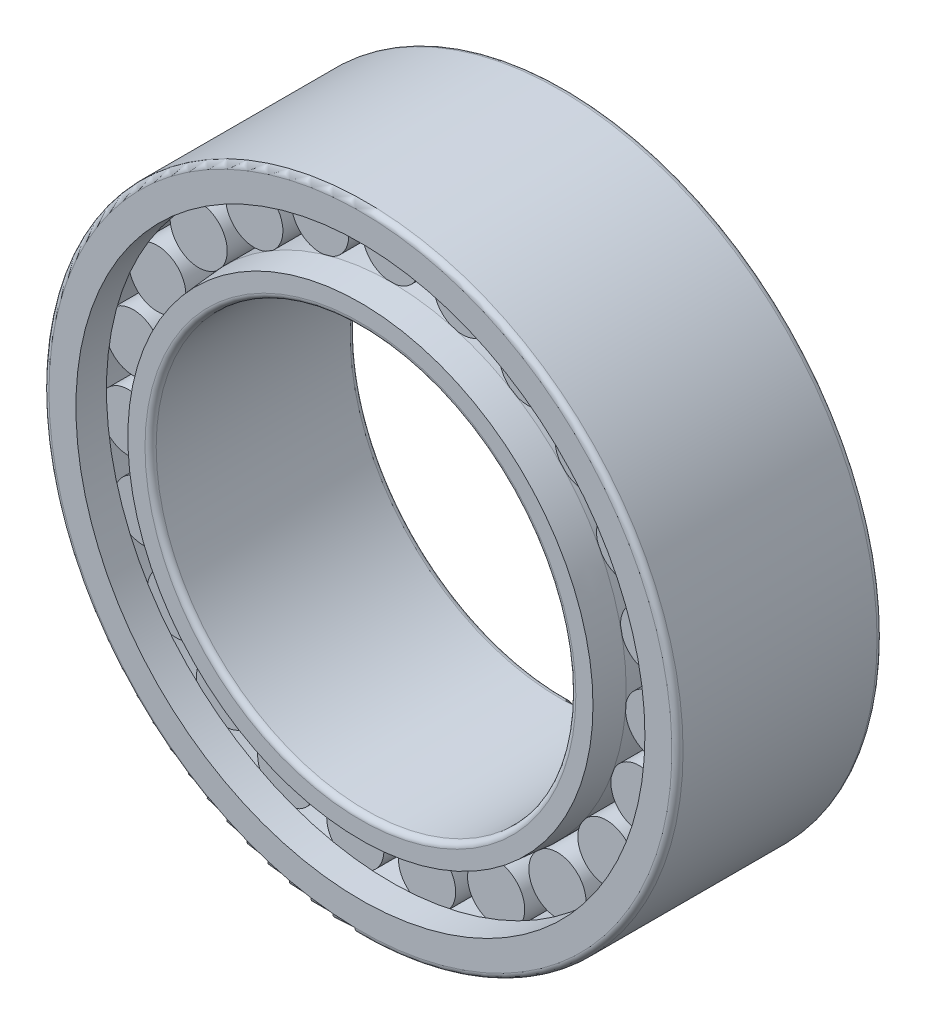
ISO-10303-21;
HEADER;
FILE_DESCRIPTION(('STEP AP214'),'2;1');
FILE_NAME('part.step','',(''),(''),'','','');
FILE_SCHEMA(('AUTOMOTIVE_DESIGN { 1 0 10303 214 1 1 1 1 }'));
ENDSEC;
DATA;
#1=APPLICATION_CONTEXT('core data for automotive mechanical design processes');
#2=APPLICATION_PROTOCOL_DEFINITION('international standard','automotive_design',2000,#1);
#3=PRODUCT_CONTEXT('',#1,'mechanical');
#4=PRODUCT('Part','Part','',(#3));
#5=PRODUCT_RELATED_PRODUCT_CATEGORY('part','',(#4));
#6=PRODUCT_DEFINITION_FORMATION('','',#4);
#7=PRODUCT_DEFINITION_CONTEXT('part definition',#1,'design');
#8=PRODUCT_DEFINITION('design','',#6,#7);
#9=PRODUCT_DEFINITION_SHAPE('','',#8);
#10=(LENGTH_UNIT() NAMED_UNIT(*) SI_UNIT(.MILLI.,.METRE.));
#11=(NAMED_UNIT(*) PLANE_ANGLE_UNIT() SI_UNIT($,.RADIAN.));
#12=(NAMED_UNIT(*) SI_UNIT($,.STERADIAN.) SOLID_ANGLE_UNIT());
#13=UNCERTAINTY_MEASURE_WITH_UNIT(LENGTH_MEASURE(1.E-05),#10,'distance_accuracy_value','');
#14=(GEOMETRIC_REPRESENTATION_CONTEXT(3) GLOBAL_UNCERTAINTY_ASSIGNED_CONTEXT((#13)) GLOBAL_UNIT_ASSIGNED_CONTEXT((#10,
#11,#12)) REPRESENTATION_CONTEXT('',''));
#15=CARTESIAN_POINT('',(0.,0.,0.));
#16=DIRECTION('',(0.,0.,1.));
#17=DIRECTION('',(1.,0.,0.));
#18=AXIS2_PLACEMENT_3D('',#15,#16,#17);
#19=CARTESIAN_POINT('',(0.,22.5,11.));
#20=DIRECTION('',(0.,0.,-1.));
#21=DIRECTION('',(-1.,0.,0.));
#22=AXIS2_PLACEMENT_3D('',#19,#20,#21);
#23=PLANE('',#22);
#24=CARTESIAN_POINT('',(0.,0.,11.));
#25=DIRECTION('',(0.,0.,-1.));
#26=DIRECTION('',(-1.,0.,0.));
#27=AXIS2_PLACEMENT_3D('',#24,#25,#26);
#28=CIRCLE('',#27,23.1);
#29=CARTESIAN_POINT('',(-23.1,0.,11.));
#30=VERTEX_POINT('',#29);
#31=EDGE_CURVE('E886',#30,#30,#28,.T.);
#32=ORIENTED_EDGE('',*,*,#31,.T.);
#33=EDGE_LOOP('',(#32));
#34=FACE_BOUND('',#33,.T.);
#35=CARTESIAN_POINT('',(0.,0.,11.));
#36=DIRECTION('',(0.,0.,1.));
#37=DIRECTION('',(1.,0.,0.));
#38=AXIS2_PLACEMENT_3D('',#35,#36,#37);
#39=CIRCLE('',#38,24.938807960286);
#40=CARTESIAN_POINT('',(24.938807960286,0.,11.));
#41=VERTEX_POINT('',#40);
#42=EDGE_CURVE('E957',#41,#41,#39,.T.);
#43=ORIENTED_EDGE('',*,*,#42,.T.);
#44=EDGE_LOOP('',(#43));
#45=FACE_BOUND('',#44,.T.);
#46=ADVANCED_FACE('F35',(#34,#45),#23,.F.);
#47=CARTESIAN_POINT('',(0.,22.5,-11.));
#48=DIRECTION('',(0.,0.,1.));
#49=DIRECTION('',(1.,0.,0.));
#50=AXIS2_PLACEMENT_3D('',#47,#48,#49);
#51=PLANE('',#50);
#52=CARTESIAN_POINT('',(0.,0.,-11.));
#53=DIRECTION('',(0.,0.,1.));
#54=DIRECTION('',(1.,0.,0.));
#55=AXIS2_PLACEMENT_3D('',#52,#53,#54);
#56=CIRCLE('',#55,23.1);
#57=CARTESIAN_POINT('',(23.1,0.,-11.));
#58=VERTEX_POINT('',#57);
#59=EDGE_CURVE('E895',#58,#58,#56,.T.);
#60=ORIENTED_EDGE('',*,*,#59,.T.);
#61=EDGE_LOOP('',(#60));
#62=FACE_BOUND('',#61,.T.);
#63=CARTESIAN_POINT('',(0.,0.,-11.));
#64=DIRECTION('',(0.,0.,1.));
#65=DIRECTION('',(1.,0.,0.));
#66=AXIS2_PLACEMENT_3D('',#63,#64,#65);
#67=CIRCLE('',#66,24.938807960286);
#68=CARTESIAN_POINT('',(24.938807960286,0.,-11.));
#69=VERTEX_POINT('',#68);
#70=EDGE_CURVE('E951',#69,#69,#67,.T.);
#71=ORIENTED_EDGE('',*,*,#70,.F.);
#72=EDGE_LOOP('',(#71));
#73=FACE_BOUND('',#72,.T.);
#74=ADVANCED_FACE('F1453',(#62,#73),#51,.F.);
#75=CARTESIAN_POINT('',(0.,25.1833333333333,7.69999999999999));
#76=DIRECTION('',(0.,0.,1.));
#77=DIRECTION('',(0.,-1.,0.));
#78=AXIS2_PLACEMENT_3D('',#75,#76,#77);
#79=PLANE('',#78);
#80=CARTESIAN_POINT('',(0.,28.25,7.69999999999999));
#81=DIRECTION('',(0.,0.,1.));
#82=DIRECTION('',(0.,-1.,0.));
#83=AXIS2_PLACEMENT_3D('',#80,#81,#82);
#84=CIRCLE('',#83,3.06666666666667);
#85=CARTESIAN_POINT('',(-0.532172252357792,31.2701385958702,7.69999999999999));
#86=VERTEX_POINT('',#85);
#87=CARTESIAN_POINT('',(-0.477936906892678,25.2208052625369,7.69999999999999));
#88=VERTEX_POINT('',#87);
#89=EDGE_CURVE('E914',#86,#88,#84,.T.);
#90=ORIENTED_EDGE('',*,*,#89,.T.);
#91=CARTESIAN_POINT('',(0.,0.,7.69999999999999));
#92=DIRECTION('',(0.,0.,1.));
#93=DIRECTION('',(0.,-1.,0.));
#94=AXIS2_PLACEMENT_3D('',#91,#92,#93);
#95=CIRCLE('',#94,25.2253333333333);
#96=CARTESIAN_POINT('',(0.477936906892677,25.2208052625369,7.69999999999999));
#97=VERTEX_POINT('',#96);
#98=EDGE_CURVE('E942',#88,#97,#95,.F.);
#99=ORIENTED_EDGE('',*,*,#98,.T.);
#100=CARTESIAN_POINT('',(0.532172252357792,31.2701385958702,7.69999999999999));
#101=VERTEX_POINT('',#100);
#102=EDGE_CURVE('E917',#97,#101,#84,.T.);
#103=ORIENTED_EDGE('',*,*,#102,.T.);
#104=CARTESIAN_POINT('',(0.,0.,7.69999999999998));
#105=DIRECTION('',(0.,0.,1.));
#106=DIRECTION('',(0.,-1.,0.));
#107=AXIS2_PLACEMENT_3D('',#104,#105,#106);
#108=CIRCLE('',#107,31.2746666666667);
#109=EDGE_CURVE('E918',#101,#86,#108,.T.);
#110=ORIENTED_EDGE('',*,*,#109,.T.);
#111=EDGE_LOOP('',(#90,#99,#103,#110));
#112=FACE_BOUND('',#111,.T.);
#113=ADVANCED_FACE('F1459',(#112),#79,.T.);
#114=CARTESIAN_POINT('',(0.,25.1833333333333,-7.70000000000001));
#115=DIRECTION('',(0.,0.,-1.));
#116=DIRECTION('',(0.,1.,0.));
#117=AXIS2_PLACEMENT_3D('',#114,#115,#116);
#118=PLANE('',#117);
#119=CARTESIAN_POINT('',(0.,28.25,-7.70000000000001));
#120=DIRECTION('',(0.,0.,1.));
#121=DIRECTION('',(0.,-1.,0.));
#122=AXIS2_PLACEMENT_3D('',#119,#120,#121);
#123=CIRCLE('',#122,3.06666666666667);
#124=CARTESIAN_POINT('',(0.477936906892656,25.2208052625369,-7.70000000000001));
#125=VERTEX_POINT('',#124);
#126=CARTESIAN_POINT('',(0.532172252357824,31.2701385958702,-7.70000000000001));
#127=VERTEX_POINT('',#126);
#128=EDGE_CURVE('E913',#125,#127,#123,.T.);
#129=ORIENTED_EDGE('',*,*,#128,.F.);
#130=CARTESIAN_POINT('',(0.,0.,-7.70000000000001));
#131=DIRECTION('',(0.,0.,-1.));
#132=DIRECTION('',(0.,1.,0.));
#133=AXIS2_PLACEMENT_3D('',#130,#131,#132);
#134=CIRCLE('',#133,25.2253333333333);
#135=CARTESIAN_POINT('',(-0.477936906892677,25.2208052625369,-7.70000000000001));
#136=VERTEX_POINT('',#135);
#137=EDGE_CURVE('E945',#125,#136,#134,.F.);
#138=ORIENTED_EDGE('',*,*,#137,.T.);
#139=CARTESIAN_POINT('',(-0.532172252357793,31.2701385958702,-7.70000000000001));
#140=VERTEX_POINT('',#139);
#141=EDGE_CURVE('E910',#140,#136,#123,.T.);
#142=ORIENTED_EDGE('',*,*,#141,.F.);
#143=CARTESIAN_POINT('',(0.,0.,-7.70000000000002));
#144=DIRECTION('',(0.,0.,-1.));
#145=DIRECTION('',(0.,1.,0.));
#146=AXIS2_PLACEMENT_3D('',#143,#144,#145);
#147=CIRCLE('',#146,31.2746666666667);
#148=EDGE_CURVE('E921',#140,#127,#147,.T.);
#149=ORIENTED_EDGE('',*,*,#148,.T.);
#150=EDGE_LOOP('',(#129,#138,#142,#149));
#151=FACE_BOUND('',#150,.T.);
#152=ADVANCED_FACE('F2618',(#151),#118,.T.);
#153=CARTESIAN_POINT('',(0.,28.25,7.69999999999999));
#154=DIRECTION('',(0.,0.,1.));
#155=DIRECTION('',(0.,-1.,0.));
#156=AXIS2_PLACEMENT_3D('',#153,#154,#155);
#157=CYLINDRICAL_SURFACE('',#156,3.06666666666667);
#158=ORIENTED_EDGE('',*,*,#102,.F.);
#159=DIRECTION('',(0.,0.,1.));
#160=VECTOR('',#159,1.);
#161=CARTESIAN_POINT('',(0.477936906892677,25.2208052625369,0.));
#162=LINE('',#161,#160);
#163=EDGE_CURVE('E898',#97,#125,#162,.F.);
#164=ORIENTED_EDGE('',*,*,#163,.T.);
#165=ORIENTED_EDGE('',*,*,#128,.T.);
#166=DIRECTION('',(0.,0.,1.));
#167=VECTOR('',#166,1.);
#168=CARTESIAN_POINT('',(0.532172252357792,31.2701385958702,0.));
#169=LINE('',#168,#167);
#170=EDGE_CURVE('E904',#127,#101,#169,.T.);
#171=ORIENTED_EDGE('',*,*,#170,.T.);
#172=EDGE_LOOP('',(#158,#164,#165,#171));
#173=FACE_BOUND('',#172,.T.);
#174=ADVANCED_FACE('F1449',(#173),#157,.T.);
#175=ORIENTED_EDGE('',*,*,#141,.T.);
#176=DIRECTION('',(0.,0.,1.));
#177=VECTOR('',#176,1.);
#178=CARTESIAN_POINT('',(-0.477936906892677,25.2208052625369,0.));
#179=LINE('',#178,#177);
#180=EDGE_CURVE('E901',#136,#88,#179,.T.);
#181=ORIENTED_EDGE('',*,*,#180,.T.);
#182=ORIENTED_EDGE('',*,*,#89,.F.);
#183=DIRECTION('',(0.,0.,1.));
#184=VECTOR('',#183,1.);
#185=CARTESIAN_POINT('',(-0.532172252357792,31.2701385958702,0.));
#186=LINE('',#185,#184);
#187=EDGE_CURVE('E907',#86,#140,#186,.F.);
#188=ORIENTED_EDGE('',*,*,#187,.T.);
#189=EDGE_LOOP('',(#175,#181,#182,#188));
#190=FACE_BOUND('',#189,.T.);
#191=ADVANCED_FACE('F1443',(#190),#157,.T.);
#192=CARTESIAN_POINT('',(0.,34.,11.));
#193=DIRECTION('',(0.,0.,-1.));
#194=DIRECTION('',(-1.,0.,0.));
#195=AXIS2_PLACEMENT_3D('',#192,#193,#194);
#196=PLANE('',#195);
#197=CARTESIAN_POINT('',(0.,0.,11.));
#198=DIRECTION('',(0.,0.,-1.));
#199=DIRECTION('',(-1.,0.,0.));
#200=AXIS2_PLACEMENT_3D('',#197,#198,#199);
#201=CIRCLE('',#200,33.4);
#202=CARTESIAN_POINT('',(-33.4,0.,11.));
#203=VERTEX_POINT('',#202);
#204=EDGE_CURVE('E874',#203,#203,#201,.F.);
#205=ORIENTED_EDGE('',*,*,#204,.T.);
#206=EDGE_LOOP('',(#205));
#207=FACE_BOUND('',#206,.T.);
#208=CARTESIAN_POINT('',(0.,0.,11.));
#209=DIRECTION('',(0.,0.,1.));
#210=DIRECTION('',(1.,0.,0.));
#211=AXIS2_PLACEMENT_3D('',#208,#209,#210);
#212=CIRCLE('',#211,30.508);
#213=CARTESIAN_POINT('',(30.508,0.,11.));
#214=VERTEX_POINT('',#213);
#215=EDGE_CURVE('E924',#214,#214,#212,.T.);
#216=ORIENTED_EDGE('',*,*,#215,.F.);
#217=EDGE_LOOP('',(#216));
#218=FACE_BOUND('',#217,.T.);
#219=ADVANCED_FACE('F1438',(#207,#218),#196,.F.);
#220=CARTESIAN_POINT('',(0.,0.,50.3916163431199));
#221=DIRECTION('',(0.,0.,1.));
#222=DIRECTION('',(1.,0.,0.));
#223=AXIS2_PLACEMENT_3D('',#220,#221,#222);
#224=CYLINDRICAL_SURFACE('',#223,30.508);
#225=CARTESIAN_POINT('',(0.,0.,7.725));
#226=DIRECTION('',(0.,0.,1.));
#227=DIRECTION('',(1.,0.,0.));
#228=AXIS2_PLACEMENT_3D('',#225,#226,#227);
#229=CIRCLE('',#228,30.508);
#230=CARTESIAN_POINT('',(30.508,0.,7.725));
#231=VERTEX_POINT('',#230);
#232=EDGE_CURVE('E927',#231,#231,#229,.T.);
#233=ORIENTED_EDGE('',*,*,#232,.F.);
#234=EDGE_LOOP('',(#233));
#235=FACE_BOUND('',#234,.T.);
#236=ORIENTED_EDGE('',*,*,#215,.T.);
#237=EDGE_LOOP('',(#236));
#238=FACE_BOUND('',#237,.T.);
#239=ADVANCED_FACE('F1432',(#235,#238),#224,.F.);
#240=CARTESIAN_POINT('',(0.,30.508,7.725));
#241=DIRECTION('',(0.,0.,1.));
#242=DIRECTION('',(1.,0.,0.));
#243=AXIS2_PLACEMENT_3D('',#240,#241,#242);
#244=PLANE('',#243);
#245=CARTESIAN_POINT('',(0.,0.,7.725));
#246=DIRECTION('',(0.,0.,1.));
#247=DIRECTION('',(1.,0.,0.));
#248=AXIS2_PLACEMENT_3D('',#245,#246,#247);
#249=CIRCLE('',#248,31.2746666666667);
#250=CARTESIAN_POINT('',(31.2746666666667,0.,7.725));
#251=VERTEX_POINT('',#250);
#252=EDGE_CURVE('E930',#251,#251,#249,.T.);
#253=ORIENTED_EDGE('',*,*,#252,.F.);
#254=EDGE_LOOP('',(#253));
#255=FACE_BOUND('',#254,.T.);
#256=ORIENTED_EDGE('',*,*,#232,.T.);
#257=EDGE_LOOP('',(#256));
#258=FACE_BOUND('',#257,.T.);
#259=ADVANCED_FACE('F1379',(#255,#258),#244,.F.);
#260=CARTESIAN_POINT('',(0.,0.,50.3916163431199));
#261=DIRECTION('',(0.,0.,1.));
#262=DIRECTION('',(1.,0.,0.));
#263=AXIS2_PLACEMENT_3D('',#260,#261,#262);
#264=CYLINDRICAL_SURFACE('',#263,31.2746666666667);
#265=CARTESIAN_POINT('',(0.,0.,-7.70000000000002));
#266=DIRECTION('',(0.,0.,-1.));
#267=DIRECTION('',(0.,1.,0.));
#268=AXIS2_PLACEMENT_3D('',#265,#266,#267);
#269=CIRCLE('',#268,31.2746666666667);
#270=CARTESIAN_POINT('',(-7.92414456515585,30.2541353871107,-7.70000000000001));
#271=VERTEX_POINT('',#270);
#272=CARTESIAN_POINT('',(-8.94902028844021,29.9669786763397,-7.70000000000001));
#273=VERTEX_POINT('',#272);
#274=EDGE_CURVE('E614',#271,#273,#269,.F.);
#275=ORIENTED_EDGE('',*,*,#274,.T.);
#276=DIRECTION('',(0.,0.,1.));
#277=VECTOR('',#276,1.);
#278=CARTESIAN_POINT('',(-8.9490202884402,29.9669786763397,0.));
#279=LINE('',#278,#277);
#280=CARTESIAN_POINT('',(-8.9490202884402,29.9669786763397,7.69999999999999));
#281=VERTEX_POINT('',#280);
#282=EDGE_CURVE('E1363',#273,#281,#279,.T.);
#283=ORIENTED_EDGE('',*,*,#282,.T.);
#284=CARTESIAN_POINT('',(0.,0.,7.69999999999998));
#285=DIRECTION('',(0.,0.,1.));
#286=DIRECTION('',(0.,-1.,0.));
#287=AXIS2_PLACEMENT_3D('',#284,#285,#286);
#288=CIRCLE('',#287,31.2746666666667);
#289=CARTESIAN_POINT('',(-7.92414456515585,30.2541353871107,7.69999999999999));
#290=VERTEX_POINT('',#289);
#291=EDGE_CURVE('E1359',#281,#290,#288,.F.);
#292=ORIENTED_EDGE('',*,*,#291,.T.);
#293=DIRECTION('',(0.,0.,1.));
#294=VECTOR('',#293,1.);
#295=CARTESIAN_POINT('',(-7.92414456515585,30.2541353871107,0.));
#296=LINE('',#295,#294);
#297=EDGE_CURVE('E616',#290,#271,#296,.F.);
#298=ORIENTED_EDGE('',*,*,#297,.T.);
#299=EDGE_LOOP('',(#275,#283,#292,#298));
#300=FACE_BOUND('',#299,.T.);
#301=CARTESIAN_POINT('',(0.,0.,-7.70000000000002));
#302=DIRECTION('',(0.,0.,-1.));
#303=DIRECTION('',(0.,1.,0.));
#304=AXIS2_PLACEMENT_3D('',#301,#302,#303);
#305=CIRCLE('',#304,31.2746666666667);
#306=CARTESIAN_POINT('',(-15.792763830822,26.994321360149,-7.70000000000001));
#307=VERTEX_POINT('',#306);
#308=CARTESIAN_POINT('',(-16.7021604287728,26.4413050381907,-7.70000000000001));
#309=VERTEX_POINT('',#308);
#310=EDGE_CURVE('E1343',#307,#309,#305,.F.);
#311=ORIENTED_EDGE('',*,*,#310,.T.);
#312=DIRECTION('',(0.,0.,1.));
#313=VECTOR('',#312,1.);
#314=CARTESIAN_POINT('',(-16.7021604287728,26.4413050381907,0.));
#315=LINE('',#314,#313);
#316=CARTESIAN_POINT('',(-16.7021604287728,26.4413050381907,7.69999999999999));
#317=VERTEX_POINT('',#316);
#318=EDGE_CURVE('E1346',#309,#317,#315,.T.);
#319=ORIENTED_EDGE('',*,*,#318,.T.);
#320=CARTESIAN_POINT('',(0.,0.,7.69999999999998));
#321=DIRECTION('',(0.,0.,1.));
#322=DIRECTION('',(0.,-1.,0.));
#323=AXIS2_PLACEMENT_3D('',#320,#321,#322);
#324=CIRCLE('',#323,31.2746666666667);
#325=CARTESIAN_POINT('',(-15.792763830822,26.994321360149,7.69999999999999));
#326=VERTEX_POINT('',#325);
#327=EDGE_CURVE('E1340',#317,#326,#324,.F.);
#328=ORIENTED_EDGE('',*,*,#327,.T.);
#329=DIRECTION('',(0.,0.,1.));
#330=VECTOR('',#329,1.);
#331=CARTESIAN_POINT('',(-15.792763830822,26.994321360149,0.));
#332=LINE('',#331,#330);
#333=EDGE_CURVE('E1349',#326,#307,#332,.F.);
#334=ORIENTED_EDGE('',*,*,#333,.T.);
#335=EDGE_LOOP('',(#311,#319,#328,#334));
#336=FACE_BOUND('',#335,.T.);
#337=CARTESIAN_POINT('',(0.,0.,-7.70000000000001));
#338=DIRECTION('',(0.,0.,-1.));
#339=DIRECTION('',(-1.,0.,0.));
#340=AXIS2_PLACEMENT_3D('',#337,#338,#339);
#341=CIRCLE('',#340,31.2746666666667);
#342=CARTESIAN_POINT('',(-22.4901060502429,21.7324620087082,-7.70000000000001));
#343=VERTEX_POINT('',#342);
#344=CARTESIAN_POINT('',(-23.2165777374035,20.9546007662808,-7.70000000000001));
#345=VERTEX_POINT('',#344);
#346=EDGE_CURVE('E1324',#343,#345,#341,.F.);
#347=ORIENTED_EDGE('',*,*,#346,.T.);
#348=DIRECTION('',(0.,0.,1.));
#349=VECTOR('',#348,1.);
#350=CARTESIAN_POINT('',(-23.2165777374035,20.9546007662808,0.));
#351=LINE('',#350,#349);
#352=CARTESIAN_POINT('',(-23.2165777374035,20.9546007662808,7.69999999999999));
#353=VERTEX_POINT('',#352);
#354=EDGE_CURVE('E1327',#345,#353,#351,.T.);
#355=ORIENTED_EDGE('',*,*,#354,.T.);
#356=CARTESIAN_POINT('',(0.,0.,7.69999999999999));
#357=DIRECTION('',(0.,0.,1.));
#358=DIRECTION('',(1.,0.,0.));
#359=AXIS2_PLACEMENT_3D('',#356,#357,#358);
#360=CIRCLE('',#359,31.2746666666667);
#361=CARTESIAN_POINT('',(-22.4901060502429,21.7324620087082,7.69999999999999));
#362=VERTEX_POINT('',#361);
#363=EDGE_CURVE('E1321',#353,#362,#360,.F.);
#364=ORIENTED_EDGE('',*,*,#363,.T.);
#365=DIRECTION('',(0.,0.,1.));
#366=VECTOR('',#365,1.);
#367=CARTESIAN_POINT('',(-22.4901060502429,21.7324620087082,0.));
#368=LINE('',#367,#366);
#369=EDGE_CURVE('E1330',#362,#343,#368,.F.);
#370=ORIENTED_EDGE('',*,*,#369,.T.);
#371=EDGE_LOOP('',(#347,#355,#364,#370));
#372=FACE_BOUND('',#371,.T.);
#373=CARTESIAN_POINT('',(0.,0.,-7.70000000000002));
#374=DIRECTION('',(0.,0.,-1.));
#375=DIRECTION('',(-1.,0.,0.));
#376=AXIS2_PLACEMENT_3D('',#373,#374,#375);
#377=CIRCLE('',#376,31.2746666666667);
#378=CARTESIAN_POINT('',(-27.5194599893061,14.8588053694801,-7.70000000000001));
#379=VERTEX_POINT('',#378);
#380=CARTESIAN_POINT('',(-28.0091276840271,13.9137896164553,-7.70000000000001));
#381=VERTEX_POINT('',#380);
#382=EDGE_CURVE('E1305',#379,#381,#377,.F.);
#383=ORIENTED_EDGE('',*,*,#382,.T.);
#384=DIRECTION('',(0.,0.,1.));
#385=VECTOR('',#384,1.);
#386=CARTESIAN_POINT('',(-28.0091276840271,13.9137896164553,0.));
#387=LINE('',#386,#385);
#388=CARTESIAN_POINT('',(-28.0091276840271,13.9137896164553,7.69999999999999));
#389=VERTEX_POINT('',#388);
#390=EDGE_CURVE('E1308',#381,#389,#387,.T.);
#391=ORIENTED_EDGE('',*,*,#390,.T.);
#392=CARTESIAN_POINT('',(0.,0.,7.69999999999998));
#393=DIRECTION('',(0.,0.,1.));
#394=DIRECTION('',(1.,0.,0.));
#395=AXIS2_PLACEMENT_3D('',#392,#393,#394);
#396=CIRCLE('',#395,31.2746666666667);
#397=CARTESIAN_POINT('',(-27.5194599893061,14.8588053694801,7.69999999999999));
#398=VERTEX_POINT('',#397);
#399=EDGE_CURVE('E1302',#389,#398,#396,.F.);
#400=ORIENTED_EDGE('',*,*,#399,.T.);
#401=DIRECTION('',(0.,0.,1.));
#402=VECTOR('',#401,1.);
#403=CARTESIAN_POINT('',(-27.5194599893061,14.8588053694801,0.));
#404=LINE('',#403,#402);
#405=EDGE_CURVE('E1311',#398,#379,#404,.F.);
#406=ORIENTED_EDGE('',*,*,#405,.T.);
#407=EDGE_LOOP('',(#383,#391,#400,#406));
#408=FACE_BOUND('',#407,.T.);
#409=CARTESIAN_POINT('',(0.,0.,-7.70000000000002));
#410=DIRECTION('',(0.,0.,-1.));
#411=DIRECTION('',(-1.,0.,0.));
#412=AXIS2_PLACEMENT_3D('',#409,#410,#411);
#413=CIRCLE('',#412,31.2746666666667);
#414=CARTESIAN_POINT('',(-30.5078214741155,6.88313911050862,-7.70000000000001));
#415=VERTEX_POINT('',#414);
#416=CARTESIAN_POINT('',(-30.7243687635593,5.84105634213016,-7.70000000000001));
#417=VERTEX_POINT('',#416);
#418=EDGE_CURVE('E1286',#415,#417,#413,.F.);
#419=ORIENTED_EDGE('',*,*,#418,.T.);
#420=DIRECTION('',(0.,0.,1.));
#421=VECTOR('',#420,1.);
#422=CARTESIAN_POINT('',(-30.7243687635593,5.84105634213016,0.));
#423=LINE('',#422,#421);
#424=CARTESIAN_POINT('',(-30.7243687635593,5.84105634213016,7.69999999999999));
#425=VERTEX_POINT('',#424);
#426=EDGE_CURVE('E1289',#417,#425,#423,.T.);
#427=ORIENTED_EDGE('',*,*,#426,.T.);
#428=CARTESIAN_POINT('',(0.,0.,7.69999999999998));
#429=DIRECTION('',(0.,0.,1.));
#430=DIRECTION('',(1.,0.,0.));
#431=AXIS2_PLACEMENT_3D('',#428,#429,#430);
#432=CIRCLE('',#431,31.2746666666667);
#433=CARTESIAN_POINT('',(-30.5078214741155,6.88313911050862,7.69999999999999));
#434=VERTEX_POINT('',#433);
#435=EDGE_CURVE('E1283',#425,#434,#432,.F.);
#436=ORIENTED_EDGE('',*,*,#435,.T.);
#437=DIRECTION('',(0.,0.,1.));
#438=VECTOR('',#437,1.);
#439=CARTESIAN_POINT('',(-30.5078214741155,6.88313911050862,0.));
#440=LINE('',#439,#438);
#441=EDGE_CURVE('E1292',#434,#415,#440,.F.);
#442=ORIENTED_EDGE('',*,*,#441,.T.);
#443=EDGE_LOOP('',(#419,#427,#436,#442));
#444=FACE_BOUND('',#443,.T.);
#445=CARTESIAN_POINT('',(0.,0.,-7.70000000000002));
#446=DIRECTION('',(0.,0.,-1.));
#447=DIRECTION('',(-1.,0.,0.));
#448=AXIS2_PLACEMENT_3D('',#445,#446,#447);
#449=CIRCLE('',#448,31.2746666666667);
#450=CARTESIAN_POINT('',(-31.233557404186,-1.60301808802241,-7.70000000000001));
#451=VERTEX_POINT('',#450);
#452=CARTESIAN_POINT('',(-31.1609239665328,-2.6648813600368,-7.70000000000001));
#453=VERTEX_POINT('',#452);
#454=EDGE_CURVE('E1267',#451,#453,#449,.F.);
#455=ORIENTED_EDGE('',*,*,#454,.T.);
#456=DIRECTION('',(0.,0.,1.));
#457=VECTOR('',#456,1.);
#458=CARTESIAN_POINT('',(-31.1609239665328,-2.6648813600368,0.));
#459=LINE('',#458,#457);
#460=CARTESIAN_POINT('',(-31.1609239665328,-2.6648813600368,7.69999999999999));
#461=VERTEX_POINT('',#460);
#462=EDGE_CURVE('E1270',#453,#461,#459,.T.);
#463=ORIENTED_EDGE('',*,*,#462,.T.);
#464=CARTESIAN_POINT('',(0.,0.,7.69999999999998));
#465=DIRECTION('',(0.,0.,1.));
#466=DIRECTION('',(1.,0.,0.));
#467=AXIS2_PLACEMENT_3D('',#464,#465,#466);
#468=CIRCLE('',#467,31.2746666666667);
#469=CARTESIAN_POINT('',(-31.233557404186,-1.60301808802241,7.69999999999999));
#470=VERTEX_POINT('',#469);
#471=EDGE_CURVE('E1264',#461,#470,#468,.F.);
#472=ORIENTED_EDGE('',*,*,#471,.T.);
#473=DIRECTION('',(0.,0.,1.));
#474=VECTOR('',#473,1.);
#475=CARTESIAN_POINT('',(-31.233557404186,-1.60301808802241,0.));
#476=LINE('',#475,#474);
#477=EDGE_CURVE('E1273',#470,#451,#476,.F.);
#478=ORIENTED_EDGE('',*,*,#477,.T.);
#479=EDGE_LOOP('',(#455,#463,#472,#478));
#480=FACE_BOUND('',#479,.T.);
#481=CARTESIAN_POINT('',(0.,0.,-7.70000000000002));
#482=DIRECTION('',(0.,0.,-1.));
#483=DIRECTION('',(-1.,0.,0.));
#484=AXIS2_PLACEMENT_3D('',#481,#482,#483);
#485=CIRCLE('',#484,31.2746666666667);
#486=CARTESIAN_POINT('',(-29.6428432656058,-9.97028676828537,-7.70000000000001));
#487=VERTEX_POINT('',#486);
#488=CARTESIAN_POINT('',(-29.2864159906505,-10.9731770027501,-7.70000000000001));
#489=VERTEX_POINT('',#488);
#490=EDGE_CURVE('E1248',#487,#489,#485,.F.);
#491=ORIENTED_EDGE('',*,*,#490,.T.);
#492=DIRECTION('',(0.,0.,1.));
#493=VECTOR('',#492,1.);
#494=CARTESIAN_POINT('',(-29.2864159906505,-10.9731770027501,0.));
#495=LINE('',#494,#493);
#496=CARTESIAN_POINT('',(-29.2864159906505,-10.9731770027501,7.69999999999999));
#497=VERTEX_POINT('',#496);
#498=EDGE_CURVE('E1251',#489,#497,#495,.T.);
#499=ORIENTED_EDGE('',*,*,#498,.T.);
#500=CARTESIAN_POINT('',(0.,0.,7.69999999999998));
#501=DIRECTION('',(0.,0.,1.));
#502=DIRECTION('',(1.,0.,0.));
#503=AXIS2_PLACEMENT_3D('',#500,#501,#502);
#504=CIRCLE('',#503,31.2746666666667);
#505=CARTESIAN_POINT('',(-29.6428432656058,-9.97028676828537,7.69999999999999));
#506=VERTEX_POINT('',#505);
#507=EDGE_CURVE('E1245',#497,#506,#504,.F.);
#508=ORIENTED_EDGE('',*,*,#507,.T.);
#509=DIRECTION('',(0.,0.,1.));
#510=VECTOR('',#509,1.);
#511=CARTESIAN_POINT('',(-29.6428432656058,-9.97028676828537,0.));
#512=LINE('',#511,#510);
#513=EDGE_CURVE('E1254',#506,#487,#512,.F.);
#514=ORIENTED_EDGE('',*,*,#513,.T.);
#515=EDGE_LOOP('',(#491,#499,#508,#514));
#516=FACE_BOUND('',#515,.T.);
#517=CARTESIAN_POINT('',(0.,0.,-7.70000000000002));
#518=DIRECTION('',(0.,0.,-1.));
#519=DIRECTION('',(-1.,0.,0.));
#520=AXIS2_PLACEMENT_3D('',#517,#518,#519);
#521=CIRCLE('',#520,31.2746666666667);
#522=CARTESIAN_POINT('',(-25.8536550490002,-17.5981048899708,-7.70000000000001));
#523=VERTEX_POINT('',#522);
#524=CARTESIAN_POINT('',(-25.2398685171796,-18.4676423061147,-7.70000000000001));
#525=VERTEX_POINT('',#524);
#526=EDGE_CURVE('E1229',#523,#525,#521,.F.);
#527=ORIENTED_EDGE('',*,*,#526,.T.);
#528=DIRECTION('',(0.,0.,1.));
#529=VECTOR('',#528,1.);
#530=CARTESIAN_POINT('',(-25.2398685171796,-18.4676423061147,0.));
#531=LINE('',#530,#529);
#532=CARTESIAN_POINT('',(-25.2398685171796,-18.4676423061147,7.69999999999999));
#533=VERTEX_POINT('',#532);
#534=EDGE_CURVE('E1232',#525,#533,#531,.T.);
#535=ORIENTED_EDGE('',*,*,#534,.T.);
#536=CARTESIAN_POINT('',(0.,0.,7.69999999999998));
#537=DIRECTION('',(0.,0.,1.));
#538=DIRECTION('',(1.,0.,0.));
#539=AXIS2_PLACEMENT_3D('',#536,#537,#538);
#540=CIRCLE('',#539,31.2746666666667);
#541=CARTESIAN_POINT('',(-25.8536550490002,-17.5981048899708,7.69999999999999));
#542=VERTEX_POINT('',#541);
#543=EDGE_CURVE('E1226',#533,#542,#540,.F.);
#544=ORIENTED_EDGE('',*,*,#543,.T.);
#545=DIRECTION('',(0.,0.,1.));
#546=VECTOR('',#545,1.);
#547=CARTESIAN_POINT('',(-25.8536550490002,-17.5981048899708,0.));
#548=LINE('',#547,#546);
#549=EDGE_CURVE('E1235',#542,#523,#548,.F.);
#550=ORIENTED_EDGE('',*,*,#549,.T.);
#551=EDGE_LOOP('',(#527,#535,#544,#550));
#552=FACE_BOUND('',#551,.T.);
#553=CARTESIAN_POINT('',(0.,0.,-7.70000000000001));
#554=DIRECTION('',(0.,0.,-1.));
#555=DIRECTION('',(0.,1.,0.));
#556=AXIS2_PLACEMENT_3D('',#553,#554,#555);
#557=CIRCLE('',#556,31.2746666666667);
#558=CARTESIAN_POINT('',(-20.1470195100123,-23.9207520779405,-7.70000000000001));
#559=VERTEX_POINT('',#558);
#560=CARTESIAN_POINT('',(-19.3213954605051,-24.5924470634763,-7.70000000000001));
#561=VERTEX_POINT('',#560);
#562=EDGE_CURVE('E1210',#559,#561,#557,.F.);
#563=ORIENTED_EDGE('',*,*,#562,.T.);
#564=DIRECTION('',(0.,0.,1.));
#565=VECTOR('',#564,1.);
#566=CARTESIAN_POINT('',(-19.3213954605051,-24.5924470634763,0.));
#567=LINE('',#566,#565);
#568=CARTESIAN_POINT('',(-19.3213954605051,-24.5924470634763,7.69999999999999));
#569=VERTEX_POINT('',#568);
#570=EDGE_CURVE('E1213',#561,#569,#567,.T.);
#571=ORIENTED_EDGE('',*,*,#570,.T.);
#572=CARTESIAN_POINT('',(0.,0.,7.69999999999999));
#573=DIRECTION('',(0.,0.,1.));
#574=DIRECTION('',(0.,-1.,0.));
#575=AXIS2_PLACEMENT_3D('',#572,#573,#574);
#576=CIRCLE('',#575,31.2746666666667);
#577=CARTESIAN_POINT('',(-20.1470195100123,-23.9207520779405,7.69999999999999));
#578=VERTEX_POINT('',#577);
#579=EDGE_CURVE('E1207',#569,#578,#576,.F.);
#580=ORIENTED_EDGE('',*,*,#579,.T.);
#581=DIRECTION('',(0.,0.,1.));
#582=VECTOR('',#581,1.);
#583=CARTESIAN_POINT('',(-20.1470195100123,-23.9207520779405,0.));
#584=LINE('',#583,#582);
#585=EDGE_CURVE('E1216',#578,#559,#584,.F.);
#586=ORIENTED_EDGE('',*,*,#585,.T.);
#587=EDGE_LOOP('',(#563,#571,#580,#586));
#588=FACE_BOUND('',#587,.T.);
#589=CARTESIAN_POINT('',(0.,0.,-7.70000000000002));
#590=DIRECTION('',(0.,0.,-1.));
#591=DIRECTION('',(0.,1.,0.));
#592=AXIS2_PLACEMENT_3D('',#589,#590,#591);
#593=CIRCLE('',#592,31.2746666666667);
#594=CARTESIAN_POINT('',(-12.9461717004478,-28.4693065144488,-7.70000000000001));
#595=VERTEX_POINT('',#594);
#596=CARTESIAN_POINT('',(-11.9699428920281,-28.8933425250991,-7.70000000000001));
#597=VERTEX_POINT('',#596);
#598=EDGE_CURVE('E1191',#595,#597,#593,.F.);
#599=ORIENTED_EDGE('',*,*,#598,.T.);
#600=DIRECTION('',(0.,0.,1.));
#601=VECTOR('',#600,1.);
#602=CARTESIAN_POINT('',(-11.9699428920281,-28.8933425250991,0.));
#603=LINE('',#602,#601);
#604=CARTESIAN_POINT('',(-11.9699428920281,-28.8933425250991,7.69999999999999));
#605=VERTEX_POINT('',#604);
#606=EDGE_CURVE('E1194',#597,#605,#603,.T.);
#607=ORIENTED_EDGE('',*,*,#606,.T.);
#608=CARTESIAN_POINT('',(0.,0.,7.69999999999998));
#609=DIRECTION('',(0.,0.,1.));
#610=DIRECTION('',(0.,-1.,0.));
#611=AXIS2_PLACEMENT_3D('',#608,#609,#610);
#612=CIRCLE('',#611,31.2746666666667);
#613=CARTESIAN_POINT('',(-12.9461717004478,-28.4693065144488,7.69999999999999));
#614=VERTEX_POINT('',#613);
#615=EDGE_CURVE('E1188',#605,#614,#612,.F.);
#616=ORIENTED_EDGE('',*,*,#615,.T.);
#617=DIRECTION('',(0.,0.,1.));
#618=VECTOR('',#617,1.);
#619=CARTESIAN_POINT('',(-12.9461717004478,-28.4693065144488,0.));
#620=LINE('',#619,#618);
#621=EDGE_CURVE('E1197',#614,#595,#620,.F.);
#622=ORIENTED_EDGE('',*,*,#621,.T.);
#623=EDGE_LOOP('',(#599,#607,#616,#622));
#624=FACE_BOUND('',#623,.T.);
#625=CARTESIAN_POINT('',(0.,0.,-7.70000000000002));
#626=DIRECTION('',(0.,0.,-1.));
#627=DIRECTION('',(0.,1.,0.));
#628=AXIS2_PLACEMENT_3D('',#625,#626,#627);
#629=CIRCLE('',#628,31.2746666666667);
#630=CARTESIAN_POINT('',(-4.78516556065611,-30.9064227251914,-7.70000000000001));
#631=VERTEX_POINT('',#630);
#632=CARTESIAN_POINT('',(-3.73073441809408,-31.0513509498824,-7.70000000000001));
#633=VERTEX_POINT('',#632);
#634=EDGE_CURVE('E1172',#631,#633,#629,.F.);
#635=ORIENTED_EDGE('',*,*,#634,.T.);
#636=DIRECTION('',(0.,0.,1.));
#637=VECTOR('',#636,1.);
#638=CARTESIAN_POINT('',(-3.73073441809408,-31.0513509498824,0.));
#639=LINE('',#638,#637);
#640=CARTESIAN_POINT('',(-3.73073441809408,-31.0513509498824,7.69999999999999));
#641=VERTEX_POINT('',#640);
#642=EDGE_CURVE('E1175',#633,#641,#639,.T.);
#643=ORIENTED_EDGE('',*,*,#642,.T.);
#644=CARTESIAN_POINT('',(0.,0.,7.69999999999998));
#645=DIRECTION('',(0.,0.,1.));
#646=DIRECTION('',(0.,-1.,0.));
#647=AXIS2_PLACEMENT_3D('',#644,#645,#646);
#648=CIRCLE('',#647,31.2746666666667);
#649=CARTESIAN_POINT('',(-4.78516556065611,-30.9064227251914,7.69999999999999));
#650=VERTEX_POINT('',#649);
#651=EDGE_CURVE('E1169',#641,#650,#648,.F.);
#652=ORIENTED_EDGE('',*,*,#651,.T.);
#653=DIRECTION('',(0.,0.,1.));
#654=VECTOR('',#653,1.);
#655=CARTESIAN_POINT('',(-4.78516556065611,-30.9064227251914,0.));
#656=LINE('',#655,#654);
#657=EDGE_CURVE('E1178',#650,#631,#656,.F.);
#658=ORIENTED_EDGE('',*,*,#657,.T.);
#659=EDGE_LOOP('',(#635,#643,#652,#658));
#660=FACE_BOUND('',#659,.T.);
#661=CARTESIAN_POINT('',(0.,0.,-7.70000000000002));
#662=DIRECTION('',(0.,0.,-1.));
#663=DIRECTION('',(0.,1.,0.));
#664=AXIS2_PLACEMENT_3D('',#661,#662,#663);
#665=CIRCLE('',#664,31.2746666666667);
#666=CARTESIAN_POINT('',(3.73073441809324,-31.0513509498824,-7.70000000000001));
#667=VERTEX_POINT('',#666);
#668=CARTESIAN_POINT('',(4.78516556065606,-30.9064227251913,-7.70000000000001));
#669=VERTEX_POINT('',#668);
#670=EDGE_CURVE('E1153',#667,#669,#665,.F.);
#671=ORIENTED_EDGE('',*,*,#670,.T.);
#672=DIRECTION('',(0.,0.,1.));
#673=VECTOR('',#672,1.);
#674=CARTESIAN_POINT('',(4.78516556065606,-30.9064227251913,0.));
#675=LINE('',#674,#673);
#676=CARTESIAN_POINT('',(4.78516556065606,-30.9064227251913,7.69999999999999));
#677=VERTEX_POINT('',#676);
#678=EDGE_CURVE('E1156',#669,#677,#675,.T.);
#679=ORIENTED_EDGE('',*,*,#678,.T.);
#680=CARTESIAN_POINT('',(0.,0.,7.69999999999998));
#681=DIRECTION('',(0.,0.,1.));
#682=DIRECTION('',(0.,-1.,0.));
#683=AXIS2_PLACEMENT_3D('',#680,#681,#682);
#684=CIRCLE('',#683,31.2746666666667);
#685=CARTESIAN_POINT('',(3.73073441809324,-31.0513509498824,7.69999999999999));
#686=VERTEX_POINT('',#685);
#687=EDGE_CURVE('E1150',#677,#686,#684,.F.);
#688=ORIENTED_EDGE('',*,*,#687,.T.);
#689=DIRECTION('',(0.,0.,1.));
#690=VECTOR('',#689,1.);
#691=CARTESIAN_POINT('',(3.73073441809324,-31.0513509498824,0.));
#692=LINE('',#691,#690);
#693=EDGE_CURVE('E1159',#686,#667,#692,.F.);
#694=ORIENTED_EDGE('',*,*,#693,.T.);
#695=EDGE_LOOP('',(#671,#679,#688,#694));
#696=FACE_BOUND('',#695,.T.);
#697=CARTESIAN_POINT('',(0.,0.,-7.70000000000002));
#698=DIRECTION('',(0.,0.,-1.));
#699=DIRECTION('',(0.,1.,0.));
#700=AXIS2_PLACEMENT_3D('',#697,#698,#699);
#701=CIRCLE('',#700,31.2746666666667);
#702=CARTESIAN_POINT('',(11.9699428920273,-28.8933425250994,-7.70000000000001));
#703=VERTEX_POINT('',#702);
#704=CARTESIAN_POINT('',(12.9461717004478,-28.4693065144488,-7.70000000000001));
#705=VERTEX_POINT('',#704);
#706=EDGE_CURVE('E1134',#703,#705,#701,.F.);
#707=ORIENTED_EDGE('',*,*,#706,.T.);
#708=DIRECTION('',(0.,0.,1.));
#709=VECTOR('',#708,1.);
#710=CARTESIAN_POINT('',(12.9461717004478,-28.4693065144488,0.));
#711=LINE('',#710,#709);
#712=CARTESIAN_POINT('',(12.9461717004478,-28.4693065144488,7.69999999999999));
#713=VERTEX_POINT('',#712);
#714=EDGE_CURVE('E1137',#705,#713,#711,.T.);
#715=ORIENTED_EDGE('',*,*,#714,.T.);
#716=CARTESIAN_POINT('',(0.,0.,7.69999999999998));
#717=DIRECTION('',(0.,0.,1.));
#718=DIRECTION('',(0.,-1.,0.));
#719=AXIS2_PLACEMENT_3D('',#716,#717,#718);
#720=CIRCLE('',#719,31.2746666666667);
#721=CARTESIAN_POINT('',(11.9699428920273,-28.8933425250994,7.69999999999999));
#722=VERTEX_POINT('',#721);
#723=EDGE_CURVE('E1131',#713,#722,#720,.F.);
#724=ORIENTED_EDGE('',*,*,#723,.T.);
#725=DIRECTION('',(0.,0.,1.));
#726=VECTOR('',#725,1.);
#727=CARTESIAN_POINT('',(11.9699428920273,-28.8933425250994,0.));
#728=LINE('',#727,#726);
#729=EDGE_CURVE('E1140',#722,#703,#728,.F.);
#730=ORIENTED_EDGE('',*,*,#729,.T.);
#731=EDGE_LOOP('',(#707,#715,#724,#730));
#732=FACE_BOUND('',#731,.T.);
#733=CARTESIAN_POINT('',(0.,0.,-7.70000000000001));
#734=DIRECTION('',(0.,0.,-1.));
#735=DIRECTION('',(0.,1.,0.));
#736=AXIS2_PLACEMENT_3D('',#733,#734,#735);
#737=CIRCLE('',#736,31.2746666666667);
#738=CARTESIAN_POINT('',(19.3213954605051,-24.5924470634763,-7.70000000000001));
#739=VERTEX_POINT('',#738);
#740=CARTESIAN_POINT('',(20.1470195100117,-23.9207520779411,-7.70000000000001));
#741=VERTEX_POINT('',#740);
#742=EDGE_CURVE('E1115',#739,#741,#737,.F.);
#743=ORIENTED_EDGE('',*,*,#742,.T.);
#744=DIRECTION('',(0.,0.,1.));
#745=VECTOR('',#744,1.);
#746=CARTESIAN_POINT('',(20.1470195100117,-23.9207520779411,0.));
#747=LINE('',#746,#745);
#748=CARTESIAN_POINT('',(20.1470195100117,-23.9207520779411,7.69999999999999));
#749=VERTEX_POINT('',#748);
#750=EDGE_CURVE('E1118',#741,#749,#747,.T.);
#751=ORIENTED_EDGE('',*,*,#750,.T.);
#752=CARTESIAN_POINT('',(0.,0.,7.69999999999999));
#753=DIRECTION('',(0.,0.,1.));
#754=DIRECTION('',(0.,-1.,0.));
#755=AXIS2_PLACEMENT_3D('',#752,#753,#754);
#756=CIRCLE('',#755,31.2746666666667);
#757=CARTESIAN_POINT('',(19.3213954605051,-24.5924470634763,7.69999999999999));
#758=VERTEX_POINT('',#757);
#759=EDGE_CURVE('E1112',#749,#758,#756,.F.);
#760=ORIENTED_EDGE('',*,*,#759,.T.);
#761=DIRECTION('',(0.,0.,1.));
#762=VECTOR('',#761,1.);
#763=CARTESIAN_POINT('',(19.3213954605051,-24.5924470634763,0.));
#764=LINE('',#763,#762);
#765=EDGE_CURVE('E1121',#758,#739,#764,.F.);
#766=ORIENTED_EDGE('',*,*,#765,.T.);
#767=EDGE_LOOP('',(#743,#751,#760,#766));
#768=FACE_BOUND('',#767,.T.);
#769=CARTESIAN_POINT('',(0.,0.,-7.70000000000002));
#770=DIRECTION('',(0.,0.,-1.));
#771=DIRECTION('',(-1.,0.,0.));
#772=AXIS2_PLACEMENT_3D('',#769,#770,#771);
#773=CIRCLE('',#772,31.2746666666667);
#774=CARTESIAN_POINT('',(25.2398685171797,-18.4676423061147,-7.70000000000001));
#775=VERTEX_POINT('',#774);
#776=CARTESIAN_POINT('',(25.8536550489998,-17.5981048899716,-7.70000000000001));
#777=VERTEX_POINT('',#776);
#778=EDGE_CURVE('E1096',#775,#777,#773,.F.);
#779=ORIENTED_EDGE('',*,*,#778,.T.);
#780=DIRECTION('',(0.,0.,1.));
#781=VECTOR('',#780,1.);
#782=CARTESIAN_POINT('',(25.8536550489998,-17.5981048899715,0.));
#783=LINE('',#782,#781);
#784=CARTESIAN_POINT('',(25.8536550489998,-17.5981048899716,7.69999999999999));
#785=VERTEX_POINT('',#784);
#786=EDGE_CURVE('E1099',#777,#785,#783,.T.);
#787=ORIENTED_EDGE('',*,*,#786,.T.);
#788=CARTESIAN_POINT('',(0.,0.,7.69999999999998));
#789=DIRECTION('',(0.,0.,1.));
#790=DIRECTION('',(1.,0.,0.));
#791=AXIS2_PLACEMENT_3D('',#788,#789,#790);
#792=CIRCLE('',#791,31.2746666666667);
#793=CARTESIAN_POINT('',(25.2398685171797,-18.4676423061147,7.69999999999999));
#794=VERTEX_POINT('',#793);
#795=EDGE_CURVE('E1093',#785,#794,#792,.F.);
#796=ORIENTED_EDGE('',*,*,#795,.T.);
#797=DIRECTION('',(0.,0.,1.));
#798=VECTOR('',#797,1.);
#799=CARTESIAN_POINT('',(25.2398685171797,-18.4676423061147,0.));
#800=LINE('',#799,#798);
#801=EDGE_CURVE('E1102',#794,#775,#800,.F.);
#802=ORIENTED_EDGE('',*,*,#801,.T.);
#803=EDGE_LOOP('',(#779,#787,#796,#802));
#804=FACE_BOUND('',#803,.T.);
#805=CARTESIAN_POINT('',(0.,0.,-7.70000000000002));
#806=DIRECTION('',(0.,0.,-1.));
#807=DIRECTION('',(-1.,0.,0.));
#808=AXIS2_PLACEMENT_3D('',#805,#806,#807);
#809=CIRCLE('',#808,31.2746666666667);
#810=CARTESIAN_POINT('',(29.2864159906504,-10.9731770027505,-7.70000000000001));
#811=VERTEX_POINT('',#810);
#812=CARTESIAN_POINT('',(29.6428432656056,-9.97028676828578,-7.70000000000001));
#813=VERTEX_POINT('',#812);
#814=EDGE_CURVE('E1077',#811,#813,#809,.F.);
#815=ORIENTED_EDGE('',*,*,#814,.T.);
#816=DIRECTION('',(0.,0.,1.));
#817=VECTOR('',#816,1.);
#818=CARTESIAN_POINT('',(29.6428432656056,-9.97028676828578,0.));
#819=LINE('',#818,#817);
#820=CARTESIAN_POINT('',(29.6428432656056,-9.97028676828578,7.69999999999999));
#821=VERTEX_POINT('',#820);
#822=EDGE_CURVE('E1080',#813,#821,#819,.T.);
#823=ORIENTED_EDGE('',*,*,#822,.T.);
#824=CARTESIAN_POINT('',(0.,0.,7.69999999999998));
#825=DIRECTION('',(0.,0.,1.));
#826=DIRECTION('',(1.,0.,0.));
#827=AXIS2_PLACEMENT_3D('',#824,#825,#826);
#828=CIRCLE('',#827,31.2746666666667);
#829=CARTESIAN_POINT('',(29.2864159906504,-10.9731770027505,7.69999999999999));
#830=VERTEX_POINT('',#829);
#831=EDGE_CURVE('E1074',#821,#830,#828,.F.);
#832=ORIENTED_EDGE('',*,*,#831,.T.);
#833=DIRECTION('',(0.,0.,1.));
#834=VECTOR('',#833,1.);
#835=CARTESIAN_POINT('',(29.2864159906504,-10.9731770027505,0.));
#836=LINE('',#835,#834);
#837=EDGE_CURVE('E1083',#830,#811,#836,.F.);
#838=ORIENTED_EDGE('',*,*,#837,.T.);
#839=EDGE_LOOP('',(#815,#823,#832,#838));
#840=FACE_BOUND('',#839,.T.);
#841=CARTESIAN_POINT('',(0.,0.,-7.70000000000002));
#842=DIRECTION('',(0.,0.,-1.));
#843=DIRECTION('',(-1.,0.,0.));
#844=AXIS2_PLACEMENT_3D('',#841,#842,#843);
#845=CIRCLE('',#844,31.2746666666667);
#846=CARTESIAN_POINT('',(31.1609239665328,-2.66488136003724,-7.70000000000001));
#847=VERTEX_POINT('',#846);
#848=CARTESIAN_POINT('',(31.233557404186,-1.60301808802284,-7.70000000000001));
#849=VERTEX_POINT('',#848);
#850=EDGE_CURVE('E1058',#847,#849,#845,.F.);
#851=ORIENTED_EDGE('',*,*,#850,.T.);
#852=DIRECTION('',(0.,0.,1.));
#853=VECTOR('',#852,1.);
#854=CARTESIAN_POINT('',(31.233557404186,-1.60301808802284,0.));
#855=LINE('',#854,#853);
#856=CARTESIAN_POINT('',(31.233557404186,-1.60301808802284,7.69999999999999));
#857=VERTEX_POINT('',#856);
#858=EDGE_CURVE('E1061',#849,#857,#855,.T.);
#859=ORIENTED_EDGE('',*,*,#858,.T.);
#860=CARTESIAN_POINT('',(0.,0.,7.69999999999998));
#861=DIRECTION('',(0.,0.,1.));
#862=DIRECTION('',(1.,0.,0.));
#863=AXIS2_PLACEMENT_3D('',#860,#861,#862);
#864=CIRCLE('',#863,31.2746666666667);
#865=CARTESIAN_POINT('',(31.1609239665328,-2.66488136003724,7.69999999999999));
#866=VERTEX_POINT('',#865);
#867=EDGE_CURVE('E1055',#857,#866,#864,.F.);
#868=ORIENTED_EDGE('',*,*,#867,.T.);
#869=DIRECTION('',(0.,0.,1.));
#870=VECTOR('',#869,1.);
#871=CARTESIAN_POINT('',(31.1609239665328,-2.66488136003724,0.));
#872=LINE('',#871,#870);
#873=EDGE_CURVE('E1064',#866,#847,#872,.F.);
#874=ORIENTED_EDGE('',*,*,#873,.T.);
#875=EDGE_LOOP('',(#851,#859,#868,#874));
#876=FACE_BOUND('',#875,.T.);
#877=CARTESIAN_POINT('',(0.,0.,-7.70000000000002));
#878=DIRECTION('',(0.,0.,-1.));
#879=DIRECTION('',(-1.,0.,0.));
#880=AXIS2_PLACEMENT_3D('',#877,#878,#879);
#881=CIRCLE('',#880,31.2746666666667);
#882=CARTESIAN_POINT('',(30.7243687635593,5.84105634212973,-7.70000000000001));
#883=VERTEX_POINT('',#882);
#884=CARTESIAN_POINT('',(30.5078214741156,6.88313911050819,-7.70000000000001));
#885=VERTEX_POINT('',#884);
#886=EDGE_CURVE('E1039',#883,#885,#881,.F.);
#887=ORIENTED_EDGE('',*,*,#886,.T.);
#888=DIRECTION('',(0.,0.,1.));
#889=VECTOR('',#888,1.);
#890=CARTESIAN_POINT('',(30.5078214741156,6.88313911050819,0.));
#891=LINE('',#890,#889);
#892=CARTESIAN_POINT('',(30.5078214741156,6.88313911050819,7.69999999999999));
#893=VERTEX_POINT('',#892);
#894=EDGE_CURVE('E1042',#885,#893,#891,.T.);
#895=ORIENTED_EDGE('',*,*,#894,.T.);
#896=CARTESIAN_POINT('',(0.,0.,7.69999999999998));
#897=DIRECTION('',(0.,0.,1.));
#898=DIRECTION('',(1.,0.,0.));
#899=AXIS2_PLACEMENT_3D('',#896,#897,#898);
#900=CIRCLE('',#899,31.2746666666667);
#901=CARTESIAN_POINT('',(30.7243687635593,5.84105634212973,7.69999999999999));
#902=VERTEX_POINT('',#901);
#903=EDGE_CURVE('E1036',#893,#902,#900,.F.);
#904=ORIENTED_EDGE('',*,*,#903,.T.);
#905=DIRECTION('',(0.,0.,1.));
#906=VECTOR('',#905,1.);
#907=CARTESIAN_POINT('',(30.7243687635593,5.84105634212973,0.));
#908=LINE('',#907,#906);
#909=EDGE_CURVE('E1045',#902,#883,#908,.F.);
#910=ORIENTED_EDGE('',*,*,#909,.T.);
#911=EDGE_LOOP('',(#887,#895,#904,#910));
#912=FACE_BOUND('',#911,.T.);
#913=CARTESIAN_POINT('',(0.,0.,-7.70000000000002));
#914=DIRECTION('',(0.,0.,-1.));
#915=DIRECTION('',(-1.,0.,0.));
#916=AXIS2_PLACEMENT_3D('',#913,#914,#915);
#917=CIRCLE('',#916,31.2746666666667);
#918=CARTESIAN_POINT('',(28.0091276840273,13.9137896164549,-7.70000000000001));
#919=VERTEX_POINT('',#918);
#920=CARTESIAN_POINT('',(27.5194599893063,14.8588053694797,-7.70000000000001));
#921=VERTEX_POINT('',#920);
#922=EDGE_CURVE('E1020',#919,#921,#917,.F.);
#923=ORIENTED_EDGE('',*,*,#922,.T.);
#924=DIRECTION('',(0.,0.,1.));
#925=VECTOR('',#924,1.);
#926=CARTESIAN_POINT('',(27.5194599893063,14.8588053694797,0.));
#927=LINE('',#926,#925);
#928=CARTESIAN_POINT('',(27.5194599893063,14.8588053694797,7.69999999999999));
#929=VERTEX_POINT('',#928);
#930=EDGE_CURVE('E1023',#921,#929,#927,.T.);
#931=ORIENTED_EDGE('',*,*,#930,.T.);
#932=CARTESIAN_POINT('',(0.,0.,7.69999999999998));
#933=DIRECTION('',(0.,0.,1.));
#934=DIRECTION('',(1.,0.,0.));
#935=AXIS2_PLACEMENT_3D('',#932,#933,#934);
#936=CIRCLE('',#935,31.2746666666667);
#937=CARTESIAN_POINT('',(28.0091276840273,13.9137896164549,7.69999999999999));
#938=VERTEX_POINT('',#937);
#939=EDGE_CURVE('E1017',#929,#938,#936,.F.);
#940=ORIENTED_EDGE('',*,*,#939,.T.);
#941=DIRECTION('',(0.,0.,1.));
#942=VECTOR('',#941,1.);
#943=CARTESIAN_POINT('',(28.0091276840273,13.9137896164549,0.));
#944=LINE('',#943,#942);
#945=EDGE_CURVE('E1026',#938,#919,#944,.F.);
#946=ORIENTED_EDGE('',*,*,#945,.T.);
#947=EDGE_LOOP('',(#923,#931,#940,#946));
#948=FACE_BOUND('',#947,.T.);
#949=CARTESIAN_POINT('',(0.,0.,-7.70000000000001));
#950=DIRECTION('',(0.,0.,-1.));
#951=DIRECTION('',(-1.,0.,0.));
#952=AXIS2_PLACEMENT_3D('',#949,#950,#951);
#953=CIRCLE('',#952,31.2746666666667);
#954=CARTESIAN_POINT('',(23.216577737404,20.9546007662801,-7.70000000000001));
#955=VERTEX_POINT('',#954);
#956=CARTESIAN_POINT('',(22.4901060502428,21.7324620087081,-7.70000000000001));
#957=VERTEX_POINT('',#956);
#958=EDGE_CURVE('E1001',#955,#957,#953,.F.);
#959=ORIENTED_EDGE('',*,*,#958,.T.);
#960=DIRECTION('',(0.,0.,1.));
#961=VECTOR('',#960,1.);
#962=CARTESIAN_POINT('',(22.4901060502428,21.7324620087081,0.));
#963=LINE('',#962,#961);
#964=CARTESIAN_POINT('',(22.4901060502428,21.7324620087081,7.69999999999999));
#965=VERTEX_POINT('',#964);
#966=EDGE_CURVE('E1004',#957,#965,#963,.T.);
#967=ORIENTED_EDGE('',*,*,#966,.T.);
#968=CARTESIAN_POINT('',(0.,0.,7.69999999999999));
#969=DIRECTION('',(0.,0.,1.));
#970=DIRECTION('',(1.,0.,0.));
#971=AXIS2_PLACEMENT_3D('',#968,#969,#970);
#972=CIRCLE('',#971,31.2746666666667);
#973=CARTESIAN_POINT('',(23.216577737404,20.9546007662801,7.69999999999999));
#974=VERTEX_POINT('',#973);
#975=EDGE_CURVE('E998',#965,#974,#972,.F.);
#976=ORIENTED_EDGE('',*,*,#975,.T.);
#977=DIRECTION('',(0.,0.,1.));
#978=VECTOR('',#977,1.);
#979=CARTESIAN_POINT('',(23.216577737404,20.9546007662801,0.));
#980=LINE('',#979,#978);
#981=EDGE_CURVE('E1007',#974,#955,#980,.F.);
#982=ORIENTED_EDGE('',*,*,#981,.T.);
#983=EDGE_LOOP('',(#959,#967,#976,#982));
#984=FACE_BOUND('',#983,.T.);
#985=CARTESIAN_POINT('',(0.,0.,-7.70000000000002));
#986=DIRECTION('',(0.,0.,-1.));
#987=DIRECTION('',(0.,1.,0.));
#988=AXIS2_PLACEMENT_3D('',#985,#986,#987);
#989=CIRCLE('',#988,31.2746666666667);
#990=CARTESIAN_POINT('',(16.7021604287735,26.4413050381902,-7.70000000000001));
#991=VERTEX_POINT('',#990);
#992=CARTESIAN_POINT('',(15.792763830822,26.9943213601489,-7.70000000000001));
#993=VERTEX_POINT('',#992);
#994=EDGE_CURVE('E982',#991,#993,#989,.F.);
#995=ORIENTED_EDGE('',*,*,#994,.T.);
#996=DIRECTION('',(0.,0.,1.));
#997=VECTOR('',#996,1.);
#998=CARTESIAN_POINT('',(15.792763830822,26.9943213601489,0.));
#999=LINE('',#998,#997);
#1000=CARTESIAN_POINT('',(15.792763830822,26.9943213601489,7.69999999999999));
#1001=VERTEX_POINT('',#1000);
#1002=EDGE_CURVE('E985',#993,#1001,#999,.T.);
#1003=ORIENTED_EDGE('',*,*,#1002,.T.);
#1004=CARTESIAN_POINT('',(0.,0.,7.69999999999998));
#1005=DIRECTION('',(0.,0.,1.));
#1006=DIRECTION('',(0.,-1.,0.));
#1007=AXIS2_PLACEMENT_3D('',#1004,#1005,#1006);
#1008=CIRCLE('',#1007,31.2746666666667);
#1009=CARTESIAN_POINT('',(16.7021604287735,26.4413050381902,7.69999999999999));
#1010=VERTEX_POINT('',#1009);
#1011=EDGE_CURVE('E979',#1001,#1010,#1008,.F.);
#1012=ORIENTED_EDGE('',*,*,#1011,.T.);
#1013=DIRECTION('',(0.,0.,1.));
#1014=VECTOR('',#1013,1.);
#1015=CARTESIAN_POINT('',(16.7021604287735,26.4413050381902,0.));
#1016=LINE('',#1015,#1014);
#1017=EDGE_CURVE('E988',#1010,#991,#1016,.F.);
#1018=ORIENTED_EDGE('',*,*,#1017,.T.);
#1019=EDGE_LOOP('',(#995,#1003,#1012,#1018));
#1020=FACE_BOUND('',#1019,.T.);
#1021=CARTESIAN_POINT('',(0.,0.,-7.70000000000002));
#1022=DIRECTION('',(0.,0.,-1.));
#1023=DIRECTION('',(0.,1.,0.));
#1024=AXIS2_PLACEMENT_3D('',#1021,#1022,#1023);
#1025=CIRCLE('',#1024,31.2746666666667);
#1026=CARTESIAN_POINT('',(8.94902028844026,29.9669786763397,-7.70000000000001));
#1027=VERTEX_POINT('',#1026);
#1028=CARTESIAN_POINT('',(7.92414456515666,30.2541353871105,-7.70000000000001));
#1029=VERTEX_POINT('',#1028);
#1030=EDGE_CURVE('E963',#1027,#1029,#1025,.F.);
#1031=ORIENTED_EDGE('',*,*,#1030,.T.);
#1032=DIRECTION('',(0.,0.,1.));
#1033=VECTOR('',#1032,1.);
#1034=CARTESIAN_POINT('',(7.92414456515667,30.2541353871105,0.));
#1035=LINE('',#1034,#1033);
#1036=CARTESIAN_POINT('',(7.92414456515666,30.2541353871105,7.69999999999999));
#1037=VERTEX_POINT('',#1036);
#1038=EDGE_CURVE('E966',#1029,#1037,#1035,.T.);
#1039=ORIENTED_EDGE('',*,*,#1038,.T.);
#1040=CARTESIAN_POINT('',(0.,0.,7.69999999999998));
#1041=DIRECTION('',(0.,0.,1.));
#1042=DIRECTION('',(0.,-1.,0.));
#1043=AXIS2_PLACEMENT_3D('',#1040,#1041,#1042);
#1044=CIRCLE('',#1043,31.2746666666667);
#1045=CARTESIAN_POINT('',(8.94902028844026,29.9669786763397,7.69999999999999));
#1046=VERTEX_POINT('',#1045);
#1047=EDGE_CURVE('E960',#1037,#1046,#1044,.F.);
#1048=ORIENTED_EDGE('',*,*,#1047,.T.);
#1049=DIRECTION('',(0.,0.,1.));
#1050=VECTOR('',#1049,1.);
#1051=CARTESIAN_POINT('',(8.94902028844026,29.9669786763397,0.));
#1052=LINE('',#1051,#1050);
#1053=EDGE_CURVE('E969',#1046,#1027,#1052,.F.);
#1054=ORIENTED_EDGE('',*,*,#1053,.T.);
#1055=EDGE_LOOP('',(#1031,#1039,#1048,#1054));
#1056=FACE_BOUND('',#1055,.T.);
#1057=ORIENTED_EDGE('',*,*,#170,.F.);
#1058=ORIENTED_EDGE('',*,*,#148,.F.);
#1059=ORIENTED_EDGE('',*,*,#187,.F.);
#1060=ORIENTED_EDGE('',*,*,#109,.F.);
#1061=EDGE_LOOP('',(#1057,#1058,#1059,#1060));
#1062=FACE_BOUND('',#1061,.T.);
#1063=CARTESIAN_POINT('',(0.,0.,-7.725));
#1064=DIRECTION('',(0.,0.,1.));
#1065=DIRECTION('',(1.,0.,0.));
#1066=AXIS2_PLACEMENT_3D('',#1063,#1064,#1065);
#1067=CIRCLE('',#1066,31.2746666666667);
#1068=CARTESIAN_POINT('',(31.2746666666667,0.,-7.725));
#1069=VERTEX_POINT('',#1068);
#1070=EDGE_CURVE('E933',#1069,#1069,#1067,.T.);
#1071=ORIENTED_EDGE('',*,*,#1070,.F.);
#1072=EDGE_LOOP('',(#1071));
#1073=FACE_BOUND('',#1072,.T.);
#1074=ORIENTED_EDGE('',*,*,#252,.T.);
#1075=EDGE_LOOP('',(#1074));
#1076=FACE_BOUND('',#1075,.T.);
#1077=ADVANCED_FACE('F1375',(#300,#336,#372,#408,#444,#480,#516,#552,#588,#624,#660,#696,#732,
#768,#804,#840,#876,#912,#948,#984,#1020,#1056,#1062,#1073,#1076),#264,.F.);
#1078=CARTESIAN_POINT('',(0.,30.508,-7.725));
#1079=DIRECTION('',(0.,0.,-1.));
#1080=DIRECTION('',(-1.,0.,0.));
#1081=AXIS2_PLACEMENT_3D('',#1078,#1079,#1080);
#1082=PLANE('',#1081);
#1083=CARTESIAN_POINT('',(0.,0.,-7.725));
#1084=DIRECTION('',(0.,0.,1.));
#1085=DIRECTION('',(1.,0.,0.));
#1086=AXIS2_PLACEMENT_3D('',#1083,#1084,#1085);
#1087=CIRCLE('',#1086,30.508);
#1088=CARTESIAN_POINT('',(30.508,0.,-7.725));
#1089=VERTEX_POINT('',#1088);
#1090=EDGE_CURVE('E936',#1089,#1089,#1087,.T.);
#1091=ORIENTED_EDGE('',*,*,#1090,.F.);
#1092=EDGE_LOOP('',(#1091));
#1093=FACE_BOUND('',#1092,.T.);
#1094=ORIENTED_EDGE('',*,*,#1070,.T.);
#1095=EDGE_LOOP('',(#1094));
#1096=FACE_BOUND('',#1095,.T.);
#1097=ADVANCED_FACE('F1378',(#1093,#1096),#1082,.F.);
#1098=CARTESIAN_POINT('',(0.,0.,50.3916163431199));
#1099=DIRECTION('',(0.,0.,1.));
#1100=DIRECTION('',(1.,0.,0.));
#1101=AXIS2_PLACEMENT_3D('',#1098,#1099,#1100);
#1102=CYLINDRICAL_SURFACE('',#1101,30.508);
#1103=CARTESIAN_POINT('',(0.,0.,-11.));
#1104=DIRECTION('',(0.,0.,1.));
#1105=DIRECTION('',(1.,0.,0.));
#1106=AXIS2_PLACEMENT_3D('',#1103,#1104,#1105);
#1107=CIRCLE('',#1106,30.508);
#1108=CARTESIAN_POINT('',(30.508,0.,-11.));
#1109=VERTEX_POINT('',#1108);
#1110=EDGE_CURVE('E939',#1109,#1109,#1107,.T.);
#1111=ORIENTED_EDGE('',*,*,#1110,.F.);
#1112=EDGE_LOOP('',(#1111));
#1113=FACE_BOUND('',#1112,.T.);
#1114=ORIENTED_EDGE('',*,*,#1090,.T.);
#1115=EDGE_LOOP('',(#1114));
#1116=FACE_BOUND('',#1115,.T.);
#1117=ADVANCED_FACE('F1472',(#1113,#1116),#1102,.F.);
#1118=CARTESIAN_POINT('',(0.,34.,-11.));
#1119=DIRECTION('',(0.,0.,1.));
#1120=DIRECTION('',(1.,0.,0.));
#1121=AXIS2_PLACEMENT_3D('',#1118,#1119,#1120);
#1122=PLANE('',#1121);
#1123=CARTESIAN_POINT('',(0.,0.,-11.));
#1124=DIRECTION('',(0.,0.,1.));
#1125=DIRECTION('',(1.,0.,0.));
#1126=AXIS2_PLACEMENT_3D('',#1123,#1124,#1125);
#1127=CIRCLE('',#1126,33.4);
#1128=CARTESIAN_POINT('',(33.4,0.,-11.));
#1129=VERTEX_POINT('',#1128);
#1130=EDGE_CURVE('E877',#1129,#1129,#1127,.F.);
#1131=ORIENTED_EDGE('',*,*,#1130,.T.);
#1132=EDGE_LOOP('',(#1131));
#1133=FACE_BOUND('',#1132,.T.);
#1134=ORIENTED_EDGE('',*,*,#1110,.T.);
#1135=EDGE_LOOP('',(#1134));
#1136=FACE_BOUND('',#1135,.T.);
#1137=ADVANCED_FACE('F1468',(#1133,#1136),#1122,.F.);
#1138=CARTESIAN_POINT('',(0.,0.,50.3916163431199));
#1139=DIRECTION('',(0.,0.,1.));
#1140=DIRECTION('',(1.,0.,0.));
#1141=AXIS2_PLACEMENT_3D('',#1138,#1139,#1140);
#1142=CYLINDRICAL_SURFACE('',#1141,34.);
#1143=CARTESIAN_POINT('',(0.,0.,-10.4));
#1144=DIRECTION('',(0.,0.,1.));
#1145=DIRECTION('',(1.,0.,0.));
#1146=AXIS2_PLACEMENT_3D('',#1143,#1144,#1145);
#1147=CIRCLE('',#1146,34.);
#1148=CARTESIAN_POINT('',(34.,0.,-10.4));
#1149=VERTEX_POINT('',#1148);
#1150=EDGE_CURVE('E880',#1149,#1149,#1147,.T.);
#1151=ORIENTED_EDGE('',*,*,#1150,.T.);
#1152=EDGE_LOOP('',(#1151));
#1153=FACE_BOUND('',#1152,.T.);
#1154=CARTESIAN_POINT('',(0.,0.,10.4));
#1155=DIRECTION('',(0.,0.,-1.));
#1156=DIRECTION('',(-1.,0.,0.));
#1157=AXIS2_PLACEMENT_3D('',#1154,#1155,#1156);
#1158=CIRCLE('',#1157,34.);
#1159=CARTESIAN_POINT('',(-34.,0.,10.4));
#1160=VERTEX_POINT('',#1159);
#1161=EDGE_CURVE('E883',#1160,#1160,#1158,.T.);
#1162=ORIENTED_EDGE('',*,*,#1161,.T.);
#1163=EDGE_LOOP('',(#1162));
#1164=FACE_BOUND('',#1163,.T.);
#1165=ADVANCED_FACE('F1465',(#1153,#1164),#1142,.T.);
#1166=CARTESIAN_POINT('',(0.,0.,70.8625909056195));
#1167=DIRECTION('',(0.,0.,1.));
#1168=DIRECTION('',(1.,0.,0.));
#1169=AXIS2_PLACEMENT_3D('',#1166,#1167,#1168);
#1170=CYLINDRICAL_SURFACE('',#1169,25.2253333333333);
#1171=CARTESIAN_POINT('',(0.,0.,7.69999999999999));
#1172=DIRECTION('',(0.,0.,1.));
#1173=DIRECTION('',(0.,-1.,0.));
#1174=AXIS2_PLACEMENT_3D('',#1171,#1172,#1173);
#1175=CIRCLE('',#1174,25.2253333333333);
#1176=CARTESIAN_POINT('',(-6.34427811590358,24.4144952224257,7.69999999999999));
#1177=VERTEX_POINT('',#1176);
#1178=CARTESIAN_POINT('',(-7.26470553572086,24.1566035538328,7.69999999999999));
#1179=VERTEX_POINT('',#1178);
#1180=EDGE_CURVE('E43',#1177,#1179,#1175,.T.);
#1181=ORIENTED_EDGE('',*,*,#1180,.T.);
#1182=DIRECTION('',(0.,0.,1.));
#1183=VECTOR('',#1182,1.);
#1184=CARTESIAN_POINT('',(-7.26470553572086,24.1566035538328,0.));
#1185=LINE('',#1184,#1183);
#1186=CARTESIAN_POINT('',(-7.26470553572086,24.1566035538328,-7.70000000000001));
#1187=VERTEX_POINT('',#1186);
#1188=EDGE_CURVE('E11',#1179,#1187,#1185,.F.);
#1189=ORIENTED_EDGE('',*,*,#1188,.T.);
#1190=CARTESIAN_POINT('',(0.,0.,-7.70000000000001));
#1191=DIRECTION('',(0.,0.,-1.));
#1192=DIRECTION('',(0.,1.,0.));
#1193=AXIS2_PLACEMENT_3D('',#1190,#1191,#1192);
#1194=CIRCLE('',#1193,25.2253333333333);
#1195=CARTESIAN_POINT('',(-6.34427811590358,24.4144952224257,-7.70000000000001));
#1196=VERTEX_POINT('',#1195);
#1197=EDGE_CURVE('E606',#1187,#1196,#1194,.T.);
#1198=ORIENTED_EDGE('',*,*,#1197,.T.);
#1199=DIRECTION('',(0.,0.,1.));
#1200=VECTOR('',#1199,1.);
#1201=CARTESIAN_POINT('',(-6.34427811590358,24.4144952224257,0.));
#1202=LINE('',#1201,#1200);
#1203=EDGE_CURVE('E601',#1196,#1177,#1202,.T.);
#1204=ORIENTED_EDGE('',*,*,#1203,.T.);
#1205=EDGE_LOOP('',(#1181,#1189,#1198,#1204));
#1206=FACE_BOUND('',#1205,.T.);
#1207=CARTESIAN_POINT('',(0.,0.,7.69999999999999));
#1208=DIRECTION('',(0.,0.,1.));
#1209=DIRECTION('',(0.,-1.,0.));
#1210=AXIS2_PLACEMENT_3D('',#1207,#1208,#1209);
#1211=CIRCLE('',#1210,25.2253333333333);
#1212=CARTESIAN_POINT('',(-12.6959670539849,21.797473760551,7.69999999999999));
#1213=VERTEX_POINT('',#1212);
#1214=CARTESIAN_POINT('',(-13.5126841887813,21.3008170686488,7.69999999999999));
#1215=VERTEX_POINT('',#1214);
#1216=EDGE_CURVE('E625',#1213,#1215,#1211,.T.);
#1217=ORIENTED_EDGE('',*,*,#1216,.T.);
#1218=DIRECTION('',(0.,0.,1.));
#1219=VECTOR('',#1218,1.);
#1220=CARTESIAN_POINT('',(-13.5126841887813,21.3008170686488,0.));
#1221=LINE('',#1220,#1219);
#1222=CARTESIAN_POINT('',(-13.5126841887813,21.3008170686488,-7.70000000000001));
#1223=VERTEX_POINT('',#1222);
#1224=EDGE_CURVE('E607',#1215,#1223,#1221,.F.);
#1225=ORIENTED_EDGE('',*,*,#1224,.T.);
#1226=CARTESIAN_POINT('',(0.,0.,-7.70000000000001));
#1227=DIRECTION('',(0.,0.,-1.));
#1228=DIRECTION('',(0.,1.,0.));
#1229=AXIS2_PLACEMENT_3D('',#1226,#1227,#1228);
#1230=CIRCLE('',#1229,25.2253333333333);
#1231=CARTESIAN_POINT('',(-12.6959670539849,21.797473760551,-7.70000000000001));
#1232=VERTEX_POINT('',#1231);
#1233=EDGE_CURVE('E628',#1223,#1232,#1230,.T.);
#1234=ORIENTED_EDGE('',*,*,#1233,.T.);
#1235=DIRECTION('',(0.,0.,1.));
#1236=VECTOR('',#1235,1.);
#1237=CARTESIAN_POINT('',(-12.6959670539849,21.797473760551,0.));
#1238=LINE('',#1237,#1236);
#1239=EDGE_CURVE('E631',#1232,#1213,#1238,.T.);
#1240=ORIENTED_EDGE('',*,*,#1239,.T.);
#1241=EDGE_LOOP('',(#1217,#1225,#1234,#1240));
#1242=FACE_BOUND('',#1241,.T.);
#1243=CARTESIAN_POINT('',(0.,0.,7.69999999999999));
#1244=DIRECTION('',(0.,0.,1.));
#1245=DIRECTION('',(1.,0.,0.));
#1246=AXIS2_PLACEMENT_3D('',#1243,#1244,#1245);
#1247=CIRCLE('',#1246,25.2253333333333);
#1248=CARTESIAN_POINT('',(-18.1060541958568,17.5638333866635,7.69999999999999));
#1249=VERTEX_POINT('',#1248);
#1250=CARTESIAN_POINT('',(-18.7584888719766,16.8652464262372,7.69999999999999));
#1251=VERTEX_POINT('',#1250);
#1252=EDGE_CURVE('E637',#1249,#1251,#1247,.T.);
#1253=ORIENTED_EDGE('',*,*,#1252,.T.);
#1254=DIRECTION('',(0.,0.,1.));
#1255=VECTOR('',#1254,1.);
#1256=CARTESIAN_POINT('',(-18.7584888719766,16.8652464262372,0.));
#1257=LINE('',#1256,#1255);
#1258=CARTESIAN_POINT('',(-18.7584888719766,16.8652464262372,-7.70000000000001));
#1259=VERTEX_POINT('',#1258);
#1260=EDGE_CURVE('E634',#1251,#1259,#1257,.F.);
#1261=ORIENTED_EDGE('',*,*,#1260,.T.);
#1262=CARTESIAN_POINT('',(0.,0.,-7.70000000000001));
#1263=DIRECTION('',(0.,0.,-1.));
#1264=DIRECTION('',(-1.,0.,0.));
#1265=AXIS2_PLACEMENT_3D('',#1262,#1263,#1264);
#1266=CIRCLE('',#1265,25.2253333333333);
#1267=CARTESIAN_POINT('',(-18.1060541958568,17.5638333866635,-7.70000000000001));
#1268=VERTEX_POINT('',#1267);
#1269=EDGE_CURVE('E640',#1259,#1268,#1266,.T.);
#1270=ORIENTED_EDGE('',*,*,#1269,.T.);
#1271=DIRECTION('',(0.,0.,1.));
#1272=VECTOR('',#1271,1.);
#1273=CARTESIAN_POINT('',(-18.1060541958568,17.5638333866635,0.));
#1274=LINE('',#1273,#1272);
#1275=EDGE_CURVE('E643',#1268,#1249,#1274,.T.);
#1276=ORIENTED_EDGE('',*,*,#1275,.T.);
#1277=EDGE_LOOP('',(#1253,#1261,#1270,#1276));
#1278=FACE_BOUND('',#1277,.T.);
#1279=CARTESIAN_POINT('',(0.,0.,7.69999999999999));
#1280=DIRECTION('',(0.,0.,1.));
#1281=DIRECTION('',(1.,0.,0.));
#1282=AXIS2_PLACEMENT_3D('',#1279,#1280,#1281);
#1283=CIRCLE('',#1282,25.2253333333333);
#1284=CARTESIAN_POINT('',(-22.1732981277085,12.0275638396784,7.69999999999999));
#1285=VERTEX_POINT('',#1284);
#1286=CARTESIAN_POINT('',(-22.613062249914,11.1788576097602,7.69999999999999));
#1287=VERTEX_POINT('',#1286);
#1288=EDGE_CURVE('E649',#1285,#1287,#1283,.T.);
#1289=ORIENTED_EDGE('',*,*,#1288,.T.);
#1290=DIRECTION('',(0.,0.,1.));
#1291=VECTOR('',#1290,1.);
#1292=CARTESIAN_POINT('',(-22.613062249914,11.1788576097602,0.));
#1293=LINE('',#1292,#1291);
#1294=CARTESIAN_POINT('',(-22.613062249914,11.1788576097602,-7.70000000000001));
#1295=VERTEX_POINT('',#1294);
#1296=EDGE_CURVE('E646',#1287,#1295,#1293,.F.);
#1297=ORIENTED_EDGE('',*,*,#1296,.T.);
#1298=CARTESIAN_POINT('',(0.,0.,-7.70000000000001));
#1299=DIRECTION('',(0.,0.,-1.));
#1300=DIRECTION('',(-1.,0.,0.));
#1301=AXIS2_PLACEMENT_3D('',#1298,#1299,#1300);
#1302=CIRCLE('',#1301,25.2253333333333);
#1303=CARTESIAN_POINT('',(-22.1732981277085,12.0275638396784,-7.70000000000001));
#1304=VERTEX_POINT('',#1303);
#1305=EDGE_CURVE('E652',#1295,#1304,#1302,.T.);
#1306=ORIENTED_EDGE('',*,*,#1305,.T.);
#1307=DIRECTION('',(0.,0.,1.));
#1308=VECTOR('',#1307,1.);
#1309=CARTESIAN_POINT('',(-22.1732981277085,12.0275638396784,0.));
#1310=LINE('',#1309,#1308);
#1311=EDGE_CURVE('E655',#1304,#1285,#1310,.T.);
#1312=ORIENTED_EDGE('',*,*,#1311,.T.);
#1313=EDGE_LOOP('',(#1289,#1297,#1306,#1312));
#1314=FACE_BOUND('',#1313,.T.);
#1315=CARTESIAN_POINT('',(0.,0.,7.69999999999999));
#1316=DIRECTION('',(0.,0.,1.));
#1317=DIRECTION('',(1.,0.,0.));
#1318=AXIS2_PLACEMENT_3D('',#1315,#1316,#1317);
#1319=CIRCLE('',#1318,25.2253333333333);
#1320=CARTESIAN_POINT('',(-24.5960499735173,5.59926490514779,7.69999999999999));
#1321=VERTEX_POINT('',#1320);
#1322=CARTESIAN_POINT('',(-24.7905282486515,4.66338406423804,7.69999999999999));
#1323=VERTEX_POINT('',#1322);
#1324=EDGE_CURVE('E661',#1321,#1323,#1319,.T.);
#1325=ORIENTED_EDGE('',*,*,#1324,.T.);
#1326=DIRECTION('',(0.,0.,1.));
#1327=VECTOR('',#1326,1.);
#1328=CARTESIAN_POINT('',(-24.7905282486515,4.66338406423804,0.));
#1329=LINE('',#1328,#1327);
#1330=CARTESIAN_POINT('',(-24.7905282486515,4.66338406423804,-7.70000000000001));
#1331=VERTEX_POINT('',#1330);
#1332=EDGE_CURVE('E658',#1323,#1331,#1329,.F.);
#1333=ORIENTED_EDGE('',*,*,#1332,.T.);
#1334=CARTESIAN_POINT('',(0.,0.,-7.70000000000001));
#1335=DIRECTION('',(0.,0.,-1.));
#1336=DIRECTION('',(-1.,0.,0.));
#1337=AXIS2_PLACEMENT_3D('',#1334,#1335,#1336);
#1338=CIRCLE('',#1337,25.2253333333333);
#1339=CARTESIAN_POINT('',(-24.5960499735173,5.59926490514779,-7.70000000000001));
#1340=VERTEX_POINT('',#1339);
#1341=EDGE_CURVE('E664',#1331,#1340,#1338,.T.);
#1342=ORIENTED_EDGE('',*,*,#1341,.T.);
#1343=DIRECTION('',(0.,0.,1.));
#1344=VECTOR('',#1343,1.);
#1345=CARTESIAN_POINT('',(-24.5960499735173,5.59926490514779,0.));
#1346=LINE('',#1345,#1344);
#1347=EDGE_CURVE('E667',#1340,#1321,#1346,.T.);
#1348=ORIENTED_EDGE('',*,*,#1347,.T.);
#1349=EDGE_LOOP('',(#1325,#1333,#1342,#1348));
#1350=FACE_BOUND('',#1349,.T.);
#1351=CARTESIAN_POINT('',(0.,0.,7.69999999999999));
#1352=DIRECTION('',(0.,0.,1.));
#1353=DIRECTION('',(1.,0.,0.));
#1354=AXIS2_PLACEMENT_3D('',#1351,#1352,#1353);
#1355=CIRCLE('',#1354,25.2253333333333);
#1356=CARTESIAN_POINT('',(-25.1946253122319,-1.24430589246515,7.69999999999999));
#1357=VERTEX_POINT('',#1356);
#1358=CARTESIAN_POINT('',(-25.1293941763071,-2.19795134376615,7.69999999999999));
#1359=VERTEX_POINT('',#1358);
#1360=EDGE_CURVE('E673',#1357,#1359,#1355,.T.);
#1361=ORIENTED_EDGE('',*,*,#1360,.T.);
#1362=DIRECTION('',(0.,0.,1.));
#1363=VECTOR('',#1362,1.);
#1364=CARTESIAN_POINT('',(-25.1293941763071,-2.19795134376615,0.));
#1365=LINE('',#1364,#1363);
#1366=CARTESIAN_POINT('',(-25.1293941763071,-2.19795134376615,-7.70000000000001));
#1367=VERTEX_POINT('',#1366);
#1368=EDGE_CURVE('E670',#1359,#1367,#1365,.F.);
#1369=ORIENTED_EDGE('',*,*,#1368,.T.);
#1370=CARTESIAN_POINT('',(0.,0.,-7.70000000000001));
#1371=DIRECTION('',(0.,0.,-1.));
#1372=DIRECTION('',(-1.,0.,0.));
#1373=AXIS2_PLACEMENT_3D('',#1370,#1371,#1372);
#1374=CIRCLE('',#1373,25.2253333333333);
#1375=CARTESIAN_POINT('',(-25.1946253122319,-1.24430589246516,-7.70000000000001));
#1376=VERTEX_POINT('',#1375);
#1377=EDGE_CURVE('E676',#1367,#1376,#1374,.T.);
#1378=ORIENTED_EDGE('',*,*,#1377,.T.);
#1379=DIRECTION('',(0.,0.,1.));
#1380=VECTOR('',#1379,1.);
#1381=CARTESIAN_POINT('',(-25.1946253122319,-1.24430589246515,0.));
#1382=LINE('',#1381,#1380);
#1383=EDGE_CURVE('E679',#1376,#1357,#1382,.T.);
#1384=ORIENTED_EDGE('',*,*,#1383,.T.);
#1385=EDGE_LOOP('',(#1361,#1369,#1378,#1384));
#1386=FACE_BOUND('',#1385,.T.);
#1387=CARTESIAN_POINT('',(0.,0.,7.69999999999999));
#1388=DIRECTION('',(0.,0.,1.));
#1389=DIRECTION('',(1.,0.,0.));
#1390=AXIS2_PLACEMENT_3D('',#1387,#1388,#1389);
#1391=CIRCLE('',#1390,25.2253333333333);
#1392=CARTESIAN_POINT('',(-23.9246305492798,-7.99559221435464,7.69999999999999));
#1393=VERTEX_POINT('',#1392);
#1394=CARTESIAN_POINT('',(-23.6045278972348,-8.89627475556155,7.69999999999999));
#1395=VERTEX_POINT('',#1394);
#1396=EDGE_CURVE('E685',#1393,#1395,#1391,.T.);
#1397=ORIENTED_EDGE('',*,*,#1396,.T.);
#1398=DIRECTION('',(0.,0.,1.));
#1399=VECTOR('',#1398,1.);
#1400=CARTESIAN_POINT('',(-23.6045278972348,-8.89627475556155,0.));
#1401=LINE('',#1400,#1399);
#1402=CARTESIAN_POINT('',(-23.6045278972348,-8.89627475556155,-7.70000000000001));
#1403=VERTEX_POINT('',#1402);
#1404=EDGE_CURVE('E682',#1395,#1403,#1401,.F.);
#1405=ORIENTED_EDGE('',*,*,#1404,.T.);
#1406=CARTESIAN_POINT('',(0.,0.,-7.70000000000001));
#1407=DIRECTION('',(0.,0.,-1.));
#1408=DIRECTION('',(-1.,0.,0.));
#1409=AXIS2_PLACEMENT_3D('',#1406,#1407,#1408);
#1410=CIRCLE('',#1409,25.2253333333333);
#1411=CARTESIAN_POINT('',(-23.9246305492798,-7.99559221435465,-7.70000000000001));
#1412=VERTEX_POINT('',#1411);
#1413=EDGE_CURVE('E688',#1403,#1412,#1410,.T.);
#1414=ORIENTED_EDGE('',*,*,#1413,.T.);
#1415=DIRECTION('',(0.,0.,1.));
#1416=VECTOR('',#1415,1.);
#1417=CARTESIAN_POINT('',(-23.9246305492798,-7.99559221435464,0.));
#1418=LINE('',#1417,#1416);
#1419=EDGE_CURVE('E691',#1412,#1393,#1418,.T.);
#1420=ORIENTED_EDGE('',*,*,#1419,.T.);
#1421=EDGE_LOOP('',(#1397,#1405,#1414,#1420));
#1422=FACE_BOUND('',#1421,.T.);
#1423=CARTESIAN_POINT('',(0.,0.,7.69999999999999));
#1424=DIRECTION('',(0.,0.,1.));
#1425=DIRECTION('',(1.,0.,0.));
#1426=AXIS2_PLACEMENT_3D('',#1423,#1424,#1425);
#1427=CIRCLE('',#1426,25.2253333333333);
#1428=CARTESIAN_POINT('',(-20.8802553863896,-14.153882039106,7.69999999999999));
#1429=VERTEX_POINT('',#1428);
#1430=CARTESIAN_POINT('',(-20.3290217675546,-14.9348021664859,7.69999999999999));
#1431=VERTEX_POINT('',#1430);
#1432=EDGE_CURVE('E697',#1429,#1431,#1427,.T.);
#1433=ORIENTED_EDGE('',*,*,#1432,.T.);
#1434=DIRECTION('',(0.,0.,1.));
#1435=VECTOR('',#1434,1.);
#1436=CARTESIAN_POINT('',(-20.3290217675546,-14.9348021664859,0.));
#1437=LINE('',#1436,#1435);
#1438=CARTESIAN_POINT('',(-20.3290217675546,-14.9348021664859,-7.70000000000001));
#1439=VERTEX_POINT('',#1438);
#1440=EDGE_CURVE('E694',#1431,#1439,#1437,.F.);
#1441=ORIENTED_EDGE('',*,*,#1440,.T.);
#1442=CARTESIAN_POINT('',(0.,0.,-7.70000000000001));
#1443=DIRECTION('',(0.,0.,-1.));
#1444=DIRECTION('',(-1.,0.,0.));
#1445=AXIS2_PLACEMENT_3D('',#1442,#1443,#1444);
#1446=CIRCLE('',#1445,25.2253333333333);
#1447=CARTESIAN_POINT('',(-20.8802553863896,-14.153882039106,-7.70000000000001));
#1448=VERTEX_POINT('',#1447);
#1449=EDGE_CURVE('E700',#1439,#1448,#1446,.T.);
#1450=ORIENTED_EDGE('',*,*,#1449,.T.);
#1451=DIRECTION('',(0.,0.,1.));
#1452=VECTOR('',#1451,1.);
#1453=CARTESIAN_POINT('',(-20.8802553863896,-14.153882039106,0.));
#1454=LINE('',#1453,#1452);
#1455=EDGE_CURVE('E703',#1448,#1429,#1454,.T.);
#1456=ORIENTED_EDGE('',*,*,#1455,.T.);
#1457=EDGE_LOOP('',(#1433,#1441,#1450,#1456));
#1458=FACE_BOUND('',#1457,.T.);
#1459=CARTESIAN_POINT('',(0.,0.,7.69999999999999));
#1460=DIRECTION('',(0.,0.,1.));
#1461=DIRECTION('',(0.,-1.,0.));
#1462=AXIS2_PLACEMENT_3D('',#1459,#1460,#1461);
#1463=CIRCLE('',#1462,25.2253333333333);
#1464=CARTESIAN_POINT('',(-16.2872872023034,-19.2624431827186,7.69999999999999));
#1465=VERTEX_POINT('',#1464);
#1466=CARTESIAN_POINT('',(-15.5458050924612,-19.8656836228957,7.69999999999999));
#1467=VERTEX_POINT('',#1466);
#1468=EDGE_CURVE('E709',#1465,#1467,#1463,.T.);
#1469=ORIENTED_EDGE('',*,*,#1468,.T.);
#1470=DIRECTION('',(0.,0.,1.));
#1471=VECTOR('',#1470,1.);
#1472=CARTESIAN_POINT('',(-15.5458050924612,-19.8656836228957,0.));
#1473=LINE('',#1472,#1471);
#1474=CARTESIAN_POINT('',(-15.5458050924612,-19.8656836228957,-7.70000000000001));
#1475=VERTEX_POINT('',#1474);
#1476=EDGE_CURVE('E706',#1467,#1475,#1473,.F.);
#1477=ORIENTED_EDGE('',*,*,#1476,.T.);
#1478=CARTESIAN_POINT('',(0.,0.,-7.70000000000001));
#1479=DIRECTION('',(0.,0.,-1.));
#1480=DIRECTION('',(0.,1.,0.));
#1481=AXIS2_PLACEMENT_3D('',#1478,#1479,#1480);
#1482=CIRCLE('',#1481,25.2253333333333);
#1483=CARTESIAN_POINT('',(-16.2872872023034,-19.2624431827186,-7.70000000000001));
#1484=VERTEX_POINT('',#1483);
#1485=EDGE_CURVE('E712',#1475,#1484,#1482,.T.);
#1486=ORIENTED_EDGE('',*,*,#1485,.T.);
#1487=DIRECTION('',(0.,0.,1.));
#1488=VECTOR('',#1487,1.);
#1489=CARTESIAN_POINT('',(-16.2872872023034,-19.2624431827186,0.));
#1490=LINE('',#1489,#1488);
#1491=EDGE_CURVE('E715',#1484,#1465,#1490,.T.);
#1492=ORIENTED_EDGE('',*,*,#1491,.T.);
#1493=EDGE_LOOP('',(#1469,#1477,#1486,#1492));
#1494=FACE_BOUND('',#1493,.T.);
#1495=CARTESIAN_POINT('',(0.,0.,7.69999999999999));
#1496=DIRECTION('',(0.,0.,1.));
#1497=DIRECTION('',(0.,-1.,0.));
#1498=AXIS2_PLACEMENT_3D('',#1495,#1496,#1497);
#1499=CIRCLE('',#1498,25.2253333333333);
#1500=CARTESIAN_POINT('',(-10.4863654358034,-22.9423970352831,7.69999999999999));
#1501=VERTEX_POINT('',#1500);
#1502=CARTESIAN_POINT('',(-9.60962717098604,-23.3232182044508,7.69999999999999));
#1503=VERTEX_POINT('',#1502);
#1504=EDGE_CURVE('E721',#1501,#1503,#1499,.T.);
#1505=ORIENTED_EDGE('',*,*,#1504,.T.);
#1506=DIRECTION('',(0.,0.,1.));
#1507=VECTOR('',#1506,1.);
#1508=CARTESIAN_POINT('',(-9.60962717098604,-23.3232182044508,0.));
#1509=LINE('',#1508,#1507);
#1510=CARTESIAN_POINT('',(-9.60962717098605,-23.3232182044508,-7.70000000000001));
#1511=VERTEX_POINT('',#1510);
#1512=EDGE_CURVE('E718',#1503,#1511,#1509,.F.);
#1513=ORIENTED_EDGE('',*,*,#1512,.T.);
#1514=CARTESIAN_POINT('',(0.,0.,-7.70000000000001));
#1515=DIRECTION('',(0.,0.,-1.));
#1516=DIRECTION('',(0.,1.,0.));
#1517=AXIS2_PLACEMENT_3D('',#1514,#1515,#1516);
#1518=CIRCLE('',#1517,25.2253333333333);
#1519=CARTESIAN_POINT('',(-10.4863654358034,-22.9423970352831,-7.70000000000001));
#1520=VERTEX_POINT('',#1519);
#1521=EDGE_CURVE('E724',#1511,#1520,#1518,.T.);
#1522=ORIENTED_EDGE('',*,*,#1521,.T.);
#1523=DIRECTION('',(0.,0.,1.));
#1524=VECTOR('',#1523,1.);
#1525=CARTESIAN_POINT('',(-10.4863654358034,-22.9423970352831,0.));
#1526=LINE('',#1525,#1524);
#1527=EDGE_CURVE('E727',#1520,#1501,#1526,.T.);
#1528=ORIENTED_EDGE('',*,*,#1527,.T.);
#1529=EDGE_LOOP('',(#1505,#1513,#1522,#1528));
#1530=FACE_BOUND('',#1529,.T.);
#1531=CARTESIAN_POINT('',(0.,0.,7.69999999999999));
#1532=DIRECTION('',(0.,0.,1.));
#1533=DIRECTION('',(0.,-1.,0.));
#1534=AXIS2_PLACEMENT_3D('',#1531,#1532,#1533);
#1535=CIRCLE('',#1534,25.2253333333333);
#1536=CARTESIAN_POINT('',(-3.90771791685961,-24.9208182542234,7.69999999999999));
#1537=VERTEX_POINT('',#1536);
#1538=CARTESIAN_POINT('',(-2.96074716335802,-25.0509763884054,7.69999999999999));
#1539=VERTEX_POINT('',#1538);
#1540=EDGE_CURVE('E733',#1537,#1539,#1535,.T.);
#1541=ORIENTED_EDGE('',*,*,#1540,.T.);
#1542=DIRECTION('',(0.,0.,1.));
#1543=VECTOR('',#1542,1.);
#1544=CARTESIAN_POINT('',(-2.96074716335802,-25.0509763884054,0.));
#1545=LINE('',#1544,#1543);
#1546=CARTESIAN_POINT('',(-2.96074716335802,-25.0509763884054,-7.70000000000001));
#1547=VERTEX_POINT('',#1546);
#1548=EDGE_CURVE('E730',#1539,#1547,#1545,.F.);
#1549=ORIENTED_EDGE('',*,*,#1548,.T.);
#1550=CARTESIAN_POINT('',(0.,0.,-7.70000000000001));
#1551=DIRECTION('',(0.,0.,-1.));
#1552=DIRECTION('',(0.,1.,0.));
#1553=AXIS2_PLACEMENT_3D('',#1550,#1551,#1552);
#1554=CIRCLE('',#1553,25.2253333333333);
#1555=CARTESIAN_POINT('',(-3.90771791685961,-24.9208182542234,-7.70000000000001));
#1556=VERTEX_POINT('',#1555);
#1557=EDGE_CURVE('E736',#1547,#1556,#1554,.T.);
#1558=ORIENTED_EDGE('',*,*,#1557,.T.);
#1559=DIRECTION('',(0.,0.,1.));
#1560=VECTOR('',#1559,1.);
#1561=CARTESIAN_POINT('',(-3.90771791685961,-24.9208182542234,0.));
#1562=LINE('',#1561,#1560);
#1563=EDGE_CURVE('E739',#1556,#1537,#1562,.T.);
#1564=ORIENTED_EDGE('',*,*,#1563,.T.);
#1565=EDGE_LOOP('',(#1541,#1549,#1558,#1564));
#1566=FACE_BOUND('',#1565,.T.);
#1567=CARTESIAN_POINT('',(0.,0.,7.69999999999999));
#1568=DIRECTION('',(0.,0.,1.));
#1569=DIRECTION('',(0.,-1.,0.));
#1570=AXIS2_PLACEMENT_3D('',#1567,#1568,#1569);
#1571=CIRCLE('',#1570,25.2253333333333);
#1572=CARTESIAN_POINT('',(2.96074716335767,-25.0509763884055,7.69999999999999));
#1573=VERTEX_POINT('',#1572);
#1574=CARTESIAN_POINT('',(3.90771791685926,-24.9208182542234,7.69999999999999));
#1575=VERTEX_POINT('',#1574);
#1576=EDGE_CURVE('E745',#1573,#1575,#1571,.T.);
#1577=ORIENTED_EDGE('',*,*,#1576,.T.);
#1578=DIRECTION('',(0.,0.,1.));
#1579=VECTOR('',#1578,1.);
#1580=CARTESIAN_POINT('',(3.90771791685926,-24.9208182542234,0.));
#1581=LINE('',#1580,#1579);
#1582=CARTESIAN_POINT('',(3.90771791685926,-24.9208182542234,-7.70000000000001));
#1583=VERTEX_POINT('',#1582);
#1584=EDGE_CURVE('E742',#1575,#1583,#1581,.F.);
#1585=ORIENTED_EDGE('',*,*,#1584,.T.);
#1586=CARTESIAN_POINT('',(0.,0.,-7.70000000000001));
#1587=DIRECTION('',(0.,0.,-1.));
#1588=DIRECTION('',(0.,1.,0.));
#1589=AXIS2_PLACEMENT_3D('',#1586,#1587,#1588);
#1590=CIRCLE('',#1589,25.2253333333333);
#1591=CARTESIAN_POINT('',(2.96074716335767,-25.0509763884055,-7.70000000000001));
#1592=VERTEX_POINT('',#1591);
#1593=EDGE_CURVE('E748',#1583,#1592,#1590,.T.);
#1594=ORIENTED_EDGE('',*,*,#1593,.T.);
#1595=DIRECTION('',(0.,0.,1.));
#1596=VECTOR('',#1595,1.);
#1597=CARTESIAN_POINT('',(2.96074716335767,-25.0509763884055,0.));
#1598=LINE('',#1597,#1596);
#1599=EDGE_CURVE('E751',#1592,#1573,#1598,.T.);
#1600=ORIENTED_EDGE('',*,*,#1599,.T.);
#1601=EDGE_LOOP('',(#1577,#1585,#1594,#1600));
#1602=FACE_BOUND('',#1601,.T.);
#1603=CARTESIAN_POINT('',(0.,0.,7.69999999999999));
#1604=DIRECTION('',(0.,0.,1.));
#1605=DIRECTION('',(0.,-1.,0.));
#1606=AXIS2_PLACEMENT_3D('',#1603,#1604,#1605);
#1607=CIRCLE('',#1606,25.2253333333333);
#1608=CARTESIAN_POINT('',(9.60962717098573,-23.3232182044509,7.69999999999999));
#1609=VERTEX_POINT('',#1608);
#1610=CARTESIAN_POINT('',(10.4863654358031,-22.9423970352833,7.69999999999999));
#1611=VERTEX_POINT('',#1610);
#1612=EDGE_CURVE('E757',#1609,#1611,#1607,.T.);
#1613=ORIENTED_EDGE('',*,*,#1612,.T.);
#1614=DIRECTION('',(0.,0.,1.));
#1615=VECTOR('',#1614,1.);
#1616=CARTESIAN_POINT('',(10.486365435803,-22.9423970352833,0.));
#1617=LINE('',#1616,#1615);
#1618=CARTESIAN_POINT('',(10.4863654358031,-22.9423970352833,-7.70000000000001));
#1619=VERTEX_POINT('',#1618);
#1620=EDGE_CURVE('E754',#1611,#1619,#1617,.F.);
#1621=ORIENTED_EDGE('',*,*,#1620,.T.);
#1622=CARTESIAN_POINT('',(0.,0.,-7.70000000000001));
#1623=DIRECTION('',(0.,0.,-1.));
#1624=DIRECTION('',(0.,1.,0.));
#1625=AXIS2_PLACEMENT_3D('',#1622,#1623,#1624);
#1626=CIRCLE('',#1625,25.2253333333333);
#1627=CARTESIAN_POINT('',(9.60962717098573,-23.323218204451,-7.70000000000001));
#1628=VERTEX_POINT('',#1627);
#1629=EDGE_CURVE('E760',#1619,#1628,#1626,.T.);
#1630=ORIENTED_EDGE('',*,*,#1629,.T.);
#1631=DIRECTION('',(0.,0.,1.));
#1632=VECTOR('',#1631,1.);
#1633=CARTESIAN_POINT('',(9.60962717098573,-23.3232182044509,0.));
#1634=LINE('',#1633,#1632);
#1635=EDGE_CURVE('E763',#1628,#1609,#1634,.T.);
#1636=ORIENTED_EDGE('',*,*,#1635,.T.);
#1637=EDGE_LOOP('',(#1613,#1621,#1630,#1636));
#1638=FACE_BOUND('',#1637,.T.);
#1639=CARTESIAN_POINT('',(0.,0.,7.69999999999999));
#1640=DIRECTION('',(0.,0.,1.));
#1641=DIRECTION('',(0.,-1.,0.));
#1642=AXIS2_PLACEMENT_3D('',#1639,#1640,#1641);
#1643=CIRCLE('',#1642,25.2253333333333);
#1644=CARTESIAN_POINT('',(15.5458050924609,-19.865683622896,7.69999999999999));
#1645=VERTEX_POINT('',#1644);
#1646=CARTESIAN_POINT('',(16.2872872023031,-19.2624431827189,7.69999999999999));
#1647=VERTEX_POINT('',#1646);
#1648=EDGE_CURVE('E769',#1645,#1647,#1643,.T.);
#1649=ORIENTED_EDGE('',*,*,#1648,.T.);
#1650=DIRECTION('',(0.,0.,1.));
#1651=VECTOR('',#1650,1.);
#1652=CARTESIAN_POINT('',(16.2872872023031,-19.2624431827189,0.));
#1653=LINE('',#1652,#1651);
#1654=CARTESIAN_POINT('',(16.2872872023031,-19.2624431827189,-7.70000000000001));
#1655=VERTEX_POINT('',#1654);
#1656=EDGE_CURVE('E766',#1647,#1655,#1653,.F.);
#1657=ORIENTED_EDGE('',*,*,#1656,.T.);
#1658=CARTESIAN_POINT('',(0.,0.,-7.70000000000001));
#1659=DIRECTION('',(0.,0.,-1.));
#1660=DIRECTION('',(0.,1.,0.));
#1661=AXIS2_PLACEMENT_3D('',#1658,#1659,#1660);
#1662=CIRCLE('',#1661,25.2253333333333);
#1663=CARTESIAN_POINT('',(15.5458050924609,-19.865683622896,-7.70000000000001));
#1664=VERTEX_POINT('',#1663);
#1665=EDGE_CURVE('E772',#1655,#1664,#1662,.T.);
#1666=ORIENTED_EDGE('',*,*,#1665,.T.);
#1667=DIRECTION('',(0.,0.,1.));
#1668=VECTOR('',#1667,1.);
#1669=CARTESIAN_POINT('',(15.5458050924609,-19.865683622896,0.));
#1670=LINE('',#1669,#1668);
#1671=EDGE_CURVE('E775',#1664,#1645,#1670,.T.);
#1672=ORIENTED_EDGE('',*,*,#1671,.T.);
#1673=EDGE_LOOP('',(#1649,#1657,#1666,#1672));
#1674=FACE_BOUND('',#1673,.T.);
#1675=CARTESIAN_POINT('',(0.,0.,7.69999999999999));
#1676=DIRECTION('',(0.,0.,1.));
#1677=DIRECTION('',(1.,0.,0.));
#1678=AXIS2_PLACEMENT_3D('',#1675,#1676,#1677);
#1679=CIRCLE('',#1678,25.2253333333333);
#1680=CARTESIAN_POINT('',(20.3290217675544,-14.9348021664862,7.69999999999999));
#1681=VERTEX_POINT('',#1680);
#1682=CARTESIAN_POINT('',(20.8802553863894,-14.1538820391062,7.69999999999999));
#1683=VERTEX_POINT('',#1682);
#1684=EDGE_CURVE('E781',#1681,#1683,#1679,.T.);
#1685=ORIENTED_EDGE('',*,*,#1684,.T.);
#1686=DIRECTION('',(0.,0.,1.));
#1687=VECTOR('',#1686,1.);
#1688=CARTESIAN_POINT('',(20.8802553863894,-14.1538820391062,0.));
#1689=LINE('',#1688,#1687);
#1690=CARTESIAN_POINT('',(20.8802553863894,-14.1538820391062,-7.70000000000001));
#1691=VERTEX_POINT('',#1690);
#1692=EDGE_CURVE('E778',#1683,#1691,#1689,.F.);
#1693=ORIENTED_EDGE('',*,*,#1692,.T.);
#1694=CARTESIAN_POINT('',(0.,0.,-7.70000000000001));
#1695=DIRECTION('',(0.,0.,-1.));
#1696=DIRECTION('',(-1.,0.,0.));
#1697=AXIS2_PLACEMENT_3D('',#1694,#1695,#1696);
#1698=CIRCLE('',#1697,25.2253333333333);
#1699=CARTESIAN_POINT('',(20.3290217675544,-14.9348021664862,-7.70000000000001));
#1700=VERTEX_POINT('',#1699);
#1701=EDGE_CURVE('E784',#1691,#1700,#1698,.T.);
#1702=ORIENTED_EDGE('',*,*,#1701,.T.);
#1703=DIRECTION('',(0.,0.,1.));
#1704=VECTOR('',#1703,1.);
#1705=CARTESIAN_POINT('',(20.3290217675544,-14.9348021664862,0.));
#1706=LINE('',#1705,#1704);
#1707=EDGE_CURVE('E787',#1700,#1681,#1706,.T.);
#1708=ORIENTED_EDGE('',*,*,#1707,.T.);
#1709=EDGE_LOOP('',(#1685,#1693,#1702,#1708));
#1710=FACE_BOUND('',#1709,.T.);
#1711=CARTESIAN_POINT('',(0.,0.,7.69999999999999));
#1712=DIRECTION('',(0.,0.,1.));
#1713=DIRECTION('',(1.,0.,0.));
#1714=AXIS2_PLACEMENT_3D('',#1711,#1712,#1713);
#1715=CIRCLE('',#1714,25.2253333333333);
#1716=CARTESIAN_POINT('',(23.6045278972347,-8.89627475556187,7.69999999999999));
#1717=VERTEX_POINT('',#1716);
#1718=CARTESIAN_POINT('',(23.9246305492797,-7.99559221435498,7.69999999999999));
#1719=VERTEX_POINT('',#1718);
#1720=EDGE_CURVE('E793',#1717,#1719,#1715,.T.);
#1721=ORIENTED_EDGE('',*,*,#1720,.T.);
#1722=DIRECTION('',(0.,0.,1.));
#1723=VECTOR('',#1722,1.);
#1724=CARTESIAN_POINT('',(23.9246305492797,-7.99559221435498,0.));
#1725=LINE('',#1724,#1723);
#1726=CARTESIAN_POINT('',(23.9246305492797,-7.99559221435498,-7.70000000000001));
#1727=VERTEX_POINT('',#1726);
#1728=EDGE_CURVE('E790',#1719,#1727,#1725,.F.);
#1729=ORIENTED_EDGE('',*,*,#1728,.T.);
#1730=CARTESIAN_POINT('',(0.,0.,-7.70000000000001));
#1731=DIRECTION('',(0.,0.,-1.));
#1732=DIRECTION('',(-1.,0.,0.));
#1733=AXIS2_PLACEMENT_3D('',#1730,#1731,#1732);
#1734=CIRCLE('',#1733,25.2253333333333);
#1735=CARTESIAN_POINT('',(23.6045278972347,-8.89627475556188,-7.70000000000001));
#1736=VERTEX_POINT('',#1735);
#1737=EDGE_CURVE('E796',#1727,#1736,#1734,.T.);
#1738=ORIENTED_EDGE('',*,*,#1737,.T.);
#1739=DIRECTION('',(0.,0.,1.));
#1740=VECTOR('',#1739,1.);
#1741=CARTESIAN_POINT('',(23.6045278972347,-8.89627475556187,0.));
#1742=LINE('',#1741,#1740);
#1743=EDGE_CURVE('E799',#1736,#1717,#1742,.T.);
#1744=ORIENTED_EDGE('',*,*,#1743,.T.);
#1745=EDGE_LOOP('',(#1721,#1729,#1738,#1744));
#1746=FACE_BOUND('',#1745,.T.);
#1747=CARTESIAN_POINT('',(0.,0.,7.69999999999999));
#1748=DIRECTION('',(0.,0.,1.));
#1749=DIRECTION('',(1.,0.,0.));
#1750=AXIS2_PLACEMENT_3D('',#1747,#1748,#1749);
#1751=CIRCLE('',#1750,25.2253333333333);
#1752=CARTESIAN_POINT('',(25.129394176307,-2.1979513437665,7.69999999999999));
#1753=VERTEX_POINT('',#1752);
#1754=CARTESIAN_POINT('',(25.1946253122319,-1.24430589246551,7.69999999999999));
#1755=VERTEX_POINT('',#1754);
#1756=EDGE_CURVE('E805',#1753,#1755,#1751,.T.);
#1757=ORIENTED_EDGE('',*,*,#1756,.T.);
#1758=DIRECTION('',(0.,0.,1.));
#1759=VECTOR('',#1758,1.);
#1760=CARTESIAN_POINT('',(25.1946253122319,-1.24430589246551,0.));
#1761=LINE('',#1760,#1759);
#1762=CARTESIAN_POINT('',(25.1946253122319,-1.24430589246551,-7.70000000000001));
#1763=VERTEX_POINT('',#1762);
#1764=EDGE_CURVE('E802',#1755,#1763,#1761,.F.);
#1765=ORIENTED_EDGE('',*,*,#1764,.T.);
#1766=CARTESIAN_POINT('',(0.,0.,-7.70000000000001));
#1767=DIRECTION('',(0.,0.,-1.));
#1768=DIRECTION('',(-1.,0.,0.));
#1769=AXIS2_PLACEMENT_3D('',#1766,#1767,#1768);
#1770=CIRCLE('',#1769,25.2253333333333);
#1771=CARTESIAN_POINT('',(25.129394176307,-2.1979513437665,-7.70000000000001));
#1772=VERTEX_POINT('',#1771);
#1773=EDGE_CURVE('E808',#1763,#1772,#1770,.T.);
#1774=ORIENTED_EDGE('',*,*,#1773,.T.);
#1775=DIRECTION('',(0.,0.,1.));
#1776=VECTOR('',#1775,1.);
#1777=CARTESIAN_POINT('',(25.129394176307,-2.1979513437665,0.));
#1778=LINE('',#1777,#1776);
#1779=EDGE_CURVE('E811',#1772,#1753,#1778,.T.);
#1780=ORIENTED_EDGE('',*,*,#1779,.T.);
#1781=EDGE_LOOP('',(#1757,#1765,#1774,#1780));
#1782=FACE_BOUND('',#1781,.T.);
#1783=CARTESIAN_POINT('',(0.,0.,7.69999999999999));
#1784=DIRECTION('',(0.,0.,1.));
#1785=DIRECTION('',(1.,0.,0.));
#1786=AXIS2_PLACEMENT_3D('',#1783,#1784,#1785);
#1787=CIRCLE('',#1786,25.2253333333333);
#1788=CARTESIAN_POINT('',(24.7905282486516,4.6633840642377,7.69999999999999));
#1789=VERTEX_POINT('',#1788);
#1790=CARTESIAN_POINT('',(24.5960499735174,5.59926490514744,7.69999999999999));
#1791=VERTEX_POINT('',#1790);
#1792=EDGE_CURVE('E817',#1789,#1791,#1787,.T.);
#1793=ORIENTED_EDGE('',*,*,#1792,.T.);
#1794=DIRECTION('',(0.,0.,1.));
#1795=VECTOR('',#1794,1.);
#1796=CARTESIAN_POINT('',(24.5960499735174,5.59926490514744,0.));
#1797=LINE('',#1796,#1795);
#1798=CARTESIAN_POINT('',(24.5960499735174,5.59926490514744,-7.70000000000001));
#1799=VERTEX_POINT('',#1798);
#1800=EDGE_CURVE('E814',#1791,#1799,#1797,.F.);
#1801=ORIENTED_EDGE('',*,*,#1800,.T.);
#1802=CARTESIAN_POINT('',(0.,0.,-7.70000000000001));
#1803=DIRECTION('',(0.,0.,-1.));
#1804=DIRECTION('',(-1.,0.,0.));
#1805=AXIS2_PLACEMENT_3D('',#1802,#1803,#1804);
#1806=CIRCLE('',#1805,25.2253333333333);
#1807=CARTESIAN_POINT('',(24.7905282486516,4.6633840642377,-7.70000000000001));
#1808=VERTEX_POINT('',#1807);
#1809=EDGE_CURVE('E820',#1799,#1808,#1806,.T.);
#1810=ORIENTED_EDGE('',*,*,#1809,.T.);
#1811=DIRECTION('',(0.,0.,1.));
#1812=VECTOR('',#1811,1.);
#1813=CARTESIAN_POINT('',(24.7905282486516,4.6633840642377,0.));
#1814=LINE('',#1813,#1812);
#1815=EDGE_CURVE('E823',#1808,#1789,#1814,.T.);
#1816=ORIENTED_EDGE('',*,*,#1815,.T.);
#1817=EDGE_LOOP('',(#1793,#1801,#1810,#1816));
#1818=FACE_BOUND('',#1817,.T.);
#1819=CARTESIAN_POINT('',(0.,0.,7.69999999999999));
#1820=DIRECTION('',(0.,0.,1.));
#1821=DIRECTION('',(1.,0.,0.));
#1822=AXIS2_PLACEMENT_3D('',#1819,#1820,#1821);
#1823=CIRCLE('',#1822,25.2253333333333);
#1824=CARTESIAN_POINT('',(22.6130622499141,11.1788576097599,7.69999999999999));
#1825=VERTEX_POINT('',#1824);
#1826=CARTESIAN_POINT('',(22.1732981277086,12.0275638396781,7.69999999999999));
#1827=VERTEX_POINT('',#1826);
#1828=EDGE_CURVE('E829',#1825,#1827,#1823,.T.);
#1829=ORIENTED_EDGE('',*,*,#1828,.T.);
#1830=DIRECTION('',(0.,0.,1.));
#1831=VECTOR('',#1830,1.);
#1832=CARTESIAN_POINT('',(22.1732981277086,12.0275638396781,0.));
#1833=LINE('',#1832,#1831);
#1834=CARTESIAN_POINT('',(22.1732981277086,12.0275638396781,-7.70000000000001));
#1835=VERTEX_POINT('',#1834);
#1836=EDGE_CURVE('E826',#1827,#1835,#1833,.F.);
#1837=ORIENTED_EDGE('',*,*,#1836,.T.);
#1838=CARTESIAN_POINT('',(0.,0.,-7.70000000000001));
#1839=DIRECTION('',(0.,0.,-1.));
#1840=DIRECTION('',(-1.,0.,0.));
#1841=AXIS2_PLACEMENT_3D('',#1838,#1839,#1840);
#1842=CIRCLE('',#1841,25.2253333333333);
#1843=CARTESIAN_POINT('',(22.6130622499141,11.1788576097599,-7.70000000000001));
#1844=VERTEX_POINT('',#1843);
#1845=EDGE_CURVE('E832',#1835,#1844,#1842,.T.);
#1846=ORIENTED_EDGE('',*,*,#1845,.T.);
#1847=DIRECTION('',(0.,0.,1.));
#1848=VECTOR('',#1847,1.);
#1849=CARTESIAN_POINT('',(22.6130622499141,11.1788576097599,0.));
#1850=LINE('',#1849,#1848);
#1851=EDGE_CURVE('E835',#1844,#1825,#1850,.T.);
#1852=ORIENTED_EDGE('',*,*,#1851,.T.);
#1853=EDGE_LOOP('',(#1829,#1837,#1846,#1852));
#1854=FACE_BOUND('',#1853,.T.);
#1855=CARTESIAN_POINT('',(0.,0.,7.69999999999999));
#1856=DIRECTION('',(0.,0.,1.));
#1857=DIRECTION('',(1.,0.,0.));
#1858=AXIS2_PLACEMENT_3D('',#1855,#1856,#1857);
#1859=CIRCLE('',#1858,25.2253333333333);
#1860=CARTESIAN_POINT('',(18.7584888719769,16.865246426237,7.69999999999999));
#1861=VERTEX_POINT('',#1860);
#1862=CARTESIAN_POINT('',(18.1060541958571,17.5638333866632,7.69999999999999));
#1863=VERTEX_POINT('',#1862);
#1864=EDGE_CURVE('E841',#1861,#1863,#1859,.T.);
#1865=ORIENTED_EDGE('',*,*,#1864,.T.);
#1866=DIRECTION('',(0.,0.,1.));
#1867=VECTOR('',#1866,1.);
#1868=CARTESIAN_POINT('',(18.1060541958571,17.5638333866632,0.));
#1869=LINE('',#1868,#1867);
#1870=CARTESIAN_POINT('',(18.1060541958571,17.5638333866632,-7.70000000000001));
#1871=VERTEX_POINT('',#1870);
#1872=EDGE_CURVE('E838',#1863,#1871,#1869,.F.);
#1873=ORIENTED_EDGE('',*,*,#1872,.T.);
#1874=CARTESIAN_POINT('',(0.,0.,-7.70000000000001));
#1875=DIRECTION('',(0.,0.,-1.));
#1876=DIRECTION('',(-1.,0.,0.));
#1877=AXIS2_PLACEMENT_3D('',#1874,#1875,#1876);
#1878=CIRCLE('',#1877,25.2253333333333);
#1879=CARTESIAN_POINT('',(18.7584888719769,16.865246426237,-7.70000000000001));
#1880=VERTEX_POINT('',#1879);
#1881=EDGE_CURVE('E844',#1871,#1880,#1878,.T.);
#1882=ORIENTED_EDGE('',*,*,#1881,.T.);
#1883=DIRECTION('',(0.,0.,1.));
#1884=VECTOR('',#1883,1.);
#1885=CARTESIAN_POINT('',(18.7584888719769,16.865246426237,0.));
#1886=LINE('',#1885,#1884);
#1887=EDGE_CURVE('E847',#1880,#1861,#1886,.T.);
#1888=ORIENTED_EDGE('',*,*,#1887,.T.);
#1889=EDGE_LOOP('',(#1865,#1873,#1882,#1888));
#1890=FACE_BOUND('',#1889,.T.);
#1891=CARTESIAN_POINT('',(0.,0.,7.69999999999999));
#1892=DIRECTION('',(0.,0.,1.));
#1893=DIRECTION('',(0.,-1.,0.));
#1894=AXIS2_PLACEMENT_3D('',#1891,#1892,#1893);
#1895=CIRCLE('',#1894,25.2253333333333);
#1896=CARTESIAN_POINT('',(13.5126841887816,21.3008170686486,7.69999999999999));
#1897=VERTEX_POINT('',#1896);
#1898=CARTESIAN_POINT('',(12.6959670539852,21.7974737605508,7.69999999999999));
#1899=VERTEX_POINT('',#1898);
#1900=EDGE_CURVE('E853',#1897,#1899,#1895,.T.);
#1901=ORIENTED_EDGE('',*,*,#1900,.T.);
#1902=DIRECTION('',(0.,0.,1.));
#1903=VECTOR('',#1902,1.);
#1904=CARTESIAN_POINT('',(12.6959670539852,21.7974737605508,0.));
#1905=LINE('',#1904,#1903);
#1906=CARTESIAN_POINT('',(12.6959670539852,21.7974737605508,-7.70000000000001));
#1907=VERTEX_POINT('',#1906);
#1908=EDGE_CURVE('E850',#1899,#1907,#1905,.F.);
#1909=ORIENTED_EDGE('',*,*,#1908,.T.);
#1910=CARTESIAN_POINT('',(0.,0.,-7.70000000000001));
#1911=DIRECTION('',(0.,0.,-1.));
#1912=DIRECTION('',(0.,1.,0.));
#1913=AXIS2_PLACEMENT_3D('',#1910,#1911,#1912);
#1914=CIRCLE('',#1913,25.2253333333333);
#1915=CARTESIAN_POINT('',(13.5126841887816,21.3008170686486,-7.70000000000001));
#1916=VERTEX_POINT('',#1915);
#1917=EDGE_CURVE('E856',#1907,#1916,#1914,.T.);
#1918=ORIENTED_EDGE('',*,*,#1917,.T.);
#1919=DIRECTION('',(0.,0.,1.));
#1920=VECTOR('',#1919,1.);
#1921=CARTESIAN_POINT('',(13.5126841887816,21.3008170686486,0.));
#1922=LINE('',#1921,#1920);
#1923=EDGE_CURVE('E859',#1916,#1897,#1922,.T.);
#1924=ORIENTED_EDGE('',*,*,#1923,.T.);
#1925=EDGE_LOOP('',(#1901,#1909,#1918,#1924));
#1926=FACE_BOUND('',#1925,.T.);
#1927=CARTESIAN_POINT('',(0.,0.,7.69999999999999));
#1928=DIRECTION('',(0.,0.,1.));
#1929=DIRECTION('',(0.,-1.,0.));
#1930=AXIS2_PLACEMENT_3D('',#1927,#1928,#1929);
#1931=CIRCLE('',#1930,25.2253333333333);
#1932=CARTESIAN_POINT('',(7.26470553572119,24.1566035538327,7.69999999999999));
#1933=VERTEX_POINT('',#1932);
#1934=CARTESIAN_POINT('',(6.34427811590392,24.4144952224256,7.69999999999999));
#1935=VERTEX_POINT('',#1934);
#1936=EDGE_CURVE('E865',#1933,#1935,#1931,.T.);
#1937=ORIENTED_EDGE('',*,*,#1936,.T.);
#1938=DIRECTION('',(0.,0.,1.));
#1939=VECTOR('',#1938,1.);
#1940=CARTESIAN_POINT('',(6.34427811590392,24.4144952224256,0.));
#1941=LINE('',#1940,#1939);
#1942=CARTESIAN_POINT('',(6.34427811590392,24.4144952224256,-7.70000000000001));
#1943=VERTEX_POINT('',#1942);
#1944=EDGE_CURVE('E862',#1935,#1943,#1941,.F.);
#1945=ORIENTED_EDGE('',*,*,#1944,.T.);
#1946=CARTESIAN_POINT('',(0.,0.,-7.70000000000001));
#1947=DIRECTION('',(0.,0.,-1.));
#1948=DIRECTION('',(0.,1.,0.));
#1949=AXIS2_PLACEMENT_3D('',#1946,#1947,#1948);
#1950=CIRCLE('',#1949,25.2253333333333);
#1951=CARTESIAN_POINT('',(7.26470553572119,24.1566035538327,-7.70000000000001));
#1952=VERTEX_POINT('',#1951);
#1953=EDGE_CURVE('E868',#1943,#1952,#1950,.T.);
#1954=ORIENTED_EDGE('',*,*,#1953,.T.);
#1955=DIRECTION('',(0.,0.,1.));
#1956=VECTOR('',#1955,1.);
#1957=CARTESIAN_POINT('',(7.26470553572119,24.1566035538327,0.));
#1958=LINE('',#1957,#1956);
#1959=EDGE_CURVE('E871',#1952,#1933,#1958,.T.);
#1960=ORIENTED_EDGE('',*,*,#1959,.T.);
#1961=EDGE_LOOP('',(#1937,#1945,#1954,#1960));
#1962=FACE_BOUND('',#1961,.T.);
#1963=ORIENTED_EDGE('',*,*,#163,.F.);
#1964=ORIENTED_EDGE('',*,*,#98,.F.);
#1965=ORIENTED_EDGE('',*,*,#180,.F.);
#1966=ORIENTED_EDGE('',*,*,#137,.F.);
#1967=EDGE_LOOP('',(#1963,#1964,#1965,#1966));
#1968=FACE_BOUND('',#1967,.T.);
#1969=CARTESIAN_POINT('',(0.,0.,7.725));
#1970=DIRECTION('',(0.,0.,1.));
#1971=DIRECTION('',(1.,0.,0.));
#1972=AXIS2_PLACEMENT_3D('',#1969,#1970,#1971);
#1973=CIRCLE('',#1972,25.2253333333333);
#1974=CARTESIAN_POINT('',(25.2253333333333,0.,7.725));
#1975=VERTEX_POINT('',#1974);
#1976=EDGE_CURVE('E954',#1975,#1975,#1973,.T.);
#1977=ORIENTED_EDGE('',*,*,#1976,.F.);
#1978=EDGE_LOOP('',(#1977));
#1979=FACE_BOUND('',#1978,.T.);
#1980=CARTESIAN_POINT('',(0.,0.,-7.725));
#1981=DIRECTION('',(0.,0.,1.));
#1982=DIRECTION('',(1.,0.,0.));
#1983=AXIS2_PLACEMENT_3D('',#1980,#1981,#1982);
#1984=CIRCLE('',#1983,25.2253333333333);
#1985=CARTESIAN_POINT('',(25.2253333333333,0.,-7.725));
#1986=VERTEX_POINT('',#1985);
#1987=EDGE_CURVE('E948',#1986,#1986,#1984,.T.);
#1988=ORIENTED_EDGE('',*,*,#1987,.T.);
#1989=EDGE_LOOP('',(#1988));
#1990=FACE_BOUND('',#1989,.T.);
#1991=ADVANCED_FACE('F619',(#1206,#1242,#1278,#1314,#1350,#1386,#1422,#1458,#1494,#1530,#1566,
#1602,#1638,#1674,#1710,#1746,#1782,#1818,#1854,#1890,#1926,#1962,#1968,#1979,#1990),#1170,.T.);
#1992=CARTESIAN_POINT('',(0.,0.,70.8625909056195));
#1993=DIRECTION('',(0.,0.,1.));
#1994=DIRECTION('',(1.,0.,0.));
#1995=AXIS2_PLACEMENT_3D('',#1992,#1993,#1994);
#1996=CYLINDRICAL_SURFACE('',#1995,22.5);
#1997=CARTESIAN_POINT('',(0.,0.,-10.4));
#1998=DIRECTION('',(0.,0.,1.));
#1999=DIRECTION('',(1.,0.,0.));
#2000=AXIS2_PLACEMENT_3D('',#1997,#1998,#1999);
#2001=CIRCLE('',#2000,22.5);
#2002=CARTESIAN_POINT('',(22.5,0.,-10.4));
#2003=VERTEX_POINT('',#2002);
#2004=EDGE_CURVE('E889',#2003,#2003,#2001,.F.);
#2005=ORIENTED_EDGE('',*,*,#2004,.T.);
#2006=EDGE_LOOP('',(#2005));
#2007=FACE_BOUND('',#2006,.T.);
#2008=CARTESIAN_POINT('',(0.,0.,10.4));
#2009=DIRECTION('',(0.,0.,-1.));
#2010=DIRECTION('',(-1.,0.,0.));
#2011=AXIS2_PLACEMENT_3D('',#2008,#2009,#2010);
#2012=CIRCLE('',#2011,22.5);
#2013=CARTESIAN_POINT('',(-22.5,0.,10.4));
#2014=VERTEX_POINT('',#2013);
#2015=EDGE_CURVE('E892',#2014,#2014,#2012,.F.);
#2016=ORIENTED_EDGE('',*,*,#2015,.T.);
#2017=EDGE_LOOP('',(#2016));
#2018=FACE_BOUND('',#2017,.T.);
#2019=ADVANCED_FACE('F1507',(#2007,#2018),#1996,.F.);
#2020=CARTESIAN_POINT('',(0.,0.,-10.4));
#2021=DIRECTION('',(0.,0.,1.));
#2022=DIRECTION('',(1.,0.,0.));
#2023=AXIS2_PLACEMENT_3D('',#2020,#2021,#2022);
#2024=TOROIDAL_SURFACE('',#2023,23.1,0.6);
#2025=ORIENTED_EDGE('',*,*,#2004,.F.);
#2026=EDGE_LOOP('',(#2025));
#2027=FACE_BOUND('',#2026,.T.);
#2028=ORIENTED_EDGE('',*,*,#59,.F.);
#2029=EDGE_LOOP('',(#2028));
#2030=FACE_BOUND('',#2029,.T.);
#2031=ADVANCED_FACE('F1513',(#2027,#2030),#2024,.T.);
#2032=CARTESIAN_POINT('',(0.,0.,10.4));
#2033=DIRECTION('',(0.,0.,-1.));
#2034=DIRECTION('',(-1.,0.,0.));
#2035=AXIS2_PLACEMENT_3D('',#2032,#2033,#2034);
#2036=TOROIDAL_SURFACE('',#2035,23.1,0.6);
#2037=ORIENTED_EDGE('',*,*,#31,.F.);
#2038=EDGE_LOOP('',(#2037));
#2039=FACE_BOUND('',#2038,.T.);
#2040=ORIENTED_EDGE('',*,*,#2015,.F.);
#2041=EDGE_LOOP('',(#2040));
#2042=FACE_BOUND('',#2041,.T.);
#2043=ADVANCED_FACE('F1521',(#2039,#2042),#2036,.T.);
#2044=CARTESIAN_POINT('',(0.,0.,-10.4));
#2045=DIRECTION('',(0.,0.,1.));
#2046=DIRECTION('',(1.,0.,0.));
#2047=AXIS2_PLACEMENT_3D('',#2044,#2045,#2046);
#2048=TOROIDAL_SURFACE('',#2047,33.4,0.6);
#2049=ORIENTED_EDGE('',*,*,#1130,.F.);
#2050=EDGE_LOOP('',(#2049));
#2051=FACE_BOUND('',#2050,.T.);
#2052=ORIENTED_EDGE('',*,*,#1150,.F.);
#2053=EDGE_LOOP('',(#2052));
#2054=FACE_BOUND('',#2053,.T.);
#2055=ADVANCED_FACE('F1529',(#2051,#2054),#2048,.T.);
#2056=CARTESIAN_POINT('',(0.,0.,10.4));
#2057=DIRECTION('',(0.,0.,-1.));
#2058=DIRECTION('',(-1.,0.,0.));
#2059=AXIS2_PLACEMENT_3D('',#2056,#2057,#2058);
#2060=TOROIDAL_SURFACE('',#2059,33.4,0.6);
#2061=ORIENTED_EDGE('',*,*,#1161,.F.);
#2062=EDGE_LOOP('',(#2061));
#2063=FACE_BOUND('',#2062,.T.);
#2064=ORIENTED_EDGE('',*,*,#204,.F.);
#2065=EDGE_LOOP('',(#2064));
#2066=FACE_BOUND('',#2065,.T.);
#2067=ADVANCED_FACE('F37',(#2063,#2066),#2060,.T.);
#2068=CARTESIAN_POINT('',(0.,0.,-7.725));
#2069=DIRECTION('',(0.,0.,1.));
#2070=DIRECTION('',(1.,0.,0.));
#2071=AXIS2_PLACEMENT_3D('',#2068,#2069,#2070);
#2072=CONICAL_SURFACE('',#2071,25.2253333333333,0.0872664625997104);
#2073=ORIENTED_EDGE('',*,*,#70,.T.);
#2074=EDGE_LOOP('',(#2073));
#2075=FACE_BOUND('',#2074,.T.);
#2076=ORIENTED_EDGE('',*,*,#1987,.F.);
#2077=EDGE_LOOP('',(#2076));
#2078=FACE_BOUND('',#2077,.T.);
#2079=ADVANCED_FACE('F1543',(#2075,#2078),#2072,.T.);
#2080=CARTESIAN_POINT('',(0.,0.,7.725));
#2081=DIRECTION('',(0.,0.,-1.));
#2082=DIRECTION('',(1.,0.,0.));
#2083=AXIS2_PLACEMENT_3D('',#2080,#2081,#2082);
#2084=CONICAL_SURFACE('',#2083,25.2253333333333,0.0872664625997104);
#2085=ORIENTED_EDGE('',*,*,#42,.F.);
#2086=EDGE_LOOP('',(#2085));
#2087=FACE_BOUND('',#2086,.T.);
#2088=ORIENTED_EDGE('',*,*,#1976,.T.);
#2089=EDGE_LOOP('',(#2088));
#2090=FACE_BOUND('',#2089,.T.);
#2091=ADVANCED_FACE('F1551',(#2087,#2090),#2084,.T.);
#2092=CARTESIAN_POINT('',(6.79438202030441,24.2494670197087,7.69999999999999));
#2093=DIRECTION('',(0.,0.,1.));
#2094=DIRECTION('',(-0.269796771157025,-0.962917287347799,0.));
#2095=AXIS2_PLACEMENT_3D('',#2092,#2093,#2094);
#2096=PLANE('',#2095);
#2097=ORIENTED_EDGE('',*,*,#1047,.F.);
#2098=CARTESIAN_POINT('',(7.62175878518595,27.2024133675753,7.69999999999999));
#2099=DIRECTION('',(0.,0.,1.));
#2100=DIRECTION('',(-0.269796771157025,-0.962917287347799,0.));
#2101=AXIS2_PLACEMENT_3D('',#2098,#2099,#2100);
#2102=CIRCLE('',#2101,3.06666666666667);
#2103=EDGE_CURVE('E978',#1037,#1935,#2102,.T.);
#2104=ORIENTED_EDGE('',*,*,#2103,.T.);
#2105=ORIENTED_EDGE('',*,*,#1936,.F.);
#2106=EDGE_CURVE('E975',#1933,#1046,#2102,.T.);
#2107=ORIENTED_EDGE('',*,*,#2106,.T.);
#2108=EDGE_LOOP('',(#2097,#2104,#2105,#2107));
#2109=FACE_BOUND('',#2108,.T.);
#2110=ADVANCED_FACE('F1559',(#2109),#2096,.T.);
#2111=CARTESIAN_POINT('',(6.79438202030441,24.2494670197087,-7.70000000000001));
#2112=DIRECTION('',(0.,0.,-1.));
#2113=DIRECTION('',(0.269796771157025,0.962917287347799,0.));
#2114=AXIS2_PLACEMENT_3D('',#2111,#2112,#2113);
#2115=PLANE('',#2114);
#2116=ORIENTED_EDGE('',*,*,#1030,.F.);
#2117=CARTESIAN_POINT('',(7.62175878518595,27.2024133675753,-7.70000000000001));
#2118=DIRECTION('',(0.,0.,1.));
#2119=DIRECTION('',(-0.269796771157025,-0.962917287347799,0.));
#2120=AXIS2_PLACEMENT_3D('',#2117,#2118,#2119);
#2121=CIRCLE('',#2120,3.06666666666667);
#2122=EDGE_CURVE('E972',#1952,#1027,#2121,.T.);
#2123=ORIENTED_EDGE('',*,*,#2122,.F.);
#2124=ORIENTED_EDGE('',*,*,#1953,.F.);
#2125=EDGE_CURVE('E974',#1029,#1943,#2121,.T.);
#2126=ORIENTED_EDGE('',*,*,#2125,.F.);
#2127=EDGE_LOOP('',(#2116,#2123,#2124,#2126));
#2128=FACE_BOUND('',#2127,.T.);
#2129=ADVANCED_FACE('F1568',(#2128),#2115,.T.);
#2130=CARTESIAN_POINT('',(7.62175878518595,27.2024133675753,7.69999999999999));
#2131=DIRECTION('',(0.,0.,1.));
#2132=DIRECTION('',(-0.269796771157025,-0.962917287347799,0.));
#2133=AXIS2_PLACEMENT_3D('',#2130,#2131,#2132);
#2134=CYLINDRICAL_SURFACE('',#2133,3.06666666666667);
#2135=ORIENTED_EDGE('',*,*,#1038,.F.);
#2136=ORIENTED_EDGE('',*,*,#2125,.T.);
#2137=ORIENTED_EDGE('',*,*,#1944,.F.);
#2138=ORIENTED_EDGE('',*,*,#2103,.F.);
#2139=EDGE_LOOP('',(#2135,#2136,#2137,#2138));
#2140=FACE_BOUND('',#2139,.T.);
#2141=ADVANCED_FACE('F1577',(#2140),#2134,.T.);
#2142=ORIENTED_EDGE('',*,*,#1053,.F.);
#2143=ORIENTED_EDGE('',*,*,#2106,.F.);
#2144=ORIENTED_EDGE('',*,*,#1959,.F.);
#2145=ORIENTED_EDGE('',*,*,#2122,.T.);
#2146=EDGE_LOOP('',(#2142,#2143,#2144,#2145));
#2147=FACE_BOUND('',#2146,.T.);
#2148=ADVANCED_FACE('F1587',(#2147),#2134,.T.);
#2149=CARTESIAN_POINT('',(13.0848558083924,21.5171286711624,7.69999999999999));
#2150=DIRECTION('',(0.,0.,1.));
#2151=DIRECTION('',(-0.519583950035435,-0.854419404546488,0.));
#2152=AXIS2_PLACEMENT_3D('',#2149,#2150,#2151);
#2153=PLANE('',#2152);
#2154=ORIENTED_EDGE('',*,*,#1011,.F.);
#2155=CARTESIAN_POINT('',(14.678246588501,24.1373481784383,7.69999999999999));
#2156=DIRECTION('',(0.,0.,1.));
#2157=DIRECTION('',(-0.519583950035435,-0.854419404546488,0.));
#2158=AXIS2_PLACEMENT_3D('',#2155,#2156,#2157);
#2159=CIRCLE('',#2158,3.06666666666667);
#2160=EDGE_CURVE('E997',#1001,#1899,#2159,.T.);
#2161=ORIENTED_EDGE('',*,*,#2160,.T.);
#2162=ORIENTED_EDGE('',*,*,#1900,.F.);
#2163=EDGE_CURVE('E994',#1897,#1010,#2159,.T.);
#2164=ORIENTED_EDGE('',*,*,#2163,.T.);
#2165=EDGE_LOOP('',(#2154,#2161,#2162,#2164));
#2166=FACE_BOUND('',#2165,.T.);
#2167=ADVANCED_FACE('F1596',(#2166),#2153,.T.);
#2168=CARTESIAN_POINT('',(13.0848558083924,21.5171286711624,-7.70000000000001));
#2169=DIRECTION('',(0.,0.,-1.));
#2170=DIRECTION('',(0.519583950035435,0.854419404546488,0.));
#2171=AXIS2_PLACEMENT_3D('',#2168,#2169,#2170);
#2172=PLANE('',#2171);
#2173=ORIENTED_EDGE('',*,*,#994,.F.);
#2174=CARTESIAN_POINT('',(14.678246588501,24.1373481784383,-7.70000000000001));
#2175=DIRECTION('',(0.,0.,1.));
#2176=DIRECTION('',(-0.519583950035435,-0.854419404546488,0.));
#2177=AXIS2_PLACEMENT_3D('',#2174,#2175,#2176);
#2178=CIRCLE('',#2177,3.06666666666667);
#2179=EDGE_CURVE('E991',#1916,#991,#2178,.T.);
#2180=ORIENTED_EDGE('',*,*,#2179,.F.);
#2181=ORIENTED_EDGE('',*,*,#1917,.F.);
#2182=EDGE_CURVE('E993',#993,#1907,#2178,.T.);
#2183=ORIENTED_EDGE('',*,*,#2182,.F.);
#2184=EDGE_LOOP('',(#2173,#2180,#2181,#2183));
#2185=FACE_BOUND('',#2184,.T.);
#2186=ADVANCED_FACE('F1604',(#2185),#2172,.T.);
#2187=CARTESIAN_POINT('',(14.678246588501,24.1373481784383,7.69999999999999));
#2188=DIRECTION('',(0.,0.,1.));
#2189=DIRECTION('',(-0.519583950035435,-0.854419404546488,0.));
#2190=AXIS2_PLACEMENT_3D('',#2187,#2188,#2189);
#2191=CYLINDRICAL_SURFACE('',#2190,3.06666666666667);
#2192=ORIENTED_EDGE('',*,*,#1002,.F.);
#2193=ORIENTED_EDGE('',*,*,#2182,.T.);
#2194=ORIENTED_EDGE('',*,*,#1908,.F.);
#2195=ORIENTED_EDGE('',*,*,#2160,.F.);
#2196=EDGE_LOOP('',(#2192,#2193,#2194,#2195));
#2197=FACE_BOUND('',#2196,.T.);
#2198=ADVANCED_FACE('F1614',(#2197),#2191,.T.);
#2199=ORIENTED_EDGE('',*,*,#1017,.F.);
#2200=ORIENTED_EDGE('',*,*,#2163,.F.);
#2201=ORIENTED_EDGE('',*,*,#1923,.F.);
#2202=ORIENTED_EDGE('',*,*,#2179,.T.);
#2203=EDGE_LOOP('',(#2199,#2200,#2201,#2202));
#2204=FACE_BOUND('',#2203,.T.);
#2205=ADVANCED_FACE('F1624',(#2204),#2191,.T.);
#2206=CARTESIAN_POINT('',(18.4048857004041,17.1889633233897,7.69999999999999));
#2207=DIRECTION('',(0.,0.,1.));
#2208=DIRECTION('',(-0.730835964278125,-0.682553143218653,0.));
#2209=AXIS2_PLACEMENT_3D('',#2206,#2207,#2208);
#2210=PLANE('',#2209);
#2211=ORIENTED_EDGE('',*,*,#975,.F.);
#2212=CARTESIAN_POINT('',(20.646115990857,19.2821262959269,7.69999999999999));
#2213=DIRECTION('',(0.,0.,1.));
#2214=DIRECTION('',(-0.730835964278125,-0.682553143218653,0.));
#2215=AXIS2_PLACEMENT_3D('',#2212,#2213,#2214);
#2216=CIRCLE('',#2215,3.06666666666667);
#2217=EDGE_CURVE('E1016',#965,#1863,#2216,.T.);
#2218=ORIENTED_EDGE('',*,*,#2217,.T.);
#2219=ORIENTED_EDGE('',*,*,#1864,.F.);
#2220=EDGE_CURVE('E1013',#1861,#974,#2216,.T.);
#2221=ORIENTED_EDGE('',*,*,#2220,.T.);
#2222=EDGE_LOOP('',(#2211,#2218,#2219,#2221));
#2223=FACE_BOUND('',#2222,.T.);
#2224=ADVANCED_FACE('F1633',(#2223),#2210,.T.);
#2225=CARTESIAN_POINT('',(18.4048857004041,17.1889633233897,-7.70000000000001));
#2226=DIRECTION('',(0.,0.,-1.));
#2227=DIRECTION('',(0.730835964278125,0.682553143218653,0.));
#2228=AXIS2_PLACEMENT_3D('',#2225,#2226,#2227);
#2229=PLANE('',#2228);
#2230=ORIENTED_EDGE('',*,*,#958,.F.);
#2231=CARTESIAN_POINT('',(20.646115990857,19.2821262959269,-7.70000000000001));
#2232=DIRECTION('',(0.,0.,1.));
#2233=DIRECTION('',(-0.730835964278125,-0.682553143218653,0.));
#2234=AXIS2_PLACEMENT_3D('',#2231,#2232,#2233);
#2235=CIRCLE('',#2234,3.06666666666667);
#2236=EDGE_CURVE('E1010',#1880,#955,#2235,.T.);
#2237=ORIENTED_EDGE('',*,*,#2236,.F.);
#2238=ORIENTED_EDGE('',*,*,#1881,.F.);
#2239=EDGE_CURVE('E1012',#957,#1871,#2235,.T.);
#2240=ORIENTED_EDGE('',*,*,#2239,.F.);
#2241=EDGE_LOOP('',(#2230,#2237,#2238,#2240));
#2242=FACE_BOUND('',#2241,.T.);
#2243=ADVANCED_FACE('F1641',(#2242),#2229,.T.);
#2244=CARTESIAN_POINT('',(20.646115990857,19.2821262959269,7.69999999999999));
#2245=DIRECTION('',(0.,0.,1.));
#2246=DIRECTION('',(-0.730835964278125,-0.682553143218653,0.));
#2247=AXIS2_PLACEMENT_3D('',#2244,#2245,#2246);
#2248=CYLINDRICAL_SURFACE('',#2247,3.06666666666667);
#2249=ORIENTED_EDGE('',*,*,#966,.F.);
#2250=ORIENTED_EDGE('',*,*,#2239,.T.);
#2251=ORIENTED_EDGE('',*,*,#1872,.F.);
#2252=ORIENTED_EDGE('',*,*,#2217,.F.);
#2253=EDGE_LOOP('',(#2249,#2250,#2251,#2252));
#2254=FACE_BOUND('',#2253,.T.);
#2255=ADVANCED_FACE('F1651',(#2254),#2248,.T.);
#2256=ORIENTED_EDGE('',*,*,#981,.F.);
#2257=ORIENTED_EDGE('',*,*,#2220,.F.);
#2258=ORIENTED_EDGE('',*,*,#1887,.F.);
#2259=ORIENTED_EDGE('',*,*,#2236,.T.);
#2260=EDGE_LOOP('',(#2256,#2257,#2258,#2259));
#2261=FACE_BOUND('',#2260,.T.);
#2262=ADVANCED_FACE('F1661',(#2261),#2248,.T.);
#2263=CARTESIAN_POINT('',(22.3599094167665,11.5859712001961,7.69999999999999));
#2264=DIRECTION('',(0.,0.,1.));
#2265=DIRECTION('',(-0.887885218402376,-0.46006503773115,0.));
#2266=AXIS2_PLACEMENT_3D('',#2263,#2264,#2265);
#2267=PLANE('',#2266);
#2268=ORIENTED_EDGE('',*,*,#939,.F.);
#2269=CARTESIAN_POINT('',(25.0827574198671,12.996837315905,7.69999999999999));
#2270=DIRECTION('',(0.,0.,1.));
#2271=DIRECTION('',(-0.887885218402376,-0.46006503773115,0.));
#2272=AXIS2_PLACEMENT_3D('',#2269,#2270,#2271);
#2273=CIRCLE('',#2272,3.06666666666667);
#2274=EDGE_CURVE('E1035',#929,#1827,#2273,.T.);
#2275=ORIENTED_EDGE('',*,*,#2274,.T.);
#2276=ORIENTED_EDGE('',*,*,#1828,.F.);
#2277=EDGE_CURVE('E1032',#1825,#938,#2273,.T.);
#2278=ORIENTED_EDGE('',*,*,#2277,.T.);
#2279=EDGE_LOOP('',(#2268,#2275,#2276,#2278));
#2280=FACE_BOUND('',#2279,.T.);
#2281=ADVANCED_FACE('F1670',(#2280),#2267,.T.);
#2282=CARTESIAN_POINT('',(22.3599094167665,11.5859712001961,-7.70000000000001));
#2283=DIRECTION('',(0.,0.,-1.));
#2284=DIRECTION('',(0.887885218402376,0.46006503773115,0.));
#2285=AXIS2_PLACEMENT_3D('',#2282,#2283,#2284);
#2286=PLANE('',#2285);
#2287=ORIENTED_EDGE('',*,*,#922,.F.);
#2288=CARTESIAN_POINT('',(25.0827574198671,12.996837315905,-7.70000000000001));
#2289=DIRECTION('',(0.,0.,1.));
#2290=DIRECTION('',(-0.887885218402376,-0.46006503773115,0.));
#2291=AXIS2_PLACEMENT_3D('',#2288,#2289,#2290);
#2292=CIRCLE('',#2291,3.06666666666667);
#2293=EDGE_CURVE('E1029',#1844,#919,#2292,.T.);
#2294=ORIENTED_EDGE('',*,*,#2293,.F.);
#2295=ORIENTED_EDGE('',*,*,#1845,.F.);
#2296=EDGE_CURVE('E1031',#921,#1835,#2292,.T.);
#2297=ORIENTED_EDGE('',*,*,#2296,.F.);
#2298=EDGE_LOOP('',(#2287,#2294,#2295,#2297));
#2299=FACE_BOUND('',#2298,.T.);
#2300=ADVANCED_FACE('F1678',(#2299),#2286,.T.);
#2301=CARTESIAN_POINT('',(25.0827574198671,12.996837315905,7.69999999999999));
#2302=DIRECTION('',(0.,0.,1.));
#2303=DIRECTION('',(-0.887885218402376,-0.46006503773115,0.));
#2304=AXIS2_PLACEMENT_3D('',#2301,#2302,#2303);
#2305=CYLINDRICAL_SURFACE('',#2304,3.06666666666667);
#2306=ORIENTED_EDGE('',*,*,#930,.F.);
#2307=ORIENTED_EDGE('',*,*,#2296,.T.);
#2308=ORIENTED_EDGE('',*,*,#1836,.F.);
#2309=ORIENTED_EDGE('',*,*,#2274,.F.);
#2310=EDGE_LOOP('',(#2306,#2307,#2308,#2309));
#2311=FACE_BOUND('',#2310,.T.);
#2312=ADVANCED_FACE('F1687',(#2311),#2305,.T.);
#2313=ORIENTED_EDGE('',*,*,#945,.F.);
#2314=ORIENTED_EDGE('',*,*,#2277,.F.);
#2315=ORIENTED_EDGE('',*,*,#1851,.F.);
#2316=ORIENTED_EDGE('',*,*,#2293,.T.);
#2317=EDGE_LOOP('',(#2313,#2314,#2315,#2316));
#2318=FACE_BOUND('',#2317,.T.);
#2319=ADVANCED_FACE('F1696',(#2318),#2305,.T.);
#2320=CARTESIAN_POINT('',(24.6566009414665,5.12370059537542,7.69999999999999));
#2321=DIRECTION('',(0.,0.,1.));
#2322=DIRECTION('',(-0.979084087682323,-0.203456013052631,0.));
#2323=AXIS2_PLACEMENT_3D('',#2320,#2321,#2322);
#2324=PLANE('',#2323);
#2325=ORIENTED_EDGE('',*,*,#903,.F.);
#2326=CARTESIAN_POINT('',(27.6591254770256,5.74763236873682,7.69999999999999));
#2327=DIRECTION('',(0.,0.,1.));
#2328=DIRECTION('',(-0.979084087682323,-0.203456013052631,0.));
#2329=AXIS2_PLACEMENT_3D('',#2326,#2327,#2328);
#2330=CIRCLE('',#2329,3.06666666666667);
#2331=EDGE_CURVE('E1054',#893,#1791,#2330,.T.);
#2332=ORIENTED_EDGE('',*,*,#2331,.T.);
#2333=ORIENTED_EDGE('',*,*,#1792,.F.);
#2334=EDGE_CURVE('E1051',#1789,#902,#2330,.T.);
#2335=ORIENTED_EDGE('',*,*,#2334,.T.);
#2336=EDGE_LOOP('',(#2325,#2332,#2333,#2335));
#2337=FACE_BOUND('',#2336,.T.);
#2338=ADVANCED_FACE('F1704',(#2337),#2324,.T.);
#2339=CARTESIAN_POINT('',(24.6566009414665,5.12370059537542,-7.70000000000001));
#2340=DIRECTION('',(0.,0.,-1.));
#2341=DIRECTION('',(0.979084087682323,0.203456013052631,0.));
#2342=AXIS2_PLACEMENT_3D('',#2339,#2340,#2341);
#2343=PLANE('',#2342);
#2344=ORIENTED_EDGE('',*,*,#886,.F.);
#2345=CARTESIAN_POINT('',(27.6591254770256,5.74763236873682,-7.70000000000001));
#2346=DIRECTION('',(0.,0.,1.));
#2347=DIRECTION('',(-0.979084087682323,-0.203456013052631,0.));
#2348=AXIS2_PLACEMENT_3D('',#2345,#2346,#2347);
#2349=CIRCLE('',#2348,3.06666666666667);
#2350=EDGE_CURVE('E1048',#1808,#883,#2349,.T.);
#2351=ORIENTED_EDGE('',*,*,#2350,.F.);
#2352=ORIENTED_EDGE('',*,*,#1809,.F.);
#2353=EDGE_CURVE('E1050',#885,#1799,#2349,.T.);
#2354=ORIENTED_EDGE('',*,*,#2353,.F.);
#2355=EDGE_LOOP('',(#2344,#2351,#2352,#2354));
#2356=FACE_BOUND('',#2355,.T.);
#2357=ADVANCED_FACE('F1711',(#2356),#2343,.T.);
#2358=CARTESIAN_POINT('',(27.6591254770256,5.74763236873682,7.69999999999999));
#2359=DIRECTION('',(0.,0.,1.));
#2360=DIRECTION('',(-0.979084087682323,-0.203456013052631,0.));
#2361=AXIS2_PLACEMENT_3D('',#2358,#2359,#2360);
#2362=CYLINDRICAL_SURFACE('',#2361,3.06666666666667);
#2363=ORIENTED_EDGE('',*,*,#894,.F.);
#2364=ORIENTED_EDGE('',*,*,#2353,.T.);
#2365=ORIENTED_EDGE('',*,*,#1800,.F.);
#2366=ORIENTED_EDGE('',*,*,#2331,.F.);
#2367=EDGE_LOOP('',(#2363,#2364,#2365,#2366));
#2368=FACE_BOUND('',#2367,.T.);
#2369=ADVANCED_FACE('F1721',(#2368),#2362,.T.);
#2370=ORIENTED_EDGE('',*,*,#909,.F.);
#2371=ORIENTED_EDGE('',*,*,#2334,.F.);
#2372=ORIENTED_EDGE('',*,*,#1815,.F.);
#2373=ORIENTED_EDGE('',*,*,#2350,.T.);
#2374=EDGE_LOOP('',(#2370,#2371,#2372,#2373));
#2375=FACE_BOUND('',#2374,.T.);
#2376=ADVANCED_FACE('F1729',(#2375),#2362,.T.);
#2377=CARTESIAN_POINT('',(25.1246251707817,-1.71857144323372,7.69999999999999));
#2378=DIRECTION('',(0.,0.,1.));
#2379=DIRECTION('',(-0.997668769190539,0.0682424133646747,0.));
#2380=AXIS2_PLACEMENT_3D('',#2377,#2378,#2379);
#2381=PLANE('',#2380);
#2382=ORIENTED_EDGE('',*,*,#867,.F.);
#2383=CARTESIAN_POINT('',(28.1841427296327,-1.92784817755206,7.69999999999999));
#2384=DIRECTION('',(0.,0.,1.));
#2385=DIRECTION('',(-0.997668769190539,0.0682424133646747,0.));
#2386=AXIS2_PLACEMENT_3D('',#2383,#2384,#2385);
#2387=CIRCLE('',#2386,3.06666666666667);
#2388=EDGE_CURVE('E1073',#857,#1755,#2387,.T.);
#2389=ORIENTED_EDGE('',*,*,#2388,.T.);
#2390=ORIENTED_EDGE('',*,*,#1756,.F.);
#2391=EDGE_CURVE('E1070',#1753,#866,#2387,.T.);
#2392=ORIENTED_EDGE('',*,*,#2391,.T.);
#2393=EDGE_LOOP('',(#2382,#2389,#2390,#2392));
#2394=FACE_BOUND('',#2393,.T.);
#2395=ADVANCED_FACE('F1737',(#2394),#2381,.T.);
#2396=CARTESIAN_POINT('',(25.1246251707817,-1.71857144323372,-7.70000000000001));
#2397=DIRECTION('',(0.,0.,-1.));
#2398=DIRECTION('',(0.997668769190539,-0.0682424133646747,0.));
#2399=AXIS2_PLACEMENT_3D('',#2396,#2397,#2398);
#2400=PLANE('',#2399);
#2401=ORIENTED_EDGE('',*,*,#850,.F.);
#2402=CARTESIAN_POINT('',(28.1841427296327,-1.92784817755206,-7.70000000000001));
#2403=DIRECTION('',(0.,0.,1.));
#2404=DIRECTION('',(-0.997668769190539,0.0682424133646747,0.));
#2405=AXIS2_PLACEMENT_3D('',#2402,#2403,#2404);
#2406=CIRCLE('',#2405,3.06666666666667);
#2407=EDGE_CURVE('E1067',#1772,#847,#2406,.T.);
#2408=ORIENTED_EDGE('',*,*,#2407,.F.);
#2409=ORIENTED_EDGE('',*,*,#1773,.F.);
#2410=EDGE_CURVE('E1069',#849,#1763,#2406,.T.);
#2411=ORIENTED_EDGE('',*,*,#2410,.F.);
#2412=EDGE_LOOP('',(#2401,#2408,#2409,#2411));
#2413=FACE_BOUND('',#2412,.T.);
#2414=ADVANCED_FACE('F1745',(#2413),#2400,.T.);
#2415=CARTESIAN_POINT('',(28.1841427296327,-1.92784817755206,7.69999999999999));
#2416=DIRECTION('',(0.,0.,1.));
#2417=DIRECTION('',(-0.997668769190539,0.0682424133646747,0.));
#2418=AXIS2_PLACEMENT_3D('',#2415,#2416,#2417);
#2419=CYLINDRICAL_SURFACE('',#2418,3.06666666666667);
#2420=ORIENTED_EDGE('',*,*,#858,.F.);
#2421=ORIENTED_EDGE('',*,*,#2410,.T.);
#2422=ORIENTED_EDGE('',*,*,#1764,.F.);
#2423=ORIENTED_EDGE('',*,*,#2388,.F.);
#2424=EDGE_LOOP('',(#2420,#2421,#2422,#2423));
#2425=FACE_BOUND('',#2424,.T.);
#2426=ADVANCED_FACE('F1753',(#2425),#2419,.T.);
#2427=ORIENTED_EDGE('',*,*,#873,.F.);
#2428=ORIENTED_EDGE('',*,*,#2391,.F.);
#2429=ORIENTED_EDGE('',*,*,#1779,.F.);
#2430=ORIENTED_EDGE('',*,*,#2407,.T.);
#2431=EDGE_LOOP('',(#2427,#2428,#2429,#2430));
#2432=FACE_BOUND('',#2431,.T.);
#2433=ADVANCED_FACE('F1761',(#2432),#2419,.T.);
#2434=CARTESIAN_POINT('',(23.7292708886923,-8.43338489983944,7.69999999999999));
#2435=DIRECTION('',(0.,0.,1.));
#2436=DIRECTION('',(-0.942260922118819,0.33487961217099,0.));
#2437=AXIS2_PLACEMENT_3D('',#2434,#2435,#2436);
#2438=PLANE('',#2437);
#2439=ORIENTED_EDGE('',*,*,#831,.F.);
#2440=CARTESIAN_POINT('',(26.6188710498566,-9.46034904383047,7.69999999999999));
#2441=DIRECTION('',(0.,0.,1.));
#2442=DIRECTION('',(-0.942260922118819,0.33487961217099,0.));
#2443=AXIS2_PLACEMENT_3D('',#2440,#2441,#2442);
#2444=CIRCLE('',#2443,3.06666666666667);
#2445=EDGE_CURVE('E1092',#821,#1719,#2444,.T.);
#2446=ORIENTED_EDGE('',*,*,#2445,.T.);
#2447=ORIENTED_EDGE('',*,*,#1720,.F.);
#2448=EDGE_CURVE('E1089',#1717,#830,#2444,.T.);
#2449=ORIENTED_EDGE('',*,*,#2448,.T.);
#2450=EDGE_LOOP('',(#2439,#2446,#2447,#2449));
#2451=FACE_BOUND('',#2450,.T.);
#2452=ADVANCED_FACE('F1769',(#2451),#2438,.T.);
#2453=CARTESIAN_POINT('',(23.7292708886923,-8.43338489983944,-7.70000000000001));
#2454=DIRECTION('',(0.,0.,-1.));
#2455=DIRECTION('',(0.942260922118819,-0.33487961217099,0.));
#2456=AXIS2_PLACEMENT_3D('',#2453,#2454,#2455);
#2457=PLANE('',#2456);
#2458=ORIENTED_EDGE('',*,*,#814,.F.);
#2459=CARTESIAN_POINT('',(26.6188710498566,-9.46034904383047,-7.70000000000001));
#2460=DIRECTION('',(0.,0.,1.));
#2461=DIRECTION('',(-0.942260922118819,0.33487961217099,0.));
#2462=AXIS2_PLACEMENT_3D('',#2459,#2460,#2461);
#2463=CIRCLE('',#2462,3.06666666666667);
#2464=EDGE_CURVE('E1086',#1736,#811,#2463,.T.);
#2465=ORIENTED_EDGE('',*,*,#2464,.F.);
#2466=ORIENTED_EDGE('',*,*,#1737,.F.);
#2467=EDGE_CURVE('E1088',#813,#1727,#2463,.T.);
#2468=ORIENTED_EDGE('',*,*,#2467,.F.);
#2469=EDGE_LOOP('',(#2458,#2465,#2466,#2468));
#2470=FACE_BOUND('',#2469,.T.);
#2471=ADVANCED_FACE('F1777',(#2470),#2457,.T.);
#2472=CARTESIAN_POINT('',(26.6188710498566,-9.46034904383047,7.69999999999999));
#2473=DIRECTION('',(0.,0.,1.));
#2474=DIRECTION('',(-0.942260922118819,0.33487961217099,0.));
#2475=AXIS2_PLACEMENT_3D('',#2472,#2473,#2474);
#2476=CYLINDRICAL_SURFACE('',#2475,3.06666666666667);
#2477=ORIENTED_EDGE('',*,*,#822,.F.);
#2478=ORIENTED_EDGE('',*,*,#2467,.T.);
#2479=ORIENTED_EDGE('',*,*,#1728,.F.);
#2480=ORIENTED_EDGE('',*,*,#2445,.F.);
#2481=EDGE_LOOP('',(#2477,#2478,#2479,#2480));
#2482=FACE_BOUND('',#2481,.T.);
#2483=ADVANCED_FACE('F1785',(#2482),#2476,.T.);
#2484=ORIENTED_EDGE('',*,*,#837,.F.);
#2485=ORIENTED_EDGE('',*,*,#2448,.F.);
#2486=ORIENTED_EDGE('',*,*,#1743,.F.);
#2487=ORIENTED_EDGE('',*,*,#2464,.T.);
#2488=EDGE_LOOP('',(#2484,#2485,#2486,#2487));
#2489=FACE_BOUND('',#2488,.T.);
#2490=ADVANCED_FACE('F1793',(#2489),#2476,.T.);
#2491=CARTESIAN_POINT('',(20.5740251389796,-14.5227327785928,7.69999999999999));
#2492=DIRECTION('',(0.,0.,1.));
#2493=DIRECTION('',(-0.816969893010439,0.576680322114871,0.));
#2494=AXIS2_PLACEMENT_3D('',#2491,#2492,#2493);
#2495=PLANE('',#2494);
#2496=ORIENTED_EDGE('',*,*,#795,.F.);
#2497=CARTESIAN_POINT('',(23.0793994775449,-16.2912190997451,7.69999999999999));
#2498=DIRECTION('',(0.,0.,1.));
#2499=DIRECTION('',(-0.816969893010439,0.576680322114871,0.));
#2500=AXIS2_PLACEMENT_3D('',#2497,#2498,#2499);
#2501=CIRCLE('',#2500,3.06666666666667);
#2502=EDGE_CURVE('E1111',#785,#1683,#2501,.T.);
#2503=ORIENTED_EDGE('',*,*,#2502,.T.);
#2504=ORIENTED_EDGE('',*,*,#1684,.F.);
#2505=EDGE_CURVE('E1108',#1681,#794,#2501,.T.);
#2506=ORIENTED_EDGE('',*,*,#2505,.T.);
#2507=EDGE_LOOP('',(#2496,#2503,#2504,#2506));
#2508=FACE_BOUND('',#2507,.T.);
#2509=ADVANCED_FACE('F1801',(#2508),#2495,.T.);
#2510=CARTESIAN_POINT('',(20.5740251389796,-14.5227327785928,-7.70000000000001));
#2511=DIRECTION('',(0.,0.,-1.));
#2512=DIRECTION('',(0.816969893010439,-0.576680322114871,0.));
#2513=AXIS2_PLACEMENT_3D('',#2510,#2511,#2512);
#2514=PLANE('',#2513);
#2515=ORIENTED_EDGE('',*,*,#778,.F.);
#2516=CARTESIAN_POINT('',(23.0793994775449,-16.2912190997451,-7.70000000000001));
#2517=DIRECTION('',(0.,0.,1.));
#2518=DIRECTION('',(-0.816969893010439,0.576680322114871,0.));
#2519=AXIS2_PLACEMENT_3D('',#2516,#2517,#2518);
#2520=CIRCLE('',#2519,3.06666666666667);
#2521=EDGE_CURVE('E1105',#1700,#775,#2520,.T.);
#2522=ORIENTED_EDGE('',*,*,#2521,.F.);
#2523=ORIENTED_EDGE('',*,*,#1701,.F.);
#2524=EDGE_CURVE('E1107',#777,#1691,#2520,.T.);
#2525=ORIENTED_EDGE('',*,*,#2524,.F.);
#2526=EDGE_LOOP('',(#2515,#2522,#2523,#2525));
#2527=FACE_BOUND('',#2526,.T.);
#2528=ADVANCED_FACE('F1809',(#2527),#2514,.T.);
#2529=CARTESIAN_POINT('',(23.0793994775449,-16.2912190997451,7.69999999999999));
#2530=DIRECTION('',(0.,0.,1.));
#2531=DIRECTION('',(-0.816969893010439,0.576680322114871,0.));
#2532=AXIS2_PLACEMENT_3D('',#2529,#2530,#2531);
#2533=CYLINDRICAL_SURFACE('',#2532,3.06666666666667);
#2534=ORIENTED_EDGE('',*,*,#786,.F.);
#2535=ORIENTED_EDGE('',*,*,#2524,.T.);
#2536=ORIENTED_EDGE('',*,*,#1692,.F.);
#2537=ORIENTED_EDGE('',*,*,#2502,.F.);
#2538=EDGE_LOOP('',(#2534,#2535,#2536,#2537));
#2539=FACE_BOUND('',#2538,.T.);
#2540=ADVANCED_FACE('F1817',(#2539),#2533,.T.);
#2541=ORIENTED_EDGE('',*,*,#801,.F.);
#2542=ORIENTED_EDGE('',*,*,#2505,.F.);
#2543=ORIENTED_EDGE('',*,*,#1707,.F.);
#2544=ORIENTED_EDGE('',*,*,#2521,.T.);
#2545=EDGE_LOOP('',(#2541,#2542,#2543,#2544));
#2546=FACE_BOUND('',#2545,.T.);
#2547=ADVANCED_FACE('F1825',(#2546),#2533,.T.);
#2548=CARTESIAN_POINT('',(15.892898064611,-19.5349960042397,7.69999999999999));
#2549=DIRECTION('',(0.,0.,1.));
#2550=DIRECTION('',(-0.631087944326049,0.775711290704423,0.));
#2551=AXIS2_PLACEMENT_3D('',#2548,#2549,#2550);
#2552=PLANE('',#2551);
#2553=ORIENTED_EDGE('',*,*,#759,.F.);
#2554=CARTESIAN_POINT('',(17.8282344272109,-21.9138439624,7.69999999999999));
#2555=DIRECTION('',(0.,0.,1.));
#2556=DIRECTION('',(-0.631087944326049,0.775711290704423,0.));
#2557=AXIS2_PLACEMENT_3D('',#2554,#2555,#2556);
#2558=CIRCLE('',#2557,3.06666666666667);
#2559=EDGE_CURVE('E1130',#749,#1647,#2558,.T.);
#2560=ORIENTED_EDGE('',*,*,#2559,.T.);
#2561=ORIENTED_EDGE('',*,*,#1648,.F.);
#2562=EDGE_CURVE('E1127',#1645,#758,#2558,.T.);
#2563=ORIENTED_EDGE('',*,*,#2562,.T.);
#2564=EDGE_LOOP('',(#2553,#2560,#2561,#2563));
#2565=FACE_BOUND('',#2564,.T.);
#2566=ADVANCED_FACE('F1833',(#2565),#2552,.T.);
#2567=CARTESIAN_POINT('',(15.892898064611,-19.5349960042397,-7.70000000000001));
#2568=DIRECTION('',(0.,0.,-1.));
#2569=DIRECTION('',(0.631087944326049,-0.775711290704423,0.));
#2570=AXIS2_PLACEMENT_3D('',#2567,#2568,#2569);
#2571=PLANE('',#2570);
#2572=ORIENTED_EDGE('',*,*,#742,.F.);
#2573=CARTESIAN_POINT('',(17.8282344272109,-21.9138439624,-7.70000000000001));
#2574=DIRECTION('',(0.,0.,1.));
#2575=DIRECTION('',(-0.631087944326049,0.775711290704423,0.));
#2576=AXIS2_PLACEMENT_3D('',#2573,#2574,#2575);
#2577=CIRCLE('',#2576,3.06666666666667);
#2578=EDGE_CURVE('E1124',#1664,#739,#2577,.T.);
#2579=ORIENTED_EDGE('',*,*,#2578,.F.);
#2580=ORIENTED_EDGE('',*,*,#1665,.F.);
#2581=EDGE_CURVE('E1126',#741,#1655,#2577,.T.);
#2582=ORIENTED_EDGE('',*,*,#2581,.F.);
#2583=EDGE_LOOP('',(#2572,#2579,#2580,#2582));
#2584=FACE_BOUND('',#2583,.T.);
#2585=ADVANCED_FACE('F1841',(#2584),#2571,.T.);
#2586=CARTESIAN_POINT('',(17.8282344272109,-21.9138439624,7.69999999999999));
#2587=DIRECTION('',(0.,0.,1.));
#2588=DIRECTION('',(-0.631087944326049,0.775711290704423,0.));
#2589=AXIS2_PLACEMENT_3D('',#2586,#2587,#2588);
#2590=CYLINDRICAL_SURFACE('',#2589,3.06666666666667);
#2591=ORIENTED_EDGE('',*,*,#750,.F.);
#2592=ORIENTED_EDGE('',*,*,#2581,.T.);
#2593=ORIENTED_EDGE('',*,*,#1656,.F.);
#2594=ORIENTED_EDGE('',*,*,#2559,.F.);
#2595=EDGE_LOOP('',(#2591,#2592,#2593,#2594));
#2596=FACE_BOUND('',#2595,.T.);
#2597=ADVANCED_FACE('F1848',(#2596),#2590,.T.);
#2598=ORIENTED_EDGE('',*,*,#765,.F.);
#2599=ORIENTED_EDGE('',*,*,#2562,.F.);
#2600=ORIENTED_EDGE('',*,*,#1671,.F.);
#2601=ORIENTED_EDGE('',*,*,#2578,.T.);
#2602=EDGE_LOOP('',(#2598,#2599,#2600,#2601));
#2603=FACE_BOUND('',#2602,.T.);
#2604=ADVANCED_FACE('F1856',(#2603),#2590,.T.);
#2605=CARTESIAN_POINT('',(10.033067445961,-23.0984379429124,7.69999999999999));
#2606=DIRECTION('',(0.,0.,1.));
#2607=DIRECTION('',(-0.398401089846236,0.917211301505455,0.));
#2608=AXIS2_PLACEMENT_3D('',#2605,#2606,#2607);
#2609=PLANE('',#2608);
#2610=ORIENTED_EDGE('',*,*,#723,.F.);
#2611=CARTESIAN_POINT('',(11.2548307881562,-25.9112192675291,7.69999999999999));
#2612=DIRECTION('',(0.,0.,1.));
#2613=DIRECTION('',(-0.398401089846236,0.917211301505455,0.));
#2614=AXIS2_PLACEMENT_3D('',#2611,#2612,#2613);
#2615=CIRCLE('',#2614,3.06666666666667);
#2616=EDGE_CURVE('E1149',#713,#1611,#2615,.T.);
#2617=ORIENTED_EDGE('',*,*,#2616,.T.);
#2618=ORIENTED_EDGE('',*,*,#1612,.F.);
#2619=EDGE_CURVE('E1146',#1609,#722,#2615,.T.);
#2620=ORIENTED_EDGE('',*,*,#2619,.T.);
#2621=EDGE_LOOP('',(#2610,#2617,#2618,#2620));
#2622=FACE_BOUND('',#2621,.T.);
#2623=ADVANCED_FACE('F1864',(#2622),#2609,.T.);
#2624=CARTESIAN_POINT('',(10.033067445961,-23.0984379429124,-7.70000000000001));
#2625=DIRECTION('',(0.,0.,-1.));
#2626=DIRECTION('',(0.398401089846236,-0.917211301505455,0.));
#2627=AXIS2_PLACEMENT_3D('',#2624,#2625,#2626);
#2628=PLANE('',#2627);
#2629=ORIENTED_EDGE('',*,*,#706,.F.);
#2630=CARTESIAN_POINT('',(11.2548307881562,-25.9112192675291,-7.70000000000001));
#2631=DIRECTION('',(0.,0.,1.));
#2632=DIRECTION('',(-0.398401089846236,0.917211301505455,0.));
#2633=AXIS2_PLACEMENT_3D('',#2630,#2631,#2632);
#2634=CIRCLE('',#2633,3.06666666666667);
#2635=EDGE_CURVE('E1143',#1628,#703,#2634,.T.);
#2636=ORIENTED_EDGE('',*,*,#2635,.F.);
#2637=ORIENTED_EDGE('',*,*,#1629,.F.);
#2638=EDGE_CURVE('E1145',#705,#1619,#2634,.T.);
#2639=ORIENTED_EDGE('',*,*,#2638,.F.);
#2640=EDGE_LOOP('',(#2629,#2636,#2637,#2639));
#2641=FACE_BOUND('',#2640,.T.);
#2642=ADVANCED_FACE('F1871',(#2641),#2628,.T.);
#2643=CARTESIAN_POINT('',(11.2548307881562,-25.9112192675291,7.69999999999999));
#2644=DIRECTION('',(0.,0.,1.));
#2645=DIRECTION('',(-0.398401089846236,0.917211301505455,0.));
#2646=AXIS2_PLACEMENT_3D('',#2643,#2644,#2645);
#2647=CYLINDRICAL_SURFACE('',#2646,3.06666666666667);
#2648=ORIENTED_EDGE('',*,*,#714,.F.);
#2649=ORIENTED_EDGE('',*,*,#2638,.T.);
#2650=ORIENTED_EDGE('',*,*,#1620,.F.);
#2651=ORIENTED_EDGE('',*,*,#2616,.F.);
#2652=EDGE_LOOP('',(#2648,#2649,#2650,#2651));
#2653=FACE_BOUND('',#2652,.T.);
#2654=ADVANCED_FACE('F1878',(#2653),#2647,.T.);
#2655=ORIENTED_EDGE('',*,*,#729,.F.);
#2656=ORIENTED_EDGE('',*,*,#2619,.F.);
#2657=ORIENTED_EDGE('',*,*,#1635,.F.);
#2658=ORIENTED_EDGE('',*,*,#2635,.T.);
#2659=EDGE_LOOP('',(#2655,#2656,#2657,#2658));
#2660=FACE_BOUND('',#2659,.T.);
#2661=ADVANCED_FACE('F1886',(#2660),#2647,.T.);
#2662=CARTESIAN_POINT('',(3.42913011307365,-24.9487744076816,7.69999999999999));
#2663=DIRECTION('',(0.,0.,1.));
#2664=DIRECTION('',(-0.13616664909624,0.990685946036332,0.));
#2665=AXIS2_PLACEMENT_3D('',#2662,#2663,#2664);
#2666=PLANE('',#2665);
#2667=ORIENTED_EDGE('',*,*,#687,.F.);
#2668=CARTESIAN_POINT('',(3.84670783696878,-27.9868779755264,7.69999999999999));
#2669=DIRECTION('',(0.,0.,1.));
#2670=DIRECTION('',(-0.13616664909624,0.990685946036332,0.));
#2671=AXIS2_PLACEMENT_3D('',#2668,#2669,#2670);
#2672=CIRCLE('',#2671,3.06666666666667);
#2673=EDGE_CURVE('E1168',#677,#1575,#2672,.T.);
#2674=ORIENTED_EDGE('',*,*,#2673,.T.);
#2675=ORIENTED_EDGE('',*,*,#1576,.F.);
#2676=EDGE_CURVE('E1165',#1573,#686,#2672,.T.);
#2677=ORIENTED_EDGE('',*,*,#2676,.T.);
#2678=EDGE_LOOP('',(#2667,#2674,#2675,#2677));
#2679=FACE_BOUND('',#2678,.T.);
#2680=ADVANCED_FACE('F1894',(#2679),#2666,.T.);
#2681=CARTESIAN_POINT('',(3.42913011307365,-24.9487744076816,-7.70000000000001));
#2682=DIRECTION('',(0.,0.,-1.));
#2683=DIRECTION('',(0.13616664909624,-0.990685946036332,0.));
#2684=AXIS2_PLACEMENT_3D('',#2681,#2682,#2683);
#2685=PLANE('',#2684);
#2686=ORIENTED_EDGE('',*,*,#670,.F.);
#2687=CARTESIAN_POINT('',(3.84670783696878,-27.9868779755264,-7.70000000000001));
#2688=DIRECTION('',(0.,0.,1.));
#2689=DIRECTION('',(-0.13616664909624,0.990685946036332,0.));
#2690=AXIS2_PLACEMENT_3D('',#2687,#2688,#2689);
#2691=CIRCLE('',#2690,3.06666666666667);
#2692=EDGE_CURVE('E1162',#1592,#667,#2691,.T.);
#2693=ORIENTED_EDGE('',*,*,#2692,.F.);
#2694=ORIENTED_EDGE('',*,*,#1593,.F.);
#2695=EDGE_CURVE('E1164',#669,#1583,#2691,.T.);
#2696=ORIENTED_EDGE('',*,*,#2695,.F.);
#2697=EDGE_LOOP('',(#2686,#2693,#2694,#2696));
#2698=FACE_BOUND('',#2697,.T.);
#2699=ADVANCED_FACE('F1901',(#2698),#2685,.T.);
#2700=CARTESIAN_POINT('',(3.84670783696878,-27.9868779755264,7.69999999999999));
#2701=DIRECTION('',(0.,0.,1.));
#2702=DIRECTION('',(-0.13616664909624,0.990685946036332,0.));
#2703=AXIS2_PLACEMENT_3D('',#2700,#2701,#2702);
#2704=CYLINDRICAL_SURFACE('',#2703,3.06666666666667);
#2705=ORIENTED_EDGE('',*,*,#678,.F.);
#2706=ORIENTED_EDGE('',*,*,#2695,.T.);
#2707=ORIENTED_EDGE('',*,*,#1584,.F.);
#2708=ORIENTED_EDGE('',*,*,#2673,.F.);
#2709=EDGE_LOOP('',(#2705,#2706,#2707,#2708));
#2710=FACE_BOUND('',#2709,.T.);
#2711=ADVANCED_FACE('F1908',(#2710),#2704,.T.);
#2712=ORIENTED_EDGE('',*,*,#693,.F.);
#2713=ORIENTED_EDGE('',*,*,#2676,.F.);
#2714=ORIENTED_EDGE('',*,*,#1599,.F.);
#2715=ORIENTED_EDGE('',*,*,#2692,.T.);
#2716=EDGE_LOOP('',(#2712,#2713,#2714,#2715));
#2717=FACE_BOUND('',#2716,.T.);
#2718=ADVANCED_FACE('F1915',(#2717),#2704,.T.);
#2719=CARTESIAN_POINT('',(-3.42913011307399,-24.9487744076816,7.69999999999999));
#2720=DIRECTION('',(0.,0.,1.));
#2721=DIRECTION('',(0.136166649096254,0.99068594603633,0.));
#2722=AXIS2_PLACEMENT_3D('',#2719,#2720,#2721);
#2723=PLANE('',#2722);
#2724=ORIENTED_EDGE('',*,*,#651,.F.);
#2725=CARTESIAN_POINT('',(-3.84670783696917,-27.9868779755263,7.69999999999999));
#2726=DIRECTION('',(0.,0.,1.));
#2727=DIRECTION('',(0.136166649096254,0.99068594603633,0.));
#2728=AXIS2_PLACEMENT_3D('',#2725,#2726,#2727);
#2729=CIRCLE('',#2728,3.06666666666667);
#2730=EDGE_CURVE('E1187',#641,#1539,#2729,.T.);
#2731=ORIENTED_EDGE('',*,*,#2730,.T.);
#2732=ORIENTED_EDGE('',*,*,#1540,.F.);
#2733=EDGE_CURVE('E1184',#1537,#650,#2729,.T.);
#2734=ORIENTED_EDGE('',*,*,#2733,.T.);
#2735=EDGE_LOOP('',(#2724,#2731,#2732,#2734));
#2736=FACE_BOUND('',#2735,.T.);
#2737=ADVANCED_FACE('F1923',(#2736),#2723,.T.);
#2738=CARTESIAN_POINT('',(-3.42913011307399,-24.9487744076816,-7.70000000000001));
#2739=DIRECTION('',(0.,0.,-1.));
#2740=DIRECTION('',(-0.136166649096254,-0.99068594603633,0.));
#2741=AXIS2_PLACEMENT_3D('',#2738,#2739,#2740);
#2742=PLANE('',#2741);
#2743=ORIENTED_EDGE('',*,*,#634,.F.);
#2744=CARTESIAN_POINT('',(-3.84670783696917,-27.9868779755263,-7.70000000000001));
#2745=DIRECTION('',(0.,0.,1.));
#2746=DIRECTION('',(0.136166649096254,0.99068594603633,0.));
#2747=AXIS2_PLACEMENT_3D('',#2744,#2745,#2746);
#2748=CIRCLE('',#2747,3.06666666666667);
#2749=EDGE_CURVE('E1181',#1556,#631,#2748,.T.);
#2750=ORIENTED_EDGE('',*,*,#2749,.F.);
#2751=ORIENTED_EDGE('',*,*,#1557,.F.);
#2752=EDGE_CURVE('E1183',#633,#1547,#2748,.T.);
#2753=ORIENTED_EDGE('',*,*,#2752,.F.);
#2754=EDGE_LOOP('',(#2743,#2750,#2751,#2753));
#2755=FACE_BOUND('',#2754,.T.);
#2756=ADVANCED_FACE('F1930',(#2755),#2742,.T.);
#2757=CARTESIAN_POINT('',(-3.84670783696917,-27.9868779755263,7.69999999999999));
#2758=DIRECTION('',(0.,0.,1.));
#2759=DIRECTION('',(0.136166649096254,0.99068594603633,0.));
#2760=AXIS2_PLACEMENT_3D('',#2757,#2758,#2759);
#2761=CYLINDRICAL_SURFACE('',#2760,3.06666666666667);
#2762=ORIENTED_EDGE('',*,*,#642,.F.);
#2763=ORIENTED_EDGE('',*,*,#2752,.T.);
#2764=ORIENTED_EDGE('',*,*,#1548,.F.);
#2765=ORIENTED_EDGE('',*,*,#2730,.F.);
#2766=EDGE_LOOP('',(#2762,#2763,#2764,#2765));
#2767=FACE_BOUND('',#2766,.T.);
#2768=ADVANCED_FACE('F1937',(#2767),#2761,.T.);
#2769=ORIENTED_EDGE('',*,*,#657,.F.);
#2770=ORIENTED_EDGE('',*,*,#2733,.F.);
#2771=ORIENTED_EDGE('',*,*,#1563,.F.);
#2772=ORIENTED_EDGE('',*,*,#2749,.T.);
#2773=EDGE_LOOP('',(#2769,#2770,#2771,#2772));
#2774=FACE_BOUND('',#2773,.T.);
#2775=ADVANCED_FACE('F1946',(#2774),#2761,.T.);
#2776=CARTESIAN_POINT('',(-10.0330674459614,-23.0984379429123,7.69999999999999));
#2777=DIRECTION('',(0.,0.,1.));
#2778=DIRECTION('',(0.398401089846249,0.91721130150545,0.));
#2779=AXIS2_PLACEMENT_3D('',#2776,#2777,#2778);
#2780=PLANE('',#2779);
#2781=ORIENTED_EDGE('',*,*,#615,.F.);
#2782=CARTESIAN_POINT('',(-11.2548307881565,-25.911219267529,7.69999999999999));
#2783=DIRECTION('',(0.,0.,1.));
#2784=DIRECTION('',(0.398401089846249,0.91721130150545,0.));
#2785=AXIS2_PLACEMENT_3D('',#2782,#2783,#2784);
#2786=CIRCLE('',#2785,3.06666666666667);
#2787=EDGE_CURVE('E1206',#605,#1503,#2786,.T.);
#2788=ORIENTED_EDGE('',*,*,#2787,.T.);
#2789=ORIENTED_EDGE('',*,*,#1504,.F.);
#2790=EDGE_CURVE('E1203',#1501,#614,#2786,.T.);
#2791=ORIENTED_EDGE('',*,*,#2790,.T.);
#2792=EDGE_LOOP('',(#2781,#2788,#2789,#2791));
#2793=FACE_BOUND('',#2792,.T.);
#2794=ADVANCED_FACE('F1954',(#2793),#2780,.T.);
#2795=CARTESIAN_POINT('',(-10.0330674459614,-23.0984379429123,-7.70000000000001));
#2796=DIRECTION('',(0.,0.,-1.));
#2797=DIRECTION('',(-0.398401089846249,-0.91721130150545,0.));
#2798=AXIS2_PLACEMENT_3D('',#2795,#2796,#2797);
#2799=PLANE('',#2798);
#2800=ORIENTED_EDGE('',*,*,#598,.F.);
#2801=CARTESIAN_POINT('',(-11.2548307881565,-25.911219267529,-7.70000000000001));
#2802=DIRECTION('',(0.,0.,1.));
#2803=DIRECTION('',(0.398401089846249,0.91721130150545,0.));
#2804=AXIS2_PLACEMENT_3D('',#2801,#2802,#2803);
#2805=CIRCLE('',#2804,3.06666666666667);
#2806=EDGE_CURVE('E1200',#1520,#595,#2805,.T.);
#2807=ORIENTED_EDGE('',*,*,#2806,.F.);
#2808=ORIENTED_EDGE('',*,*,#1521,.F.);
#2809=EDGE_CURVE('E1202',#597,#1511,#2805,.T.);
#2810=ORIENTED_EDGE('',*,*,#2809,.F.);
#2811=EDGE_LOOP('',(#2800,#2807,#2808,#2810));
#2812=FACE_BOUND('',#2811,.T.);
#2813=ADVANCED_FACE('F1960',(#2812),#2799,.T.);
#2814=CARTESIAN_POINT('',(-11.2548307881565,-25.911219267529,7.69999999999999));
#2815=DIRECTION('',(0.,0.,1.));
#2816=DIRECTION('',(0.398401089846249,0.91721130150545,0.));
#2817=AXIS2_PLACEMENT_3D('',#2814,#2815,#2816);
#2818=CYLINDRICAL_SURFACE('',#2817,3.06666666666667);
#2819=ORIENTED_EDGE('',*,*,#606,.F.);
#2820=ORIENTED_EDGE('',*,*,#2809,.T.);
#2821=ORIENTED_EDGE('',*,*,#1512,.F.);
#2822=ORIENTED_EDGE('',*,*,#2787,.F.);
#2823=EDGE_LOOP('',(#2819,#2820,#2821,#2822));
#2824=FACE_BOUND('',#2823,.T.);
#2825=ADVANCED_FACE('F1967',(#2824),#2818,.T.);
#2826=ORIENTED_EDGE('',*,*,#621,.F.);
#2827=ORIENTED_EDGE('',*,*,#2790,.F.);
#2828=ORIENTED_EDGE('',*,*,#1527,.F.);
#2829=ORIENTED_EDGE('',*,*,#2806,.T.);
#2830=EDGE_LOOP('',(#2826,#2827,#2828,#2829));
#2831=FACE_BOUND('',#2830,.T.);
#2832=ADVANCED_FACE('F1976',(#2831),#2818,.T.);
#2833=CARTESIAN_POINT('',(-15.8928980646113,-19.5349960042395,7.69999999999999));
#2834=DIRECTION('',(0.,0.,1.));
#2835=DIRECTION('',(0.631087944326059,0.775711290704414,0.));
#2836=AXIS2_PLACEMENT_3D('',#2833,#2834,#2835);
#2837=PLANE('',#2836);
#2838=ORIENTED_EDGE('',*,*,#579,.F.);
#2839=CARTESIAN_POINT('',(-17.8282344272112,-21.9138439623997,7.69999999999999));
#2840=DIRECTION('',(0.,0.,1.));
#2841=DIRECTION('',(0.631087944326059,0.775711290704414,0.));
#2842=AXIS2_PLACEMENT_3D('',#2839,#2840,#2841);
#2843=CIRCLE('',#2842,3.06666666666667);
#2844=EDGE_CURVE('E1225',#569,#1467,#2843,.T.);
#2845=ORIENTED_EDGE('',*,*,#2844,.T.);
#2846=ORIENTED_EDGE('',*,*,#1468,.F.);
#2847=EDGE_CURVE('E1222',#1465,#578,#2843,.T.);
#2848=ORIENTED_EDGE('',*,*,#2847,.T.);
#2849=EDGE_LOOP('',(#2838,#2845,#2846,#2848));
#2850=FACE_BOUND('',#2849,.T.);
#2851=ADVANCED_FACE('F1984',(#2850),#2837,.T.);
#2852=CARTESIAN_POINT('',(-15.8928980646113,-19.5349960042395,-7.70000000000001));
#2853=DIRECTION('',(0.,0.,-1.));
#2854=DIRECTION('',(-0.631087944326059,-0.775711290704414,0.));
#2855=AXIS2_PLACEMENT_3D('',#2852,#2853,#2854);
#2856=PLANE('',#2855);
#2857=ORIENTED_EDGE('',*,*,#562,.F.);
#2858=CARTESIAN_POINT('',(-17.8282344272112,-21.9138439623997,-7.70000000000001));
#2859=DIRECTION('',(0.,0.,1.));
#2860=DIRECTION('',(0.631087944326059,0.775711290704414,0.));
#2861=AXIS2_PLACEMENT_3D('',#2858,#2859,#2860);
#2862=CIRCLE('',#2861,3.06666666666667);
#2863=EDGE_CURVE('E1219',#1484,#559,#2862,.T.);
#2864=ORIENTED_EDGE('',*,*,#2863,.F.);
#2865=ORIENTED_EDGE('',*,*,#1485,.F.);
#2866=EDGE_CURVE('E1221',#561,#1475,#2862,.T.);
#2867=ORIENTED_EDGE('',*,*,#2866,.F.);
#2868=EDGE_LOOP('',(#2857,#2864,#2865,#2867));
#2869=FACE_BOUND('',#2868,.T.);
#2870=ADVANCED_FACE('F1990',(#2869),#2856,.T.);
#2871=CARTESIAN_POINT('',(-17.8282344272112,-21.9138439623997,7.69999999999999));
#2872=DIRECTION('',(0.,0.,1.));
#2873=DIRECTION('',(0.631087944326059,0.775711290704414,0.));
#2874=AXIS2_PLACEMENT_3D('',#2871,#2872,#2873);
#2875=CYLINDRICAL_SURFACE('',#2874,3.06666666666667);
#2876=ORIENTED_EDGE('',*,*,#570,.F.);
#2877=ORIENTED_EDGE('',*,*,#2866,.T.);
#2878=ORIENTED_EDGE('',*,*,#1476,.F.);
#2879=ORIENTED_EDGE('',*,*,#2844,.F.);
#2880=EDGE_LOOP('',(#2876,#2877,#2878,#2879));
#2881=FACE_BOUND('',#2880,.T.);
#2882=ADVANCED_FACE('F1997',(#2881),#2875,.T.);
#2883=ORIENTED_EDGE('',*,*,#585,.F.);
#2884=ORIENTED_EDGE('',*,*,#2847,.F.);
#2885=ORIENTED_EDGE('',*,*,#1491,.F.);
#2886=ORIENTED_EDGE('',*,*,#2863,.T.);
#2887=EDGE_LOOP('',(#2883,#2884,#2885,#2886));
#2888=FACE_BOUND('',#2887,.T.);
#2889=ADVANCED_FACE('F2005',(#2888),#2875,.T.);
#2890=CARTESIAN_POINT('',(-20.5740251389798,-14.5227327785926,7.69999999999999));
#2891=DIRECTION('',(0.,0.,1.));
#2892=DIRECTION('',(0.816969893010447,0.57668032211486,0.));
#2893=AXIS2_PLACEMENT_3D('',#2890,#2891,#2892);
#2894=PLANE('',#2893);
#2895=ORIENTED_EDGE('',*,*,#543,.F.);
#2896=CARTESIAN_POINT('',(-23.0793994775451,-16.2912190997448,7.69999999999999));
#2897=DIRECTION('',(0.,0.,1.));
#2898=DIRECTION('',(0.816969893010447,0.57668032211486,0.));
#2899=AXIS2_PLACEMENT_3D('',#2896,#2897,#2898);
#2900=CIRCLE('',#2899,3.06666666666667);
#2901=EDGE_CURVE('E1244',#533,#1431,#2900,.T.);
#2902=ORIENTED_EDGE('',*,*,#2901,.T.);
#2903=ORIENTED_EDGE('',*,*,#1432,.F.);
#2904=EDGE_CURVE('E1241',#1429,#542,#2900,.T.);
#2905=ORIENTED_EDGE('',*,*,#2904,.T.);
#2906=EDGE_LOOP('',(#2895,#2902,#2903,#2905));
#2907=FACE_BOUND('',#2906,.T.);
#2908=ADVANCED_FACE('F2013',(#2907),#2894,.T.);
#2909=CARTESIAN_POINT('',(-20.5740251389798,-14.5227327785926,-7.70000000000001));
#2910=DIRECTION('',(0.,0.,-1.));
#2911=DIRECTION('',(-0.816969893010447,-0.57668032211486,0.));
#2912=AXIS2_PLACEMENT_3D('',#2909,#2910,#2911);
#2913=PLANE('',#2912);
#2914=ORIENTED_EDGE('',*,*,#526,.F.);
#2915=CARTESIAN_POINT('',(-23.0793994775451,-16.2912190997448,-7.70000000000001));
#2916=DIRECTION('',(0.,0.,1.));
#2917=DIRECTION('',(0.816969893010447,0.57668032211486,0.));
#2918=AXIS2_PLACEMENT_3D('',#2915,#2916,#2917);
#2919=CIRCLE('',#2918,3.06666666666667);
#2920=EDGE_CURVE('E1238',#1448,#523,#2919,.T.);
#2921=ORIENTED_EDGE('',*,*,#2920,.F.);
#2922=ORIENTED_EDGE('',*,*,#1449,.F.);
#2923=EDGE_CURVE('E1240',#525,#1439,#2919,.T.);
#2924=ORIENTED_EDGE('',*,*,#2923,.F.);
#2925=EDGE_LOOP('',(#2914,#2921,#2922,#2924));
#2926=FACE_BOUND('',#2925,.T.);
#2927=ADVANCED_FACE('F2019',(#2926),#2913,.T.);
#2928=CARTESIAN_POINT('',(-23.0793994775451,-16.2912190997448,7.69999999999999));
#2929=DIRECTION('',(0.,0.,1.));
#2930=DIRECTION('',(0.816969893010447,0.57668032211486,0.));
#2931=AXIS2_PLACEMENT_3D('',#2928,#2929,#2930);
#2932=CYLINDRICAL_SURFACE('',#2931,3.06666666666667);
#2933=ORIENTED_EDGE('',*,*,#534,.F.);
#2934=ORIENTED_EDGE('',*,*,#2923,.T.);
#2935=ORIENTED_EDGE('',*,*,#1440,.F.);
#2936=ORIENTED_EDGE('',*,*,#2901,.F.);
#2937=EDGE_LOOP('',(#2933,#2934,#2935,#2936));
#2938=FACE_BOUND('',#2937,.T.);
#2939=ADVANCED_FACE('F2026',(#2938),#2932,.T.);
#2940=ORIENTED_EDGE('',*,*,#549,.F.);
#2941=ORIENTED_EDGE('',*,*,#2904,.F.);
#2942=ORIENTED_EDGE('',*,*,#1455,.F.);
#2943=ORIENTED_EDGE('',*,*,#2920,.T.);
#2944=EDGE_LOOP('',(#2940,#2941,#2942,#2943));
#2945=FACE_BOUND('',#2944,.T.);
#2946=ADVANCED_FACE('F2035',(#2945),#2932,.T.);
#2947=CARTESIAN_POINT('',(-23.7292708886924,-8.43338489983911,7.69999999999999));
#2948=DIRECTION('',(0.,0.,1.));
#2949=DIRECTION('',(0.942260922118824,0.334879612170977,0.));
#2950=AXIS2_PLACEMENT_3D('',#2947,#2948,#2949);
#2951=PLANE('',#2950);
#2952=ORIENTED_EDGE('',*,*,#507,.F.);
#2953=CARTESIAN_POINT('',(-26.6188710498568,-9.46034904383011,7.69999999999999));
#2954=DIRECTION('',(0.,0.,1.));
#2955=DIRECTION('',(0.942260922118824,0.334879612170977,0.));
#2956=AXIS2_PLACEMENT_3D('',#2953,#2954,#2955);
#2957=CIRCLE('',#2956,3.06666666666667);
#2958=EDGE_CURVE('E1263',#497,#1395,#2957,.T.);
#2959=ORIENTED_EDGE('',*,*,#2958,.T.);
#2960=ORIENTED_EDGE('',*,*,#1396,.F.);
#2961=EDGE_CURVE('E1260',#1393,#506,#2957,.T.);
#2962=ORIENTED_EDGE('',*,*,#2961,.T.);
#2963=EDGE_LOOP('',(#2952,#2959,#2960,#2962));
#2964=FACE_BOUND('',#2963,.T.);
#2965=ADVANCED_FACE('F2043',(#2964),#2951,.T.);
#2966=CARTESIAN_POINT('',(-23.7292708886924,-8.43338489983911,-7.70000000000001));
#2967=DIRECTION('',(0.,0.,-1.));
#2968=DIRECTION('',(-0.942260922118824,-0.334879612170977,0.));
#2969=AXIS2_PLACEMENT_3D('',#2966,#2967,#2968);
#2970=PLANE('',#2969);
#2971=ORIENTED_EDGE('',*,*,#490,.F.);
#2972=CARTESIAN_POINT('',(-26.6188710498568,-9.46034904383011,-7.70000000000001));
#2973=DIRECTION('',(0.,0.,1.));
#2974=DIRECTION('',(0.942260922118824,0.334879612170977,0.));
#2975=AXIS2_PLACEMENT_3D('',#2972,#2973,#2974);
#2976=CIRCLE('',#2975,3.06666666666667);
#2977=EDGE_CURVE('E1257',#1412,#487,#2976,.T.);
#2978=ORIENTED_EDGE('',*,*,#2977,.F.);
#2979=ORIENTED_EDGE('',*,*,#1413,.F.);
#2980=EDGE_CURVE('E1259',#489,#1403,#2976,.T.);
#2981=ORIENTED_EDGE('',*,*,#2980,.F.);
#2982=EDGE_LOOP('',(#2971,#2978,#2979,#2981));
#2983=FACE_BOUND('',#2982,.T.);
#2984=ADVANCED_FACE('F2049',(#2983),#2970,.T.);
#2985=CARTESIAN_POINT('',(-26.6188710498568,-9.46034904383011,7.69999999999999));
#2986=DIRECTION('',(0.,0.,1.));
#2987=DIRECTION('',(0.942260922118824,0.334879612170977,0.));
#2988=AXIS2_PLACEMENT_3D('',#2985,#2986,#2987);
#2989=CYLINDRICAL_SURFACE('',#2988,3.06666666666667);
#2990=ORIENTED_EDGE('',*,*,#498,.F.);
#2991=ORIENTED_EDGE('',*,*,#2980,.T.);
#2992=ORIENTED_EDGE('',*,*,#1404,.F.);
#2993=ORIENTED_EDGE('',*,*,#2958,.F.);
#2994=EDGE_LOOP('',(#2990,#2991,#2992,#2993));
#2995=FACE_BOUND('',#2994,.T.);
#2996=ADVANCED_FACE('F2056',(#2995),#2989,.T.);
#2997=ORIENTED_EDGE('',*,*,#513,.F.);
#2998=ORIENTED_EDGE('',*,*,#2961,.F.);
#2999=ORIENTED_EDGE('',*,*,#1419,.F.);
#3000=ORIENTED_EDGE('',*,*,#2977,.T.);
#3001=EDGE_LOOP('',(#2997,#2998,#2999,#3000));
#3002=FACE_BOUND('',#3001,.T.);
#3003=ADVANCED_FACE('F2065',(#3002),#2989,.T.);
#3004=CARTESIAN_POINT('',(-25.1246251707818,-1.71857144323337,7.69999999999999));
#3005=DIRECTION('',(0.,0.,1.));
#3006=DIRECTION('',(0.99766876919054,0.0682424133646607,0.));
#3007=AXIS2_PLACEMENT_3D('',#3004,#3005,#3006);
#3008=PLANE('',#3007);
#3009=ORIENTED_EDGE('',*,*,#471,.F.);
#3010=CARTESIAN_POINT('',(-28.1841427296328,-1.92784817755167,7.69999999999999));
#3011=DIRECTION('',(0.,0.,1.));
#3012=DIRECTION('',(0.99766876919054,0.0682424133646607,0.));
#3013=AXIS2_PLACEMENT_3D('',#3010,#3011,#3012);
#3014=CIRCLE('',#3013,3.06666666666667);
#3015=EDGE_CURVE('E1282',#461,#1359,#3014,.T.);
#3016=ORIENTED_EDGE('',*,*,#3015,.T.);
#3017=ORIENTED_EDGE('',*,*,#1360,.F.);
#3018=EDGE_CURVE('E1279',#1357,#470,#3014,.T.);
#3019=ORIENTED_EDGE('',*,*,#3018,.T.);
#3020=EDGE_LOOP('',(#3009,#3016,#3017,#3019));
#3021=FACE_BOUND('',#3020,.T.);
#3022=ADVANCED_FACE('F2073',(#3021),#3008,.T.);
#3023=CARTESIAN_POINT('',(-25.1246251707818,-1.71857144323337,-7.70000000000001));
#3024=DIRECTION('',(0.,0.,-1.));
#3025=DIRECTION('',(-0.99766876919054,-0.0682424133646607,0.));
#3026=AXIS2_PLACEMENT_3D('',#3023,#3024,#3025);
#3027=PLANE('',#3026);
#3028=ORIENTED_EDGE('',*,*,#454,.F.);
#3029=CARTESIAN_POINT('',(-28.1841427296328,-1.92784817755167,-7.70000000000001));
#3030=DIRECTION('',(0.,0.,1.));
#3031=DIRECTION('',(0.99766876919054,0.0682424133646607,0.));
#3032=AXIS2_PLACEMENT_3D('',#3029,#3030,#3031);
#3033=CIRCLE('',#3032,3.06666666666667);
#3034=EDGE_CURVE('E1276',#1376,#451,#3033,.T.);
#3035=ORIENTED_EDGE('',*,*,#3034,.F.);
#3036=ORIENTED_EDGE('',*,*,#1377,.F.);
#3037=EDGE_CURVE('E1278',#453,#1367,#3033,.T.);
#3038=ORIENTED_EDGE('',*,*,#3037,.F.);
#3039=EDGE_LOOP('',(#3028,#3035,#3036,#3038));
#3040=FACE_BOUND('',#3039,.T.);
#3041=ADVANCED_FACE('F2079',(#3040),#3027,.T.);
#3042=CARTESIAN_POINT('',(-28.1841427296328,-1.92784817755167,7.69999999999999));
#3043=DIRECTION('',(0.,0.,1.));
#3044=DIRECTION('',(0.99766876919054,0.0682424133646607,0.));
#3045=AXIS2_PLACEMENT_3D('',#3042,#3043,#3044);
#3046=CYLINDRICAL_SURFACE('',#3045,3.06666666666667);
#3047=ORIENTED_EDGE('',*,*,#462,.F.);
#3048=ORIENTED_EDGE('',*,*,#3037,.T.);
#3049=ORIENTED_EDGE('',*,*,#1368,.F.);
#3050=ORIENTED_EDGE('',*,*,#3015,.F.);
#3051=EDGE_LOOP('',(#3047,#3048,#3049,#3050));
#3052=FACE_BOUND('',#3051,.T.);
#3053=ADVANCED_FACE('F2086',(#3052),#3046,.T.);
#3054=ORIENTED_EDGE('',*,*,#477,.F.);
#3055=ORIENTED_EDGE('',*,*,#3018,.F.);
#3056=ORIENTED_EDGE('',*,*,#1383,.F.);
#3057=ORIENTED_EDGE('',*,*,#3034,.T.);
#3058=EDGE_LOOP('',(#3054,#3055,#3056,#3057));
#3059=FACE_BOUND('',#3058,.T.);
#3060=ADVANCED_FACE('F2094',(#3059),#3046,.T.);
#3061=CARTESIAN_POINT('',(-24.6566009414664,5.12370059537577,7.69999999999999));
#3062=DIRECTION('',(0.,0.,1.));
#3063=DIRECTION('',(0.979084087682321,-0.203456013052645,0.));
#3064=AXIS2_PLACEMENT_3D('',#3061,#3062,#3063);
#3065=PLANE('',#3064);
#3066=ORIENTED_EDGE('',*,*,#435,.F.);
#3067=CARTESIAN_POINT('',(-27.6591254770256,5.74763236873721,7.69999999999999));
#3068=DIRECTION('',(0.,0.,1.));
#3069=DIRECTION('',(0.979084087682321,-0.203456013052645,0.));
#3070=AXIS2_PLACEMENT_3D('',#3067,#3068,#3069);
#3071=CIRCLE('',#3070,3.06666666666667);
#3072=EDGE_CURVE('E1301',#425,#1323,#3071,.T.);
#3073=ORIENTED_EDGE('',*,*,#3072,.T.);
#3074=ORIENTED_EDGE('',*,*,#1324,.F.);
#3075=EDGE_CURVE('E1298',#1321,#434,#3071,.T.);
#3076=ORIENTED_EDGE('',*,*,#3075,.T.);
#3077=EDGE_LOOP('',(#3066,#3073,#3074,#3076));
#3078=FACE_BOUND('',#3077,.T.);
#3079=ADVANCED_FACE('F2102',(#3078),#3065,.T.);
#3080=CARTESIAN_POINT('',(-24.6566009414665,5.12370059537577,-7.70000000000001));
#3081=DIRECTION('',(0.,0.,-1.));
#3082=DIRECTION('',(-0.979084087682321,0.203456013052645,0.));
#3083=AXIS2_PLACEMENT_3D('',#3080,#3081,#3082);
#3084=PLANE('',#3083);
#3085=ORIENTED_EDGE('',*,*,#418,.F.);
#3086=CARTESIAN_POINT('',(-27.6591254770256,5.74763236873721,-7.70000000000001));
#3087=DIRECTION('',(0.,0.,1.));
#3088=DIRECTION('',(0.979084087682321,-0.203456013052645,0.));
#3089=AXIS2_PLACEMENT_3D('',#3086,#3087,#3088);
#3090=CIRCLE('',#3089,3.06666666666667);
#3091=EDGE_CURVE('E1295',#1340,#415,#3090,.T.);
#3092=ORIENTED_EDGE('',*,*,#3091,.F.);
#3093=ORIENTED_EDGE('',*,*,#1341,.F.);
#3094=EDGE_CURVE('E1297',#417,#1331,#3090,.T.);
#3095=ORIENTED_EDGE('',*,*,#3094,.F.);
#3096=EDGE_LOOP('',(#3085,#3092,#3093,#3095));
#3097=FACE_BOUND('',#3096,.T.);
#3098=ADVANCED_FACE('F2108',(#3097),#3084,.T.);
#3099=CARTESIAN_POINT('',(-27.6591254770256,5.74763236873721,7.69999999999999));
#3100=DIRECTION('',(0.,0.,1.));
#3101=DIRECTION('',(0.979084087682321,-0.203456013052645,0.));
#3102=AXIS2_PLACEMENT_3D('',#3099,#3100,#3101);
#3103=CYLINDRICAL_SURFACE('',#3102,3.06666666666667);
#3104=ORIENTED_EDGE('',*,*,#426,.F.);
#3105=ORIENTED_EDGE('',*,*,#3094,.T.);
#3106=ORIENTED_EDGE('',*,*,#1332,.F.);
#3107=ORIENTED_EDGE('',*,*,#3072,.F.);
#3108=EDGE_LOOP('',(#3104,#3105,#3106,#3107));
#3109=FACE_BOUND('',#3108,.T.);
#3110=ADVANCED_FACE('F2115',(#3109),#3103,.T.);
#3111=ORIENTED_EDGE('',*,*,#441,.F.);
#3112=ORIENTED_EDGE('',*,*,#3075,.F.);
#3113=ORIENTED_EDGE('',*,*,#1347,.F.);
#3114=ORIENTED_EDGE('',*,*,#3091,.T.);
#3115=EDGE_LOOP('',(#3111,#3112,#3113,#3114));
#3116=FACE_BOUND('',#3115,.T.);
#3117=ADVANCED_FACE('F2123',(#3116),#3103,.T.);
#3118=CARTESIAN_POINT('',(-22.3599094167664,11.5859712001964,7.69999999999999));
#3119=DIRECTION('',(0.,0.,1.));
#3120=DIRECTION('',(0.88788521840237,-0.460065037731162,0.));
#3121=AXIS2_PLACEMENT_3D('',#3118,#3119,#3120);
#3122=PLANE('',#3121);
#3123=ORIENTED_EDGE('',*,*,#399,.F.);
#3124=CARTESIAN_POINT('',(-25.082757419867,12.9968373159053,7.69999999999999));
#3125=DIRECTION('',(0.,0.,1.));
#3126=DIRECTION('',(0.88788521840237,-0.460065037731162,0.));
#3127=AXIS2_PLACEMENT_3D('',#3124,#3125,#3126);
#3128=CIRCLE('',#3127,3.06666666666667);
#3129=EDGE_CURVE('E1320',#389,#1287,#3128,.T.);
#3130=ORIENTED_EDGE('',*,*,#3129,.T.);
#3131=ORIENTED_EDGE('',*,*,#1288,.F.);
#3132=EDGE_CURVE('E1317',#1285,#398,#3128,.T.);
#3133=ORIENTED_EDGE('',*,*,#3132,.T.);
#3134=EDGE_LOOP('',(#3123,#3130,#3131,#3133));
#3135=FACE_BOUND('',#3134,.T.);
#3136=ADVANCED_FACE('F2131',(#3135),#3122,.T.);
#3137=CARTESIAN_POINT('',(-22.3599094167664,11.5859712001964,-7.70000000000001));
#3138=DIRECTION('',(0.,0.,-1.));
#3139=DIRECTION('',(-0.88788521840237,0.460065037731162,0.));
#3140=AXIS2_PLACEMENT_3D('',#3137,#3138,#3139);
#3141=PLANE('',#3140);
#3142=ORIENTED_EDGE('',*,*,#382,.F.);
#3143=CARTESIAN_POINT('',(-25.082757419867,12.9968373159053,-7.70000000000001));
#3144=DIRECTION('',(0.,0.,1.));
#3145=DIRECTION('',(0.88788521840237,-0.460065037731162,0.));
#3146=AXIS2_PLACEMENT_3D('',#3143,#3144,#3145);
#3147=CIRCLE('',#3146,3.06666666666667);
#3148=EDGE_CURVE('E1314',#1304,#379,#3147,.T.);
#3149=ORIENTED_EDGE('',*,*,#3148,.F.);
#3150=ORIENTED_EDGE('',*,*,#1305,.F.);
#3151=EDGE_CURVE('E1316',#381,#1295,#3147,.T.);
#3152=ORIENTED_EDGE('',*,*,#3151,.F.);
#3153=EDGE_LOOP('',(#3142,#3149,#3150,#3152));
#3154=FACE_BOUND('',#3153,.T.);
#3155=ADVANCED_FACE('F2137',(#3154),#3141,.T.);
#3156=CARTESIAN_POINT('',(-25.082757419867,12.9968373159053,7.69999999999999));
#3157=DIRECTION('',(0.,0.,1.));
#3158=DIRECTION('',(0.88788521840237,-0.460065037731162,0.));
#3159=AXIS2_PLACEMENT_3D('',#3156,#3157,#3158);
#3160=CYLINDRICAL_SURFACE('',#3159,3.06666666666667);
#3161=ORIENTED_EDGE('',*,*,#390,.F.);
#3162=ORIENTED_EDGE('',*,*,#3151,.T.);
#3163=ORIENTED_EDGE('',*,*,#1296,.F.);
#3164=ORIENTED_EDGE('',*,*,#3129,.F.);
#3165=EDGE_LOOP('',(#3161,#3162,#3163,#3164));
#3166=FACE_BOUND('',#3165,.T.);
#3167=ADVANCED_FACE('F2144',(#3166),#3160,.T.);
#3168=ORIENTED_EDGE('',*,*,#405,.F.);
#3169=ORIENTED_EDGE('',*,*,#3132,.F.);
#3170=ORIENTED_EDGE('',*,*,#1311,.F.);
#3171=ORIENTED_EDGE('',*,*,#3148,.T.);
#3172=EDGE_LOOP('',(#3168,#3169,#3170,#3171));
#3173=FACE_BOUND('',#3172,.T.);
#3174=ADVANCED_FACE('F2152',(#3173),#3160,.T.);
#3175=CARTESIAN_POINT('',(-18.4048857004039,17.18896332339,7.69999999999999));
#3176=DIRECTION('',(0.,0.,1.));
#3177=DIRECTION('',(0.730835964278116,-0.682553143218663,0.));
#3178=AXIS2_PLACEMENT_3D('',#3175,#3176,#3177);
#3179=PLANE('',#3178);
#3180=ORIENTED_EDGE('',*,*,#363,.F.);
#3181=CARTESIAN_POINT('',(-20.6461159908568,19.2821262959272,7.69999999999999));
#3182=DIRECTION('',(0.,0.,1.));
#3183=DIRECTION('',(0.730835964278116,-0.682553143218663,0.));
#3184=AXIS2_PLACEMENT_3D('',#3181,#3182,#3183);
#3185=CIRCLE('',#3184,3.06666666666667);
#3186=EDGE_CURVE('E1339',#353,#1251,#3185,.T.);
#3187=ORIENTED_EDGE('',*,*,#3186,.T.);
#3188=ORIENTED_EDGE('',*,*,#1252,.F.);
#3189=EDGE_CURVE('E1336',#1249,#362,#3185,.T.);
#3190=ORIENTED_EDGE('',*,*,#3189,.T.);
#3191=EDGE_LOOP('',(#3180,#3187,#3188,#3190));
#3192=FACE_BOUND('',#3191,.T.);
#3193=ADVANCED_FACE('F2160',(#3192),#3179,.T.);
#3194=CARTESIAN_POINT('',(-18.4048857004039,17.18896332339,-7.70000000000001));
#3195=DIRECTION('',(0.,0.,-1.));
#3196=DIRECTION('',(-0.730835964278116,0.682553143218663,0.));
#3197=AXIS2_PLACEMENT_3D('',#3194,#3195,#3196);
#3198=PLANE('',#3197);
#3199=ORIENTED_EDGE('',*,*,#346,.F.);
#3200=CARTESIAN_POINT('',(-20.6461159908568,19.2821262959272,-7.70000000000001));
#3201=DIRECTION('',(0.,0.,1.));
#3202=DIRECTION('',(0.730835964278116,-0.682553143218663,0.));
#3203=AXIS2_PLACEMENT_3D('',#3200,#3201,#3202);
#3204=CIRCLE('',#3203,3.06666666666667);
#3205=EDGE_CURVE('E1333',#1268,#343,#3204,.T.);
#3206=ORIENTED_EDGE('',*,*,#3205,.F.);
#3207=ORIENTED_EDGE('',*,*,#1269,.F.);
#3208=EDGE_CURVE('E1335',#345,#1259,#3204,.T.);
#3209=ORIENTED_EDGE('',*,*,#3208,.F.);
#3210=EDGE_LOOP('',(#3199,#3206,#3207,#3209));
#3211=FACE_BOUND('',#3210,.T.);
#3212=ADVANCED_FACE('F2166',(#3211),#3198,.T.);
#3213=CARTESIAN_POINT('',(-20.6461159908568,19.2821262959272,7.69999999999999));
#3214=DIRECTION('',(0.,0.,1.));
#3215=DIRECTION('',(0.730835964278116,-0.682553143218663,0.));
#3216=AXIS2_PLACEMENT_3D('',#3213,#3214,#3215);
#3217=CYLINDRICAL_SURFACE('',#3216,3.06666666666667);
#3218=ORIENTED_EDGE('',*,*,#354,.F.);
#3219=ORIENTED_EDGE('',*,*,#3208,.T.);
#3220=ORIENTED_EDGE('',*,*,#1260,.F.);
#3221=ORIENTED_EDGE('',*,*,#3186,.F.);
#3222=EDGE_LOOP('',(#3218,#3219,#3220,#3221));
#3223=FACE_BOUND('',#3222,.T.);
#3224=ADVANCED_FACE('F2173',(#3223),#3217,.T.);
#3225=ORIENTED_EDGE('',*,*,#369,.F.);
#3226=ORIENTED_EDGE('',*,*,#3189,.F.);
#3227=ORIENTED_EDGE('',*,*,#1275,.F.);
#3228=ORIENTED_EDGE('',*,*,#3205,.T.);
#3229=EDGE_LOOP('',(#3225,#3226,#3227,#3228));
#3230=FACE_BOUND('',#3229,.T.);
#3231=ADVANCED_FACE('F2180',(#3230),#3217,.T.);
#3232=CARTESIAN_POINT('',(-13.0848558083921,21.5171286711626,7.69999999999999));
#3233=DIRECTION('',(0.,0.,1.));
#3234=DIRECTION('',(0.519583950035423,-0.854419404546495,0.));
#3235=AXIS2_PLACEMENT_3D('',#3232,#3233,#3234);
#3236=PLANE('',#3235);
#3237=ORIENTED_EDGE('',*,*,#327,.F.);
#3238=CARTESIAN_POINT('',(-14.6782465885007,24.1373481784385,7.69999999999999));
#3239=DIRECTION('',(0.,0.,1.));
#3240=DIRECTION('',(0.519583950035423,-0.854419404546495,0.));
#3241=AXIS2_PLACEMENT_3D('',#3238,#3239,#3240);
#3242=CIRCLE('',#3241,3.06666666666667);
#3243=EDGE_CURVE('E1358',#317,#1215,#3242,.T.);
#3244=ORIENTED_EDGE('',*,*,#3243,.T.);
#3245=ORIENTED_EDGE('',*,*,#1216,.F.);
#3246=EDGE_CURVE('E1355',#1213,#326,#3242,.T.);
#3247=ORIENTED_EDGE('',*,*,#3246,.T.);
#3248=EDGE_LOOP('',(#3237,#3244,#3245,#3247));
#3249=FACE_BOUND('',#3248,.T.);
#3250=ADVANCED_FACE('F2187',(#3249),#3236,.T.);
#3251=CARTESIAN_POINT('',(-13.0848558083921,21.5171286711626,-7.70000000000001));
#3252=DIRECTION('',(0.,0.,-1.));
#3253=DIRECTION('',(-0.519583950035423,0.854419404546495,0.));
#3254=AXIS2_PLACEMENT_3D('',#3251,#3252,#3253);
#3255=PLANE('',#3254);
#3256=ORIENTED_EDGE('',*,*,#310,.F.);
#3257=CARTESIAN_POINT('',(-14.6782465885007,24.1373481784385,-7.70000000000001));
#3258=DIRECTION('',(0.,0.,1.));
#3259=DIRECTION('',(0.519583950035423,-0.854419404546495,0.));
#3260=AXIS2_PLACEMENT_3D('',#3257,#3258,#3259);
#3261=CIRCLE('',#3260,3.06666666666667);
#3262=EDGE_CURVE('E1352',#1232,#307,#3261,.T.);
#3263=ORIENTED_EDGE('',*,*,#3262,.F.);
#3264=ORIENTED_EDGE('',*,*,#1233,.F.);
#3265=EDGE_CURVE('E1354',#309,#1223,#3261,.T.);
#3266=ORIENTED_EDGE('',*,*,#3265,.F.);
#3267=EDGE_LOOP('',(#3256,#3263,#3264,#3266));
#3268=FACE_BOUND('',#3267,.T.);
#3269=ADVANCED_FACE('F2193',(#3268),#3255,.T.);
#3270=CARTESIAN_POINT('',(-14.6782465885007,24.1373481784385,7.69999999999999));
#3271=DIRECTION('',(0.,0.,1.));
#3272=DIRECTION('',(0.519583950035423,-0.854419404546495,0.));
#3273=AXIS2_PLACEMENT_3D('',#3270,#3271,#3272);
#3274=CYLINDRICAL_SURFACE('',#3273,3.06666666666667);
#3275=ORIENTED_EDGE('',*,*,#318,.F.);
#3276=ORIENTED_EDGE('',*,*,#3265,.T.);
#3277=ORIENTED_EDGE('',*,*,#1224,.F.);
#3278=ORIENTED_EDGE('',*,*,#3243,.F.);
#3279=EDGE_LOOP('',(#3275,#3276,#3277,#3278));
#3280=FACE_BOUND('',#3279,.T.);
#3281=ADVANCED_FACE('F2200',(#3280),#3274,.T.);
#3282=ORIENTED_EDGE('',*,*,#333,.F.);
#3283=ORIENTED_EDGE('',*,*,#3246,.F.);
#3284=ORIENTED_EDGE('',*,*,#1239,.F.);
#3285=ORIENTED_EDGE('',*,*,#3262,.T.);
#3286=EDGE_LOOP('',(#3282,#3283,#3284,#3285));
#3287=FACE_BOUND('',#3286,.T.);
#3288=ADVANCED_FACE('F2207',(#3287),#3274,.T.);
#3289=CARTESIAN_POINT('',(-6.79438202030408,24.2494670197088,7.69999999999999));
#3290=DIRECTION('',(0.,0.,1.));
#3291=DIRECTION('',(0.269796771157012,-0.962917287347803,0.));
#3292=AXIS2_PLACEMENT_3D('',#3289,#3290,#3291);
#3293=PLANE('',#3292);
#3294=ORIENTED_EDGE('',*,*,#291,.F.);
#3295=CARTESIAN_POINT('',(-7.62175878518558,27.2024133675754,7.69999999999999));
#3296=DIRECTION('',(0.,0.,1.));
#3297=DIRECTION('',(0.269796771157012,-0.962917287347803,0.));
#3298=AXIS2_PLACEMENT_3D('',#3295,#3296,#3297);
#3299=CIRCLE('',#3298,3.06666666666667);
#3300=EDGE_CURVE('E1367',#281,#1179,#3299,.T.);
#3301=ORIENTED_EDGE('',*,*,#3300,.T.);
#3302=ORIENTED_EDGE('',*,*,#1180,.F.);
#3303=EDGE_CURVE('E55',#1177,#290,#3299,.T.);
#3304=ORIENTED_EDGE('',*,*,#3303,.T.);
#3305=EDGE_LOOP('',(#3294,#3301,#3302,#3304));
#3306=FACE_BOUND('',#3305,.T.);
#3307=ADVANCED_FACE('F1371',(#3306),#3293,.T.);
#3308=CARTESIAN_POINT('',(-6.79438202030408,24.2494670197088,-7.70000000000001));
#3309=DIRECTION('',(0.,0.,-1.));
#3310=DIRECTION('',(-0.269796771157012,0.962917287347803,0.));
#3311=AXIS2_PLACEMENT_3D('',#3308,#3309,#3310);
#3312=PLANE('',#3311);
#3313=ORIENTED_EDGE('',*,*,#274,.F.);
#3314=CARTESIAN_POINT('',(-7.62175878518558,27.2024133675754,-7.70000000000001));
#3315=DIRECTION('',(0.,0.,1.));
#3316=DIRECTION('',(0.269796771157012,-0.962917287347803,0.));
#3317=AXIS2_PLACEMENT_3D('',#3314,#3315,#3316);
#3318=CIRCLE('',#3317,3.06666666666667);
#3319=EDGE_CURVE('E50',#1196,#271,#3318,.T.);
#3320=ORIENTED_EDGE('',*,*,#3319,.F.);
#3321=ORIENTED_EDGE('',*,*,#1197,.F.);
#3322=EDGE_CURVE('E617',#273,#1187,#3318,.T.);
#3323=ORIENTED_EDGE('',*,*,#3322,.F.);
#3324=EDGE_LOOP('',(#3313,#3320,#3321,#3323));
#3325=FACE_BOUND('',#3324,.T.);
#3326=ADVANCED_FACE('F610',(#3325),#3312,.T.);
#3327=CARTESIAN_POINT('',(-7.62175878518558,27.2024133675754,7.69999999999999));
#3328=DIRECTION('',(0.,0.,1.));
#3329=DIRECTION('',(0.269796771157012,-0.962917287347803,0.));
#3330=AXIS2_PLACEMENT_3D('',#3327,#3328,#3329);
#3331=CYLINDRICAL_SURFACE('',#3330,3.06666666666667);
#3332=ORIENTED_EDGE('',*,*,#282,.F.);
#3333=ORIENTED_EDGE('',*,*,#3322,.T.);
#3334=ORIENTED_EDGE('',*,*,#1188,.F.);
#3335=ORIENTED_EDGE('',*,*,#3300,.F.);
#3336=EDGE_LOOP('',(#3332,#3333,#3334,#3335));
#3337=FACE_BOUND('',#3336,.T.);
#3338=ADVANCED_FACE('F1373',(#3337),#3331,.T.);
#3339=ORIENTED_EDGE('',*,*,#297,.F.);
#3340=ORIENTED_EDGE('',*,*,#3303,.F.);
#3341=ORIENTED_EDGE('',*,*,#1203,.F.);
#3342=ORIENTED_EDGE('',*,*,#3319,.T.);
#3343=EDGE_LOOP('',(#3339,#3340,#3341,#3342));
#3344=FACE_BOUND('',#3343,.T.);
#3345=ADVANCED_FACE('F602',(#3344),#3331,.T.);
#3346=CLOSED_SHELL('',(#46,#74,#113,#152,#174,#191,#219,#239,#259,#1077,#1097,#1117,#1137,#1165,
#1991,#2019,#2031,#2043,#2055,#2067,#2079,#2091,#2110,#2129,#2141,#2148,#2167,#2186,#2198,#2205,
#2224,#2243,#2255,#2262,#2281,#2300,#2312,#2319,#2338,#2357,#2369,#2376,#2395,#2414,#2426,#2433,
#2452,#2471,#2483,#2490,#2509,#2528,#2540,#2547,#2566,#2585,#2597,#2604,#2623,#2642,#2654,#2661,
#2680,#2699,#2711,#2718,#2737,#2756,#2768,#2775,#2794,#2813,#2825,#2832,#2851,#2870,#2882,#2889,
#2908,#2927,#2939,#2946,#2965,#2984,#2996,#3003,#3022,#3041,#3053,#3060,#3079,#3098,#3110,#3117,
#3136,#3155,#3167,#3174,#3193,#3212,#3224,#3231,#3250,#3269,#3281,#3288,#3307,#3326,#3338,#3345));
#3347=MANIFOLD_SOLID_BREP('B2',#3346);
#3348=ADVANCED_BREP_SHAPE_REPRESENTATION('',(#18,#3347),#14);
#3349=SHAPE_DEFINITION_REPRESENTATION(#9,#3348);
ENDSEC;
END-ISO-10303-21;
